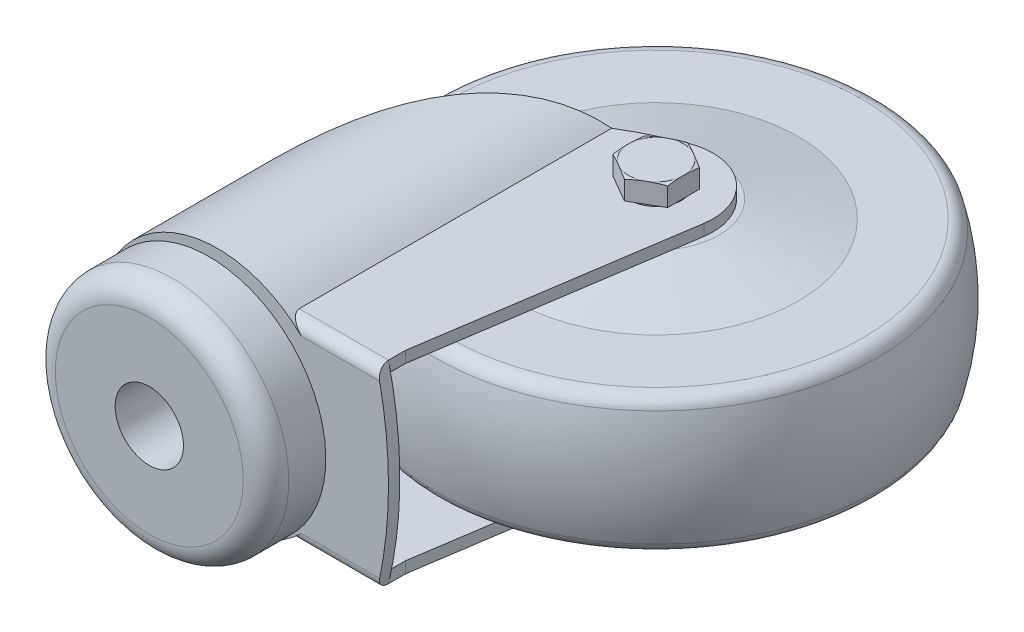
ISO-10303-21;
HEADER;
FILE_DESCRIPTION(('STEP AP214'),'2;1');
FILE_NAME('part.step','',(''),(''),'','','');
FILE_SCHEMA(('AUTOMOTIVE_DESIGN { 1 0 10303 214 1 1 1 1 }'));
ENDSEC;
DATA;
#1=APPLICATION_CONTEXT('core data for automotive mechanical design processes');
#2=APPLICATION_PROTOCOL_DEFINITION('international standard','automotive_design',2000,#1);
#3=PRODUCT_CONTEXT('',#1,'mechanical');
#4=PRODUCT('Part','Part','',(#3));
#5=PRODUCT_RELATED_PRODUCT_CATEGORY('part','',(#4));
#6=PRODUCT_DEFINITION_FORMATION('','',#4);
#7=PRODUCT_DEFINITION_CONTEXT('part definition',#1,'design');
#8=PRODUCT_DEFINITION('design','',#6,#7);
#9=PRODUCT_DEFINITION_SHAPE('','',#8);
#10=(LENGTH_UNIT() NAMED_UNIT(*) SI_UNIT(.MILLI.,.METRE.));
#11=(NAMED_UNIT(*) PLANE_ANGLE_UNIT() SI_UNIT($,.RADIAN.));
#12=(NAMED_UNIT(*) SI_UNIT($,.STERADIAN.) SOLID_ANGLE_UNIT());
#13=UNCERTAINTY_MEASURE_WITH_UNIT(LENGTH_MEASURE(1.E-05),#10,'distance_accuracy_value','');
#14=(GEOMETRIC_REPRESENTATION_CONTEXT(3) GLOBAL_UNCERTAINTY_ASSIGNED_CONTEXT((#13)) GLOBAL_UNIT_ASSIGNED_CONTEXT((#10,
#11,#12)) REPRESENTATION_CONTEXT('',''));
#15=CARTESIAN_POINT('',(0.,0.,0.));
#16=DIRECTION('',(0.,0.,1.));
#17=DIRECTION('',(1.,0.,0.));
#18=AXIS2_PLACEMENT_3D('',#15,#16,#17);
#19=CARTESIAN_POINT('',(25.0000000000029,-7.71048519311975E-13,-64.));
#20=DIRECTION('',(0.,-1.,0.));
#21=DIRECTION('',(-1.,0.,0.));
#22=AXIS2_PLACEMENT_3D('',#19,#20,#21);
#23=SPHERICAL_SURFACE('',#22,40.0000000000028);
#24=CARTESIAN_POINT('',(25.,-10.1333335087,-64.));
#25=DIRECTION('',(0.,-1.,0.));
#26=DIRECTION('',(1.,0.,0.));
#27=AXIS2_PLACEMENT_3D('',#24,#25,#26);
#28=CIRCLE('',#27,38.695161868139);
#29=CARTESIAN_POINT('',(-13.695161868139,-10.1333335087,-64.));
#30=VERTEX_POINT('',#29);
#31=EDGE_CURVE('E1259',#30,#30,#28,.T.);
#32=CARTESIAN_POINT('',(25.,10.1333335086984,-64.));
#33=DIRECTION('',(0.,-1.,0.));
#34=DIRECTION('',(1.,0.,0.));
#35=AXIS2_PLACEMENT_3D('',#32,#33,#34);
#36=CIRCLE('',#35,38.695161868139);
#37=CARTESIAN_POINT('',(-13.695161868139,10.1333335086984,-64.));
#38=VERTEX_POINT('',#37);
#39=EDGE_CURVE('E1256',#38,#38,#36,.T.);
#40=CARTESIAN_POINT('',(-13.695161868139,-10.1333335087,-64.));
#41=CARTESIAN_POINT('',(-13.7492327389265,-9.92685902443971,-64.));
#42=CARTESIAN_POINT('',(-13.8016507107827,-9.71995169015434,-64.));
#43=CARTESIAN_POINT('',(-13.9031680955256,-9.30532450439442,-64.));
#44=CARTESIAN_POINT('',(-13.9522675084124,-9.09760465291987,-64.));
#45=CARTESIAN_POINT('',(-14.0471350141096,-8.6814056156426,-64.));
#46=CARTESIAN_POINT('',(-14.0929031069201,-8.47292642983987,-64.));
#47=CARTESIAN_POINT('',(-14.18109629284,-8.05526215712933,-64.));
#48=CARTESIAN_POINT('',(-14.2235213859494,-7.84607707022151,-64.));
#49=CARTESIAN_POINT('',(-14.3050176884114,-7.42705459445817,-64.));
#50=CARTESIAN_POINT('',(-14.3440888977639,-7.21721720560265,-64.));
#51=CARTESIAN_POINT('',(-14.4188674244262,-6.79694389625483,-64.));
#52=CARTESIAN_POINT('',(-14.454574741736,-6.58650797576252,-64.));
#53=CARTESIAN_POINT('',(-14.5226163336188,-6.1650915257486,-64.));
#54=CARTESIAN_POINT('',(-14.5549506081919,-5.95411099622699,-64.));
#55=CARTESIAN_POINT('',(-14.6162378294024,-5.53165939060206,-64.));
#56=CARTESIAN_POINT('',(-14.6451907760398,-5.32018831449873,-64.));
#57=CARTESIAN_POINT('',(-14.6997079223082,-4.89680980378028,-64.));
#58=CARTESIAN_POINT('',(-14.7252721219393,-4.68490236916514,-64.));
#59=CARTESIAN_POINT('',(-14.7730052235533,-4.26070544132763,-64.));
#60=CARTESIAN_POINT('',(-14.7951741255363,-4.04841594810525,-64.));
#61=CARTESIAN_POINT('',(-14.8361109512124,-3.62350930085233,-64.));
#62=CARTESIAN_POINT('',(-14.8548788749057,-3.41089214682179,-64.));
#63=CARTESIAN_POINT('',(-14.8890089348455,-2.98538465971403,-64.));
#64=CARTESIAN_POINT('',(-14.9043710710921,-2.77249432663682,-64.));
#65=CARTESIAN_POINT('',(-14.9316856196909,-2.34649503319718,-64.));
#66=CARTESIAN_POINT('',(-14.9436380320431,-2.13338607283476,-64.));
#67=CARTESIAN_POINT('',(-14.9641300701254,-1.70700413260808,-64.));
#68=CARTESIAN_POINT('',(-14.9726696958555,-1.49373115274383,-64.));
#69=CARTESIAN_POINT('',(-14.9863339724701,-1.06707582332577,-64.));
#70=CARTESIAN_POINT('',(-14.9914586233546,-0.853693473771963,-64.));
#71=CARTESIAN_POINT('',(-14.9982916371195,-0.426874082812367,-64.));
#72=CARTESIAN_POINT('',(-15.,-0.213437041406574,-64.));
#73=CARTESIAN_POINT('',(-15.,0.213437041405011,-64.));
#74=CARTESIAN_POINT('',(-14.9982916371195,0.426874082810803,-64.));
#75=CARTESIAN_POINT('',(-14.9914586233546,0.853693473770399,-64.));
#76=CARTESIAN_POINT('',(-14.9863339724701,1.0670758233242,-64.));
#77=CARTESIAN_POINT('',(-14.9726696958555,1.49373115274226,-64.));
#78=CARTESIAN_POINT('',(-14.9641300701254,1.70700413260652,-64.));
#79=CARTESIAN_POINT('',(-14.9436380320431,2.1333860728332,-64.));
#80=CARTESIAN_POINT('',(-14.9316856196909,2.34649503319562,-64.));
#81=CARTESIAN_POINT('',(-14.9043710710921,2.77249432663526,-64.));
#82=CARTESIAN_POINT('',(-14.8890089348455,2.98538465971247,-64.));
#83=CARTESIAN_POINT('',(-14.8548788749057,3.41089214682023,-64.));
#84=CARTESIAN_POINT('',(-14.8361109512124,3.62350930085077,-64.));
#85=CARTESIAN_POINT('',(-14.7951741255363,4.04841594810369,-64.));
#86=CARTESIAN_POINT('',(-14.7730052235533,4.26070544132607,-64.));
#87=CARTESIAN_POINT('',(-14.7252721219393,4.68490236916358,-64.));
#88=CARTESIAN_POINT('',(-14.6997079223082,4.89680980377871,-64.));
#89=CARTESIAN_POINT('',(-14.6451907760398,5.32018831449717,-64.));
#90=CARTESIAN_POINT('',(-14.6162378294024,5.53165939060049,-64.));
#91=CARTESIAN_POINT('',(-14.5549506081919,5.95411099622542,-64.));
#92=CARTESIAN_POINT('',(-14.5226163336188,6.16509152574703,-64.));
#93=CARTESIAN_POINT('',(-14.454574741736,6.58650797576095,-64.));
#94=CARTESIAN_POINT('',(-14.4188674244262,6.79694389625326,-64.));
#95=CARTESIAN_POINT('',(-14.3440888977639,7.21721720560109,-64.));
#96=CARTESIAN_POINT('',(-14.3050176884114,7.4270545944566,-64.));
#97=CARTESIAN_POINT('',(-14.2235213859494,7.84607707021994,-64.));
#98=CARTESIAN_POINT('',(-14.18109629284,8.05526215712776,-64.));
#99=CARTESIAN_POINT('',(-14.0929031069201,8.47292642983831,-64.));
#100=CARTESIAN_POINT('',(-14.0471350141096,8.68140561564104,-64.));
#101=CARTESIAN_POINT('',(-13.9522675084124,9.09760465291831,-64.));
#102=CARTESIAN_POINT('',(-13.9031680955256,9.30532450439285,-64.));
#103=CARTESIAN_POINT('',(-13.8016507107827,9.71995169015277,-64.));
#104=CARTESIAN_POINT('',(-13.7492327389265,9.92685902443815,-64.));
#105=CARTESIAN_POINT('',(-13.695161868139,10.1333335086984,-64.));
#106=B_SPLINE_CURVE_WITH_KNOTS('',3,(#40,#41,#42,#43,#44,#45,#46,#47,#48,#49,#50,#51,#52,#53,
#54,#55,#56,#57,#58,#59,#60,#61,#62,#63,#64,#65,#66,#67,#68,#69,#70,#71,#72,#73,#74,#75,#76,#77,
#78,#79,#80,#81,#82,#83,#84,#85,#86,#87,#88,#89,#90,#91,#92,#93,#94,#95,#96,#97,#98,#99,#100,
#101,#102,#103,#104,#105),.UNSPECIFIED.,.F.,.F.,(4,2,2,2,2,2,2,2,2,2,2,2,2,2,2,2,2,2,2,2,2,2,2,
2,2,2,2,2,2,2,2,2,4),(0.,0.640304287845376,1.28060857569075,1.92091286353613,2.56121715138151,
3.20152143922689,3.84182572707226,4.48213001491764,5.12243430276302,5.7627385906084,
6.40304287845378,7.04334716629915,7.68365145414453,8.32395574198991,8.96426002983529,
9.60456431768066,10.244868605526,10.8851728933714,11.5254771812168,12.1657814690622,
12.8060857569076,13.4463900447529,14.0866943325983,14.7269986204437,15.3673029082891,
16.0076071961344,16.6479114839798,17.2882157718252,17.9285200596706,18.5688243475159,
19.2091286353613,19.8494329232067,20.4897372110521),.UNSPECIFIED.);
#107=EDGE_CURVE('BSEAM14',#30,#38,#106,.T.);
#108=ORIENTED_EDGE('',*,*,#31,.F.);
#109=ORIENTED_EDGE('',*,*,#39,.T.);
#110=ORIENTED_EDGE('',*,*,#107,.T.);
#111=ORIENTED_EDGE('',*,*,#107,.F.);
#112=EDGE_LOOP('',(#108,#110,#109,#111));
#113=FACE_BOUND('',#112,.T.);
#114=ADVANCED_FACE('F14',(#113),#23,.T.);
#115=CARTESIAN_POINT('',(25.,9.49999999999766,-64.));
#116=DIRECTION('',(0.,-1.,0.));
#117=DIRECTION('',(1.,0.,0.));
#118=AXIS2_PLACEMENT_3D('',#115,#116,#117);
#119=TOROIDAL_SURFACE('',#118,36.2767142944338,2.50000000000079);
#120=ORIENTED_EDGE('',*,*,#39,.F.);
#121=EDGE_LOOP('',(#120));
#122=FACE_BOUND('',#121,.T.);
#123=CARTESIAN_POINT('',(25.,11.9999999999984,-64.));
#124=DIRECTION('',(0.,-1.,0.));
#125=DIRECTION('',(1.,0.,0.));
#126=AXIS2_PLACEMENT_3D('',#123,#124,#125);
#127=CIRCLE('',#126,36.276714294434);
#128=CARTESIAN_POINT('',(61.276714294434,11.9999999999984,-64.));
#129=VERTEX_POINT('',#128);
#130=EDGE_CURVE('E1253',#129,#129,#127,.T.);
#131=ORIENTED_EDGE('',*,*,#130,.T.);
#132=EDGE_LOOP('',(#131));
#133=FACE_BOUND('',#132,.T.);
#134=ADVANCED_FACE('F745',(#122,#133),#119,.T.);
#135=CARTESIAN_POINT('',(14.,15.,-64.));
#136=DIRECTION('',(0.,-1.,0.));
#137=DIRECTION('',(1.,0.,0.));
#138=AXIS2_PLACEMENT_3D('',#135,#136,#137);
#139=PLANE('',#138);
#140=CARTESIAN_POINT('',(25.,15.,-64.));
#141=DIRECTION('',(0.,-1.,0.));
#142=DIRECTION('',(1.,0.,0.));
#143=AXIS2_PLACEMENT_3D('',#140,#141,#142);
#144=CIRCLE('',#143,11.);
#145=CARTESIAN_POINT('',(16.7569466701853,15.,-71.283685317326));
#146=VERTEX_POINT('',#145);
#147=CARTESIAN_POINT('',(34.2015773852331,15.,-57.9724819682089));
#148=VERTEX_POINT('',#147);
#149=EDGE_CURVE('E1244',#146,#148,#144,.T.);
#150=ORIENTED_EDGE('',*,*,#149,.F.);
#151=CARTESIAN_POINT('',(44.3097654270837,15.,-15.0510739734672));
#152=DIRECTION('',(0.,-1.,0.));
#153=DIRECTION('',(1.,0.,0.));
#154=AXIS2_PLACEMENT_3D('',#151,#152,#153);
#155=CIRCLE('',#154,62.62);
#156=CARTESIAN_POINT('',(21.3303372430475,15.,-73.3023424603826));
#157=VERTEX_POINT('',#156);
#158=EDGE_CURVE('E9',#146,#157,#155,.T.);
#159=ORIENTED_EDGE('',*,*,#158,.T.);
#160=CARTESIAN_POINT('',(25.,15.,-64.));
#161=DIRECTION('',(0.,-1.,0.));
#162=DIRECTION('',(1.,0.,0.));
#163=AXIS2_PLACEMENT_3D('',#160,#161,#162);
#164=CIRCLE('',#163,10.);
#165=CARTESIAN_POINT('',(34.8873827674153,15.,-62.5034499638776));
#166=VERTEX_POINT('',#165);
#167=EDGE_CURVE('E30',#157,#166,#164,.T.);
#168=ORIENTED_EDGE('',*,*,#167,.T.);
#169=DIRECTION('',(-0.149655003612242,0.,0.988738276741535));
#170=VECTOR('',#169,1.);
#171=CARTESIAN_POINT('',(34.6410199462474,15.,-60.8757840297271));
#172=LINE('',#171,#170);
#173=EDGE_CURVE('E265',#166,#148,#172,.T.);
#174=ORIENTED_EDGE('',*,*,#173,.T.);
#175=EDGE_LOOP('',(#150,#159,#168,#174));
#176=FACE_BOUND('',#175,.T.);
#177=ADVANCED_FACE('F442',(#176),#139,.F.);
#178=CARTESIAN_POINT('',(-11.276714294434,12.0000000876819,-64.));
#179=DIRECTION('',(0.,-1.,0.));
#180=DIRECTION('',(1.,0.,0.));
#181=AXIS2_PLACEMENT_3D('',#178,#179,#180);
#182=PLANE('',#181);
#183=ORIENTED_EDGE('',*,*,#130,.F.);
#184=EDGE_LOOP('',(#183));
#185=FACE_BOUND('',#184,.T.);
#186=CARTESIAN_POINT('',(25.,12.0000001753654,-64.));
#187=DIRECTION('',(0.,-1.,0.));
#188=DIRECTION('',(1.,0.,0.));
#189=AXIS2_PLACEMENT_3D('',#186,#187,#188);
#190=CIRCLE('',#189,25.);
#191=CARTESIAN_POINT('',(50.,12.0000001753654,-64.));
#192=VERTEX_POINT('',#191);
#193=EDGE_CURVE('E1248',#192,#192,#190,.T.);
#194=ORIENTED_EDGE('',*,*,#193,.T.);
#195=EDGE_LOOP('',(#194));
#196=FACE_BOUND('',#195,.T.);
#197=ADVANCED_FACE('F1225',(#185,#196),#182,.F.);
#198=CARTESIAN_POINT('',(25.,15.,-64.));
#199=DIRECTION('',(0.,-1.,0.));
#200=DIRECTION('',(1.,0.,0.));
#201=AXIS2_PLACEMENT_3D('',#198,#199,#200);
#202=CONICAL_SURFACE('',#201,11.,1.35970300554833);
#203=ORIENTED_EDGE('',*,*,#193,.F.);
#204=EDGE_LOOP('',(#203));
#205=FACE_BOUND('',#204,.T.);
#206=EDGE_CURVE('E1246',#148,#146,#144,.T.);
#207=ORIENTED_EDGE('',*,*,#206,.T.);
#208=ORIENTED_EDGE('',*,*,#149,.T.);
#209=EDGE_LOOP('',(#207,#208));
#210=FACE_BOUND('',#209,.T.);
#211=ADVANCED_FACE('F762',(#205,#210),#202,.T.);
#212=CARTESIAN_POINT('',(25.,-9.49999999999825,-64.));
#213=DIRECTION('',(0.,-1.,0.));
#214=DIRECTION('',(1.,0.,0.));
#215=AXIS2_PLACEMENT_3D('',#212,#213,#214);
#216=TOROIDAL_SURFACE('',#215,36.276714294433,2.50000000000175);
#217=CARTESIAN_POINT('',(25.,-12.,-64.));
#218=DIRECTION('',(0.,-1.,0.));
#219=DIRECTION('',(1.,0.,0.));
#220=AXIS2_PLACEMENT_3D('',#217,#218,#219);
#221=CIRCLE('',#220,36.276714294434);
#222=CARTESIAN_POINT('',(61.276714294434,-12.,-64.));
#223=VERTEX_POINT('',#222);
#224=EDGE_CURVE('E1262',#223,#223,#221,.T.);
#225=ORIENTED_EDGE('',*,*,#224,.F.);
#226=EDGE_LOOP('',(#225));
#227=FACE_BOUND('',#226,.T.);
#228=ORIENTED_EDGE('',*,*,#31,.T.);
#229=EDGE_LOOP('',(#228));
#230=FACE_BOUND('',#229,.T.);
#231=ADVANCED_FACE('F758',(#227,#230),#216,.T.);
#232=CARTESIAN_POINT('',(-11.276714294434,-12.0000000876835,-64.));
#233=DIRECTION('',(0.,1.,0.));
#234=DIRECTION('',(-1.,0.,0.));
#235=AXIS2_PLACEMENT_3D('',#232,#233,#234);
#236=PLANE('',#235);
#237=CARTESIAN_POINT('',(25.,-12.000000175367,-64.));
#238=DIRECTION('',(0.,-1.,0.));
#239=DIRECTION('',(1.,0.,0.));
#240=AXIS2_PLACEMENT_3D('',#237,#238,#239);
#241=CIRCLE('',#240,25.);
#242=CARTESIAN_POINT('',(50.,-12.000000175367,-64.));
#243=VERTEX_POINT('',#242);
#244=EDGE_CURVE('E1265',#243,#243,#241,.T.);
#245=ORIENTED_EDGE('',*,*,#244,.F.);
#246=EDGE_LOOP('',(#245));
#247=FACE_BOUND('',#246,.T.);
#248=ORIENTED_EDGE('',*,*,#224,.T.);
#249=EDGE_LOOP('',(#248));
#250=FACE_BOUND('',#249,.T.);
#251=ADVANCED_FACE('F761',(#247,#250),#236,.F.);
#252=CARTESIAN_POINT('',(14.,-15.0000000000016,-64.));
#253=DIRECTION('',(0.,1.,0.));
#254=DIRECTION('',(-1.,0.,0.));
#255=AXIS2_PLACEMENT_3D('',#252,#253,#254);
#256=PLANE('',#255);
#257=CARTESIAN_POINT('',(25.,-15.0000000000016,-64.));
#258=DIRECTION('',(0.,1.,0.));
#259=DIRECTION('',(-1.,0.,0.));
#260=AXIS2_PLACEMENT_3D('',#257,#258,#259);
#261=CIRCLE('',#260,10.);
#262=CARTESIAN_POINT('',(34.8873827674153,-15.0000000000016,-62.5034499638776));
#263=VERTEX_POINT('',#262);
#264=CARTESIAN_POINT('',(21.3303372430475,-15.0000000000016,-73.3023424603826));
#265=VERTEX_POINT('',#264);
#266=EDGE_CURVE('E282',#263,#265,#261,.T.);
#267=ORIENTED_EDGE('',*,*,#266,.T.);
#268=CARTESIAN_POINT('',(44.3097654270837,-15.0000000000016,-15.0510739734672));
#269=DIRECTION('',(0.,1.,0.));
#270=DIRECTION('',(-1.,0.,0.));
#271=AXIS2_PLACEMENT_3D('',#268,#269,#270);
#272=CIRCLE('',#271,62.62);
#273=CARTESIAN_POINT('',(16.7569466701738,-15.0000000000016,-71.283685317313));
#274=VERTEX_POINT('',#273);
#275=EDGE_CURVE('E286',#265,#274,#272,.T.);
#276=ORIENTED_EDGE('',*,*,#275,.T.);
#277=CARTESIAN_POINT('',(25.,-15.0000000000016,-64.));
#278=DIRECTION('',(0.,-1.,0.));
#279=DIRECTION('',(1.,0.,0.));
#280=AXIS2_PLACEMENT_3D('',#277,#278,#279);
#281=CIRCLE('',#280,11.);
#282=CARTESIAN_POINT('',(34.2015773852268,-15.0000000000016,-57.9724819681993));
#283=VERTEX_POINT('',#282);
#284=EDGE_CURVE('E1268',#274,#283,#281,.T.);
#285=ORIENTED_EDGE('',*,*,#284,.T.);
#286=DIRECTION('',(0.149655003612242,0.,-0.988738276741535));
#287=VECTOR('',#286,1.);
#288=CARTESIAN_POINT('',(34.6410199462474,-15.0000000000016,-60.8757840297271));
#289=LINE('',#288,#287);
#290=EDGE_CURVE('E289',#283,#263,#289,.T.);
#291=ORIENTED_EDGE('',*,*,#290,.T.);
#292=EDGE_LOOP('',(#267,#276,#285,#291));
#293=FACE_BOUND('',#292,.T.);
#294=ADVANCED_FACE('F284',(#293),#256,.F.);
#295=CARTESIAN_POINT('',(25.,-12.000000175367,-64.));
#296=DIRECTION('',(0.,1.,0.));
#297=DIRECTION('',(-1.,0.,0.));
#298=AXIS2_PLACEMENT_3D('',#295,#296,#297);
#299=CONICAL_SURFACE('',#298,25.,1.35970300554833);
#300=EDGE_CURVE('E1269',#283,#274,#281,.T.);
#301=ORIENTED_EDGE('',*,*,#300,.F.);
#302=ORIENTED_EDGE('',*,*,#284,.F.);
#303=EDGE_LOOP('',(#301,#302));
#304=FACE_BOUND('',#303,.T.);
#305=ORIENTED_EDGE('',*,*,#244,.T.);
#306=EDGE_LOOP('',(#305));
#307=FACE_BOUND('',#306,.T.);
#308=ADVANCED_FACE('F767',(#304,#307),#299,.T.);
#309=CARTESIAN_POINT('',(25.,-23.,-61.6135));
#310=DIRECTION('',(0.,-1.,0.));
#311=DIRECTION('',(1.,0.,0.));
#312=AXIS2_PLACEMENT_3D('',#309,#310,#311);
#313=PLANE('',#312);
#314=CARTESIAN_POINT('',(25.,-23.,-64.));
#315=DIRECTION('',(0.,-1.,0.));
#316=DIRECTION('',(1.,0.,0.));
#317=AXIS2_PLACEMENT_3D('',#314,#315,#316);
#318=CIRCLE('',#317,2.3865);
#319=CARTESIAN_POINT('',(27.3865,-23.,-64.));
#320=VERTEX_POINT('',#319);
#321=EDGE_CURVE('E649',#320,#320,#318,.T.);
#322=ORIENTED_EDGE('',*,*,#321,.T.);
#323=EDGE_LOOP('',(#322));
#324=FACE_BOUND('',#323,.T.);
#325=ADVANCED_FACE('F484',(#324),#313,.T.);
#326=CARTESIAN_POINT('',(25.,-23.,-64.));
#327=DIRECTION('',(0.,1.,0.));
#328=DIRECTION('',(-1.,0.,0.));
#329=AXIS2_PLACEMENT_3D('',#326,#327,#328);
#330=CONICAL_SURFACE('',#329,2.3865,0.785398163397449);
#331=CARTESIAN_POINT('',(25.,-22.3865,-64.));
#332=DIRECTION('',(0.,-1.,0.));
#333=DIRECTION('',(1.,0.,0.));
#334=AXIS2_PLACEMENT_3D('',#331,#332,#333);
#335=CIRCLE('',#334,3.);
#336=CARTESIAN_POINT('',(28.,-22.3865,-64.));
#337=VERTEX_POINT('',#336);
#338=EDGE_CURVE('E665',#337,#337,#335,.T.);
#339=ORIENTED_EDGE('',*,*,#338,.T.);
#340=EDGE_LOOP('',(#339));
#341=FACE_BOUND('',#340,.T.);
#342=ORIENTED_EDGE('',*,*,#321,.F.);
#343=EDGE_LOOP('',(#342));
#344=FACE_BOUND('',#343,.T.);
#345=ADVANCED_FACE('F792',(#341,#344),#330,.T.);
#346=CARTESIAN_POINT('',(25.,21.,-64.));
#347=DIRECTION('',(0.,1.,0.));
#348=DIRECTION('',(-1.,0.,0.));
#349=AXIS2_PLACEMENT_3D('',#346,#347,#348);
#350=PLANE('',#349);
#351=CARTESIAN_POINT('',(25.,21.,-64.));
#352=DIRECTION('',(0.,-1.,0.));
#353=DIRECTION('',(1.,0.,0.));
#354=AXIS2_PLACEMENT_3D('',#351,#352,#353);
#355=CIRCLE('',#354,4.8166666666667);
#356=CARTESIAN_POINT('',(29.816666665,21.0000000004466,-64.));
#357=VERTEX_POINT('',#356);
#358=CARTESIAN_POINT('',(27.4083333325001,21.0000000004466,-59.8286443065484));
#359=VERTEX_POINT('',#358);
#360=EDGE_CURVE('E675',#357,#359,#355,.T.);
#361=ORIENTED_EDGE('',*,*,#360,.F.);
#362=CARTESIAN_POINT('',(27.4083333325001,21.0000000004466,-68.1713556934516));
#363=VERTEX_POINT('',#362);
#364=EDGE_CURVE('E674',#363,#357,#355,.T.);
#365=ORIENTED_EDGE('',*,*,#364,.F.);
#366=CARTESIAN_POINT('',(22.5916666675,21.0000000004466,-68.1713556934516));
#367=VERTEX_POINT('',#366);
#368=EDGE_CURVE('E1493',#367,#363,#355,.T.);
#369=ORIENTED_EDGE('',*,*,#368,.F.);
#370=CARTESIAN_POINT('',(20.183333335,21.0000000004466,-64.));
#371=VERTEX_POINT('',#370);
#372=EDGE_CURVE('E1479',#371,#367,#355,.T.);
#373=ORIENTED_EDGE('',*,*,#372,.F.);
#374=CARTESIAN_POINT('',(22.5916666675,21.0000000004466,-59.8286443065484));
#375=VERTEX_POINT('',#374);
#376=EDGE_CURVE('E1505',#375,#371,#355,.T.);
#377=ORIENTED_EDGE('',*,*,#376,.F.);
#378=EDGE_CURVE('E679',#359,#375,#355,.T.);
#379=ORIENTED_EDGE('',*,*,#378,.F.);
#380=EDGE_LOOP('',(#361,#365,#369,#373,#377,#379));
#381=FACE_BOUND('',#380,.T.);
#382=ADVANCED_FACE('F801',(#381),#350,.T.);
#383=CARTESIAN_POINT('',(25.,-23.,-64.));
#384=DIRECTION('',(0.,-1.,0.));
#385=DIRECTION('',(1.,0.,0.));
#386=AXIS2_PLACEMENT_3D('',#383,#384,#385);
#387=CYLINDRICAL_SURFACE('',#386,3.);
#388=CARTESIAN_POINT('',(25.,-22.,-64.));
#389=DIRECTION('',(0.,-1.,0.));
#390=DIRECTION('',(1.,0.,0.));
#391=AXIS2_PLACEMENT_3D('',#388,#389,#390);
#392=CIRCLE('',#391,3.);
#393=CARTESIAN_POINT('',(28.,-22.,-64.));
#394=VERTEX_POINT('',#393);
#395=EDGE_CURVE('E404',#394,#394,#392,.F.);
#396=ORIENTED_EDGE('',*,*,#395,.F.);
#397=EDGE_LOOP('',(#396));
#398=FACE_BOUND('',#397,.T.);
#399=ORIENTED_EDGE('',*,*,#338,.F.);
#400=EDGE_LOOP('',(#399));
#401=FACE_BOUND('',#400,.T.);
#402=ADVANCED_FACE('F804',(#398,#401),#387,.T.);
#403=CARTESIAN_POINT('',(25.,20.741875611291,-64.));
#404=DIRECTION('',(0.,-1.,0.));
#405=DIRECTION('',(1.,0.,0.));
#406=AXIS2_PLACEMENT_3D('',#403,#404,#405);
#407=CONICAL_SURFACE('',#406,5.78,1.3089969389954);
#408=ORIENTED_EDGE('',*,*,#372,.T.);
#409=CARTESIAN_POINT('',(19.3837584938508,20.6624876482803,-66.3192690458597));
#410=CARTESIAN_POINT('',(19.5857618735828,20.7005656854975,-66.4358957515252));
#411=CARTESIAN_POINT('',(19.7880950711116,20.7364910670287,-66.5527128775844));
#412=CARTESIAN_POINT('',(20.193514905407,20.8028703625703,-66.7867821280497));
#413=CARTESIAN_POINT('',(20.3966018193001,20.8333220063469,-66.9040344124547));
#414=CARTESIAN_POINT('',(20.8034502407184,20.8875534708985,-67.1389284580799));
#415=CARTESIAN_POINT('',(21.0072117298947,20.9113334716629,-67.2565702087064));
#416=CARTESIAN_POINT('',(21.4152919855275,20.9509981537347,-67.492175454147));
#417=CARTESIAN_POINT('',(21.6196106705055,20.9668839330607,-67.6101389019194));
#418=CARTESIAN_POINT('',(22.0263590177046,20.9896554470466,-67.8449751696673));
#419=CARTESIAN_POINT('',(22.2287844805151,20.9966391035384,-67.9618455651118));
#420=CARTESIAN_POINT('',(22.6337233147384,21.0014529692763,-68.195637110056));
#421=CARTESIAN_POINT('',(22.836236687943,20.9992829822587,-68.3125582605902));
#422=CARTESIAN_POINT('',(23.2409450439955,20.98594393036,-68.5462167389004));
#423=CARTESIAN_POINT('',(23.4431401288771,20.974778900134,-68.6629541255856));
#424=CARTESIAN_POINT('',(23.8470554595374,20.9441824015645,-68.8961547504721));
#425=CARTESIAN_POINT('',(24.048775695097,20.9247507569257,-69.0126179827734));
#426=CARTESIAN_POINT('',(24.4495850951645,20.8789357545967,-69.2440253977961));
#427=CARTESIAN_POINT('',(24.6486804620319,20.8526235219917,-69.3589731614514));
#428=CARTESIAN_POINT('',(25.0462143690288,20.7941175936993,-69.5884894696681));
#429=CARTESIAN_POINT('',(25.2446529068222,20.7619238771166,-69.7030580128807));
#430=CARTESIAN_POINT('',(25.6410368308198,20.6927199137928,-69.9319103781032));
#431=CARTESIAN_POINT('',(25.8389817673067,20.6557062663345,-70.0461939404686));
#432=CARTESIAN_POINT('',(26.2343025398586,20.5778200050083,-70.2744324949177));
#433=CARTESIAN_POINT('',(26.4316783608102,20.5369472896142,-70.3883874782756));
#434=CARTESIAN_POINT('',(26.8284282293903,20.4515772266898,-70.6174511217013));
#435=CARTESIAN_POINT('',(27.0277958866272,20.4070404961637,-70.7325560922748));
#436=CARTESIAN_POINT('',(27.4260949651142,20.315436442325,-70.9625141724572));
#437=CARTESIAN_POINT('',(27.6250263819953,20.2683690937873,-71.0773672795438));
#438=CARTESIAN_POINT('',(28.0221581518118,20.1722951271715,-71.3066514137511));
#439=CARTESIAN_POINT('',(28.2203591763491,20.1232921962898,-71.4210828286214));
#440=CARTESIAN_POINT('',(28.6164402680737,20.0236383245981,-71.6497603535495));
#441=CARTESIAN_POINT('',(28.8143203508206,19.9729874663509,-71.7640064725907));
#442=CARTESIAN_POINT('',(29.0120733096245,19.9216958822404,-71.8781791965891));
#443=B_SPLINE_CURVE_WITH_KNOTS('',3,(#409,#410,#411,#412,#413,#414,#415,#416,#417,#418,#419,
#420,#421,#422,#423,#424,#425,#426,#427,#428,#429,#430,#431,#432,#433,#434,#435,#436,#437,#438,
#439,#440,#441,#442),.UNSPECIFIED.,.F.,.F.,(4,2,2,2,2,2,2,2,2,2,2,2,2,2,2,2,4),(0.,
0.709056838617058,1.41840708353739,2.12773818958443,2.83697060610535,3.53833229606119,
4.23970902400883,4.94077133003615,5.64184858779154,6.33594709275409,7.03004806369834,
7.72464144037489,8.41925309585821,9.12267089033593,9.82609569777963,10.5282396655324,
11.2303485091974),.UNSPECIFIED.);
#444=CARTESIAN_POINT('',(20.183333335,20.8003400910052,-66.7809037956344));
#445=VERTEX_POINT('',#444);
#446=EDGE_CURVE('E640',#445,#367,#443,.T.);
#447=ORIENTED_EDGE('',*,*,#446,.F.);
#448=CARTESIAN_POINT('',(20.183333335,19.9345176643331,-71.3565171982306));
#449=CARTESIAN_POINT('',(20.183333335,19.9834903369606,-71.1379988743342));
#450=CARTESIAN_POINT('',(20.183333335,20.0318640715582,-70.9193438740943));
#451=CARTESIAN_POINT('',(20.183333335,20.1270903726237,-70.4816933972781));
#452=CARTESIAN_POINT('',(20.183333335,20.1739428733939,-70.2626979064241));
#453=CARTESIAN_POINT('',(20.183333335,20.2658441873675,-69.8241031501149));
#454=CARTESIAN_POINT('',(20.183333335,20.3108911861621,-69.6045035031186));
#455=CARTESIAN_POINT('',(20.183333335,20.3986952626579,-69.1648471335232));
#456=CARTESIAN_POINT('',(20.183333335,20.4414523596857,-68.944790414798));
#457=CARTESIAN_POINT('',(20.183333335,20.523801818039,-68.5058954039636));
#458=CARTESIAN_POINT('',(20.183333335,20.5634166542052,-68.2870613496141));
#459=CARTESIAN_POINT('',(20.183333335,20.6391877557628,-67.8487963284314));
#460=CARTESIAN_POINT('',(20.183333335,20.6753440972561,-67.6293653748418));
#461=CARTESIAN_POINT('',(20.183333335,20.7433841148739,-67.1898639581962));
#462=CARTESIAN_POINT('',(20.183333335,20.7752683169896,-66.9697935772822));
#463=CARTESIAN_POINT('',(20.183333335,20.8338244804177,-66.528952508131));
#464=CARTESIAN_POINT('',(20.183333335,20.8604964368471,-66.3081818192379));
#465=CARTESIAN_POINT('',(20.183333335,20.9078728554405,-65.8634494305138));
#466=CARTESIAN_POINT('',(20.183333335,20.9285059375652,-65.6394800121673));
#467=CARTESIAN_POINT('',(20.183333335,20.962381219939,-65.1909781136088));
#468=CARTESIAN_POINT('',(20.183333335,20.9756235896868,-64.9664456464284));
#469=CARTESIAN_POINT('',(20.183333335,20.9939451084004,-64.5171433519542));
#470=CARTESIAN_POINT('',(20.183333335,20.9990279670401,-64.2923736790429));
#471=CARTESIAN_POINT('',(20.183333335,21.0007179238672,-63.8428020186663));
#472=CARTESIAN_POINT('',(20.183333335,20.9973250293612,-63.6180000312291));
#473=CARTESIAN_POINT('',(20.183333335,20.9822544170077,-63.1678615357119));
#474=CARTESIAN_POINT('',(20.183333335,20.9705466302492,-62.9425260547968));
#475=CARTESIAN_POINT('',(20.183333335,20.9395140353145,-62.492385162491));
#476=CARTESIAN_POINT('',(20.183333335,20.9201890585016,-62.2675797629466));
#477=CARTESIAN_POINT('',(20.183333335,20.8749001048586,-61.818500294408));
#478=CARTESIAN_POINT('',(20.183333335,20.8489317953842,-61.5942266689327));
#479=CARTESIAN_POINT('',(20.183333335,20.7914297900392,-61.1464030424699));
#480=CARTESIAN_POINT('',(20.183333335,20.7598960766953,-60.9228530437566));
#481=CARTESIAN_POINT('',(20.183333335,20.6629761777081,-60.2828076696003));
#482=CARTESIAN_POINT('',(20.183333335,20.5919542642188,-59.867169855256));
#483=CARTESIAN_POINT('',(20.183333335,20.4393911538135,-59.0378298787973));
#484=CARTESIAN_POINT('',(20.183333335,20.3578486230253,-58.6241279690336));
#485=CARTESIAN_POINT('',(20.183333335,20.1877009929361,-57.798085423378));
#486=CARTESIAN_POINT('',(20.183333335,20.0990941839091,-57.3857451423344));
#487=CARTESIAN_POINT('',(20.183333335,19.9170749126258,-56.5621603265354));
#488=CARTESIAN_POINT('',(20.183333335,19.8236627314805,-56.1509157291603));
#489=CARTESIAN_POINT('',(20.183333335,19.6343958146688,-55.3332483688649));
#490=CARTESIAN_POINT('',(20.183333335,19.5385741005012,-54.926817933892));
#491=CARTESIAN_POINT('',(20.183333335,19.3445311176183,-54.1145240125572));
#492=CARTESIAN_POINT('',(20.183333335,19.2463098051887,-53.7086605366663));
#493=CARTESIAN_POINT('',(20.183333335,19.048217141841,-52.8978680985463));
#494=CARTESIAN_POINT('',(20.183333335,18.9483479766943,-52.4929386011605));
#495=CARTESIAN_POINT('',(20.183333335,18.7472459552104,-51.6834323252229));
#496=CARTESIAN_POINT('',(20.183333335,18.6460131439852,-51.2788555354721));
#497=CARTESIAN_POINT('',(20.183333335,18.544297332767,-50.8744016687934));
#498=B_SPLINE_CURVE_WITH_KNOTS('',3,(#448,#449,#450,#451,#452,#453,#454,#455,#456,#457,#458,
#459,#460,#461,#462,#463,#464,#465,#466,#467,#468,#469,#470,#471,#472,#473,#474,#475,#476,#477,
#478,#479,#480,#481,#482,#483,#484,#485,#486,#487,#488,#489,#490,#491,#492,#493,#494,#495,#496,
#497),.UNSPECIFIED.,.F.,.F.,(4,2,2,2,2,2,2,2,2,2,2,2,2,2,2,2,2,2,2,2,2,2,2,2,4),(0.,
0.671819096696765,1.3436671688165,2.01617428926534,2.68867573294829,3.35582604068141,
4.02296166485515,4.69001507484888,5.35706910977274,6.03171582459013,6.70634706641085,
7.38067150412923,8.05499536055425,8.73177025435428,9.40856013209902,10.0857925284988,
10.7630270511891,12.0277754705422,13.2926844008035,14.5579004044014,15.8230424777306,
17.0757526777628,18.3284857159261,19.5796728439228,20.8308186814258),.UNSPECIFIED.);
#499=EDGE_CURVE('E1460',#371,#445,#498,.F.);
#500=ORIENTED_EDGE('',*,*,#499,.F.);
#501=EDGE_LOOP('',(#408,#447,#500));
#502=FACE_BOUND('',#501,.T.);
#503=ADVANCED_FACE('F820',(#502),#407,.T.);
#504=ORIENTED_EDGE('',*,*,#376,.T.);
#505=CARTESIAN_POINT('',(20.183333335,20.8003400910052,-61.2190962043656));
#506=VERTEX_POINT('',#505);
#507=EDGE_CURVE('E1461',#506,#371,#498,.F.);
#508=ORIENTED_EDGE('',*,*,#507,.F.);
#509=CARTESIAN_POINT('',(26.9852538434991,20.4161565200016,-57.2920055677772));
#510=CARTESIAN_POINT('',(26.8094532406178,20.4555840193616,-57.3935040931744));
#511=CARTESIAN_POINT('',(26.6334713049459,20.4939661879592,-57.4951073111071));
#512=CARTESIAN_POINT('',(26.2810661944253,20.5680889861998,-57.6985684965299));
#513=CARTESIAN_POINT('',(26.104642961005,20.6038292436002,-57.8004264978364));
#514=CARTESIAN_POINT('',(25.7508961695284,20.6721890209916,-58.0046623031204));
#515=CARTESIAN_POINT('',(25.5735714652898,20.7048007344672,-58.1070407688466));
#516=CARTESIAN_POINT('',(25.2184267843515,20.7661088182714,-58.3120836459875));
#517=CARTESIAN_POINT('',(25.0406068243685,20.7948053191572,-58.414748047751));
#518=CARTESIAN_POINT('',(24.5108778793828,20.8731586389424,-58.720587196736));
#519=CARTESIAN_POINT('',(24.1581525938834,20.9159964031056,-58.9242332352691));
#520=CARTESIAN_POINT('',(23.6280859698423,20.9617969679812,-59.2302673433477));
#521=CARTESIAN_POINT('',(23.4513300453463,20.9739861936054,-59.3323174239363));
#522=CARTESIAN_POINT('',(23.0975617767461,20.9916639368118,-59.5365656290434));
#523=CARTESIAN_POINT('',(22.9205494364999,20.9971525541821,-59.6387637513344));
#524=CARTESIAN_POINT('',(22.5662914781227,21.0011398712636,-59.8432946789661));
#525=CARTESIAN_POINT('',(22.3890458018,20.9996316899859,-59.9456275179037));
#526=CARTESIAN_POINT('',(22.0347004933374,20.9896914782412,-60.1502088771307));
#527=CARTESIAN_POINT('',(21.8576008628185,20.9812593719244,-60.2524573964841));
#528=CARTESIAN_POINT('',(21.5035253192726,20.9578864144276,-60.4568830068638));
#529=CARTESIAN_POINT('',(21.3265497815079,20.9429381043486,-60.5590598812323));
#530=CARTESIAN_POINT('',(20.9730466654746,20.9072077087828,-60.7631550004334));
#531=CARTESIAN_POINT('',(20.7965190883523,20.8864256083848,-60.8650732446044));
#532=CARTESIAN_POINT('',(20.4417164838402,20.8395202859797,-61.0699186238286));
#533=CARTESIAN_POINT('',(20.2634479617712,20.8133321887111,-61.1728420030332));
#534=CARTESIAN_POINT('',(19.9074282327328,20.7566020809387,-61.3783900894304));
#535=CARTESIAN_POINT('',(19.7296770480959,20.7260598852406,-61.4810147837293));
#536=CARTESIAN_POINT('',(19.3750792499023,20.6614524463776,-61.6857419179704));
#537=CARTESIAN_POINT('',(19.1982314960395,20.6273954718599,-61.7878450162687));
#538=CARTESIAN_POINT('',(18.8450120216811,20.5563242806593,-61.9917763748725));
#539=CARTESIAN_POINT('',(18.6686402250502,20.519310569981,-62.0936046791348));
#540=CARTESIAN_POINT('',(18.4924673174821,20.4811243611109,-62.1953181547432));
#541=B_SPLINE_CURVE_WITH_KNOTS('',3,(#509,#510,#511,#512,#513,#514,#515,#516,#517,#518,#519,
#520,#521,#522,#523,#524,#525,#526,#527,#528,#529,#530,#531,#532,#533,#534,#535,#536,#537,#538,
#539,#540),.UNSPECIFIED.,.F.,.F.,(4,2,2,2,2,2,2,2,2,2,2,2,2,2,2,4),(0.,0.620377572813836,
1.24084239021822,1.86281721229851,2.48477128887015,3.71269945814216,4.32599908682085,
4.93928958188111,5.55318334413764,6.16708383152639,6.78168888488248,7.39629550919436,
8.01875808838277,8.64124715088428,9.26230379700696,9.88325438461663),.UNSPECIFIED.);
#542=EDGE_CURVE('E1453',#375,#506,#541,.T.);
#543=ORIENTED_EDGE('',*,*,#542,.F.);
#544=EDGE_LOOP('',(#504,#508,#543));
#545=FACE_BOUND('',#544,.T.);
#546=ADVANCED_FACE('F830',(#545),#407,.T.);
#547=ORIENTED_EDGE('',*,*,#378,.T.);
#548=CARTESIAN_POINT('',(25.,20.8003400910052,-58.4381924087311));
#549=VERTEX_POINT('',#548);
#550=EDGE_CURVE('E1455',#549,#375,#541,.T.);
#551=ORIENTED_EDGE('',*,*,#550,.F.);
#552=CARTESIAN_POINT('',(33.8284639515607,19.9217674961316,-63.5353084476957));
#553=CARTESIAN_POINT('',(33.6307106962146,19.9730585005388,-63.4211355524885));
#554=CARTESIAN_POINT('',(33.4328303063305,20.0237087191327,-63.3068892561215));
#555=CARTESIAN_POINT('',(33.0367485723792,20.1233611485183,-63.0782113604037));
#556=CARTESIAN_POINT('',(32.8385472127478,20.1723632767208,-62.9637797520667));
#557=CARTESIAN_POINT('',(32.4414146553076,20.2684354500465,-62.7344951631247));
#558=CARTESIAN_POINT('',(32.242482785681,20.3155018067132,-62.6196417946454));
#559=CARTESIAN_POINT('',(31.844182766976,20.4071036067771,-62.3896831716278));
#560=CARTESIAN_POINT('',(31.644814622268,20.4516390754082,-62.2745779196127));
#561=CARTESIAN_POINT('',(31.248063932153,20.5370062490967,-62.0455138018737));
#562=CARTESIAN_POINT('',(31.0506877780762,20.577877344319,-61.9315586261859));
#563=CARTESIAN_POINT('',(30.6553663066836,20.6557599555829,-61.7033196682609));
#564=CARTESIAN_POINT('',(30.4574210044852,20.6927715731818,-61.5890358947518));
#565=CARTESIAN_POINT('',(30.061036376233,20.7619709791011,-61.3601831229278));
#566=CARTESIAN_POINT('',(29.8625975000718,20.7941621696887,-61.2456143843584));
#567=CARTESIAN_POINT('',(29.4650629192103,20.8526624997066,-61.0160976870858));
#568=CARTESIAN_POINT('',(29.2659672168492,20.8789716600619,-60.9011497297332));
#569=CARTESIAN_POINT('',(28.8651573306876,20.9247799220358,-60.6697420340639));
#570=CARTESIAN_POINT('',(28.6634369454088,20.9442078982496,-60.5532787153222));
#571=CARTESIAN_POINT('',(28.2595214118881,20.9747966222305,-60.320077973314));
#572=CARTESIAN_POINT('',(28.0573262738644,20.9859575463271,-60.2033405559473));
#573=CARTESIAN_POINT('',(27.6526178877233,20.9992881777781,-59.9696820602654));
#574=CARTESIAN_POINT('',(27.4501045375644,21.0014538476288,-59.8527609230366));
#575=CARTESIAN_POINT('',(27.0451658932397,20.996631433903,-59.6189694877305));
#576=CARTESIAN_POINT('',(26.8427405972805,20.989643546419,-59.5020991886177));
#577=CARTESIAN_POINT('',(26.4359924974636,20.9668638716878,-59.267263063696));
#578=CARTESIAN_POINT('',(26.2316738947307,20.9509741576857,-59.1492996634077));
#579=CARTESIAN_POINT('',(25.823593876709,20.9113021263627,-58.913694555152));
#580=CARTESIAN_POINT('',(25.6198325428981,20.8875187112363,-58.7960528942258));
#581=CARTESIAN_POINT('',(25.212984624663,20.8332810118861,-58.5611591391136));
#582=CARTESIAN_POINT('',(25.0098980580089,20.802826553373,-58.443907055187));
#583=CARTESIAN_POINT('',(24.6044789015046,20.7364421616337,-58.2098381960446));
#584=CARTESIAN_POINT('',(24.402146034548,20.7005144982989,-58.0930212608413));
#585=CARTESIAN_POINT('',(24.2001429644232,20.6624344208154,-57.9763947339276));
#586=B_SPLINE_CURVE_WITH_KNOTS('',3,(#552,#553,#554,#555,#556,#557,#558,#559,#560,#561,#562,
#563,#564,#565,#566,#567,#568,#569,#570,#571,#572,#573,#574,#575,#576,#577,#578,#579,#580,#581,
#582,#583,#584,#585),.UNSPECIFIED.,.F.,.F.,(4,2,2,2,2,2,2,2,2,2,2,2,2,2,2,2,4),(0.,
0.70210946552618,1.4042540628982,2.10767980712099,2.81109853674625,3.5057104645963,
4.20030410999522,4.89440517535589,5.5885037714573,6.28958061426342,6.99064250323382,
7.69201902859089,8.39338052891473,9.1026134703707,9.81194508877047,10.5212952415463,
11.2303520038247),.UNSPECIFIED.);
#587=EDGE_CURVE('E615',#359,#549,#586,.T.);
#588=ORIENTED_EDGE('',*,*,#587,.F.);
#589=EDGE_LOOP('',(#547,#551,#588));
#590=FACE_BOUND('',#589,.T.);
#591=ADVANCED_FACE('F840',(#590),#407,.T.);
#592=CARTESIAN_POINT('',(29.816666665,20.8003400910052,-61.2190962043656));
#593=VERTEX_POINT('',#592);
#594=EDGE_CURVE('E1446',#593,#359,#586,.T.);
#595=ORIENTED_EDGE('',*,*,#594,.F.);
#596=CARTESIAN_POINT('',(29.816666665,19.9345176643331,-71.3565171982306));
#597=CARTESIAN_POINT('',(29.816666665,19.9834903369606,-71.1379988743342));
#598=CARTESIAN_POINT('',(29.816666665,20.0318640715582,-70.9193438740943));
#599=CARTESIAN_POINT('',(29.816666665,20.1270903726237,-70.4816933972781));
#600=CARTESIAN_POINT('',(29.816666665,20.1739428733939,-70.2626979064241));
#601=CARTESIAN_POINT('',(29.816666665,20.2658441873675,-69.8241031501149));
#602=CARTESIAN_POINT('',(29.816666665,20.3108911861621,-69.6045035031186));
#603=CARTESIAN_POINT('',(29.816666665,20.3986952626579,-69.1648471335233));
#604=CARTESIAN_POINT('',(29.816666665,20.4414523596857,-68.944790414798));
#605=CARTESIAN_POINT('',(29.816666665,20.523801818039,-68.5058954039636));
#606=CARTESIAN_POINT('',(29.816666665,20.5634166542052,-68.2870613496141));
#607=CARTESIAN_POINT('',(29.816666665,20.6391877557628,-67.8487963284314));
#608=CARTESIAN_POINT('',(29.816666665,20.6753440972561,-67.6293653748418));
#609=CARTESIAN_POINT('',(29.816666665,20.7433841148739,-67.1898639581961));
#610=CARTESIAN_POINT('',(29.816666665,20.7752683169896,-66.9697935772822));
#611=CARTESIAN_POINT('',(29.816666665,20.8338244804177,-66.528952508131));
#612=CARTESIAN_POINT('',(29.816666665,20.8604964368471,-66.3081818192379));
#613=CARTESIAN_POINT('',(29.816666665,20.9078728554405,-65.8634494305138));
#614=CARTESIAN_POINT('',(29.816666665,20.9285059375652,-65.6394800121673));
#615=CARTESIAN_POINT('',(29.816666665,20.962381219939,-65.1909781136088));
#616=CARTESIAN_POINT('',(29.816666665,20.9756235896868,-64.9664456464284));
#617=CARTESIAN_POINT('',(29.816666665,20.9939451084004,-64.5171433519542));
#618=CARTESIAN_POINT('',(29.816666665,20.9990279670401,-64.2923736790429));
#619=CARTESIAN_POINT('',(29.816666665,21.0007179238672,-63.8428020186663));
#620=CARTESIAN_POINT('',(29.816666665,20.9973250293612,-63.6180000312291));
#621=CARTESIAN_POINT('',(29.816666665,20.9822544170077,-63.1678615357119));
#622=CARTESIAN_POINT('',(29.816666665,20.9705466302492,-62.9425260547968));
#623=CARTESIAN_POINT('',(29.816666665,20.9395140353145,-62.492385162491));
#624=CARTESIAN_POINT('',(29.816666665,20.9201890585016,-62.2675797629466));
#625=CARTESIAN_POINT('',(29.816666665,20.8749001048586,-61.818500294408));
#626=CARTESIAN_POINT('',(29.816666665,20.8489317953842,-61.5942266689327));
#627=CARTESIAN_POINT('',(29.816666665,20.7914297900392,-61.1464030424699));
#628=CARTESIAN_POINT('',(29.816666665,20.7598960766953,-60.9228530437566));
#629=CARTESIAN_POINT('',(29.816666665,20.6629761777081,-60.2828076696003));
#630=CARTESIAN_POINT('',(29.816666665,20.5919542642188,-59.867169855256));
#631=CARTESIAN_POINT('',(29.816666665,20.4393911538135,-59.0378298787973));
#632=CARTESIAN_POINT('',(29.816666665,20.3578486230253,-58.6241279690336));
#633=CARTESIAN_POINT('',(29.816666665,20.1877009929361,-57.798085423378));
#634=CARTESIAN_POINT('',(29.816666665,20.0990941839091,-57.3857451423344));
#635=CARTESIAN_POINT('',(29.816666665,19.9170749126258,-56.5621603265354));
#636=CARTESIAN_POINT('',(29.816666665,19.8236627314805,-56.1509157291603));
#637=CARTESIAN_POINT('',(29.816666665,19.6343958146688,-55.3332483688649));
#638=CARTESIAN_POINT('',(29.816666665,19.5385741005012,-54.926817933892));
#639=CARTESIAN_POINT('',(29.816666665,19.3445311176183,-54.1145240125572));
#640=CARTESIAN_POINT('',(29.816666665,19.2463098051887,-53.7086605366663));
#641=CARTESIAN_POINT('',(29.816666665,19.048217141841,-52.8978680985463));
#642=CARTESIAN_POINT('',(29.816666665,18.9483479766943,-52.4929386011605));
#643=CARTESIAN_POINT('',(29.816666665,18.7472459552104,-51.6834323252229));
#644=CARTESIAN_POINT('',(29.816666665,18.6460131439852,-51.2788555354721));
#645=CARTESIAN_POINT('',(29.816666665,18.544297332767,-50.8744016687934));
#646=B_SPLINE_CURVE_WITH_KNOTS('',3,(#596,#597,#598,#599,#600,#601,#602,#603,#604,#605,#606,
#607,#608,#609,#610,#611,#612,#613,#614,#615,#616,#617,#618,#619,#620,#621,#622,#623,#624,#625,
#626,#627,#628,#629,#630,#631,#632,#633,#634,#635,#636,#637,#638,#639,#640,#641,#642,#643,#644,
#645),.UNSPECIFIED.,.F.,.F.,(4,2,2,2,2,2,2,2,2,2,2,2,2,2,2,2,2,2,2,2,2,2,2,2,4),(0.,
0.671819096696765,1.3436671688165,2.01617428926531,2.68867573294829,3.35582604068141,
4.02296166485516,4.6900150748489,5.35706910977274,6.03171582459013,6.70634706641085,
7.38067150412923,8.05499536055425,8.73177025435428,9.40856013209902,10.0857925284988,
10.7630270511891,12.0277754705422,13.2926844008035,14.5579004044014,15.8230424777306,
17.0757526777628,18.3284857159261,19.5796728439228,20.8308186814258),.UNSPECIFIED.);
#647=EDGE_CURVE('E616',#357,#593,#646,.T.);
#648=ORIENTED_EDGE('',*,*,#647,.F.);
#649=ORIENTED_EDGE('',*,*,#360,.T.);
#650=EDGE_LOOP('',(#595,#648,#649));
#651=FACE_BOUND('',#650,.T.);
#652=ADVANCED_FACE('F521',(#651),#407,.T.);
#653=ORIENTED_EDGE('',*,*,#364,.T.);
#654=CARTESIAN_POINT('',(29.816666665,20.8003400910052,-66.7809037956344));
#655=VERTEX_POINT('',#654);
#656=EDGE_CURVE('E609',#655,#357,#646,.T.);
#657=ORIENTED_EDGE('',*,*,#656,.F.);
#658=CARTESIAN_POINT('',(23.308745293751,20.4810400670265,-70.53825395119));
#659=CARTESIAN_POINT('',(23.4849170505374,20.5192278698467,-70.4365411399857));
#660=CARTESIAN_POINT('',(23.661287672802,20.5562433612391,-70.3347135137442));
#661=CARTESIAN_POINT('',(24.0145047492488,20.6273185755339,-70.1307835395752));
#662=CARTESIAN_POINT('',(24.1913512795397,20.661377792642,-70.0286811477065));
#663=CARTESIAN_POINT('',(24.5459466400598,20.725990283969,-69.8239554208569));
#664=CARTESIAN_POINT('',(24.7236966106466,20.7565352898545,-69.7213314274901));
#665=CARTESIAN_POINT('',(25.0797138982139,20.8132716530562,-69.515784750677));
#666=CARTESIAN_POINT('',(25.2579811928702,20.8394631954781,-69.4128620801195));
#667=CARTESIAN_POINT('',(25.6127813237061,20.8863760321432,-69.2080181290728));
#668=CARTESIAN_POINT('',(25.7893076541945,20.9071621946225,-69.1061006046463));
#669=CARTESIAN_POINT('',(26.1428083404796,20.9429013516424,-68.9020068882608));
#670=CARTESIAN_POINT('',(26.3197826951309,20.9578543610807,-68.7998306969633));
#671=CARTESIAN_POINT('',(26.6738559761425,20.9812372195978,-68.5954063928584));
#672=CARTESIAN_POINT('',(26.8509545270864,20.9896745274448,-68.4931584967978));
#673=CARTESIAN_POINT('',(27.2052978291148,20.9996254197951,-68.2885782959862));
#674=CARTESIAN_POINT('',(27.3825425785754,21.0011390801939,-68.1862459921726));
#675=CARTESIAN_POINT('',(27.736799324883,20.9971626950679,-67.9817157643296));
#676=CARTESIAN_POINT('',(27.9138113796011,20.9916795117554,-67.8795178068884));
#677=CARTESIAN_POINT('',(28.2675792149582,20.9740123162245,-67.6752698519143));
#678=CARTESIAN_POINT('',(28.4443349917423,20.9618282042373,-67.5732198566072));
#679=CARTESIAN_POINT('',(28.9744013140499,20.9160421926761,-67.2671859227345));
#680=CARTESIAN_POINT('',(29.3271265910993,20.8732130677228,-67.0635398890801));
#681=CARTESIAN_POINT('',(29.8568555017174,20.79487089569,-66.7577007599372));
#682=CARTESIAN_POINT('',(30.0346754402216,20.7661778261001,-66.6550363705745));
#683=CARTESIAN_POINT('',(30.3898200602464,20.704876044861,-66.449993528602));
#684=CARTESIAN_POINT('',(30.567144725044,20.6722672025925,-66.3476150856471));
#685=CARTESIAN_POINT('',(30.9208914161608,20.6039126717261,-66.1433793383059));
#686=CARTESIAN_POINT('',(31.0973145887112,20.5681747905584,-66.0415213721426));
#687=CARTESIAN_POINT('',(31.4497195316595,20.494056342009,-65.8380602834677));
#688=CARTESIAN_POINT('',(31.6257013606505,20.4556761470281,-65.7364571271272));
#689=CARTESIAN_POINT('',(31.8015018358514,20.416250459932,-65.6349586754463));
#690=B_SPLINE_CURVE_WITH_KNOTS('',3,(#658,#659,#660,#661,#662,#663,#664,#665,#666,#667,#668,
#669,#670,#671,#672,#673,#674,#675,#676,#677,#678,#679,#680,#681,#682,#683,#684,#685,#686,#687,
#688,#689),.UNSPECIFIED.,.F.,.F.,(4,2,2,2,2,2,2,2,2,2,2,2,2,2,2,4),(0.,0.620947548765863,
1.2420011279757,1.86448728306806,2.48694696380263,3.10155054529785,3.71615255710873,
4.33004996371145,4.94394064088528,5.55722970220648,6.17052789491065,7.39845317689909,
8.0204057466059,8.64237906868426,9.26284244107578,9.88321854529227),.UNSPECIFIED.);
#691=EDGE_CURVE('E639',#363,#655,#690,.T.);
#692=ORIENTED_EDGE('',*,*,#691,.F.);
#693=EDGE_LOOP('',(#653,#657,#692));
#694=FACE_BOUND('',#693,.T.);
#695=ADVANCED_FACE('F813',(#694),#407,.T.);
#696=ORIENTED_EDGE('',*,*,#368,.T.);
#697=CARTESIAN_POINT('',(25.,20.8003400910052,-69.5618075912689));
#698=VERTEX_POINT('',#697);
#699=EDGE_CURVE('E631',#698,#363,#690,.T.);
#700=ORIENTED_EDGE('',*,*,#699,.F.);
#701=EDGE_CURVE('E1466',#367,#698,#443,.T.);
#702=ORIENTED_EDGE('',*,*,#701,.F.);
#703=EDGE_LOOP('',(#696,#700,#702));
#704=FACE_BOUND('',#703,.T.);
#705=ADVANCED_FACE('F833',(#704),#407,.T.);
#706=CARTESIAN_POINT('',(25.,-22.,-59.18333333));
#707=DIRECTION('',(0.,-1.,0.));
#708=DIRECTION('',(1.,0.,0.));
#709=AXIS2_PLACEMENT_3D('',#706,#707,#708);
#710=PLANE('',#709);
#711=ORIENTED_EDGE('',*,*,#395,.T.);
#712=EDGE_LOOP('',(#711));
#713=FACE_BOUND('',#712,.T.);
#714=CARTESIAN_POINT('',(25.,-22.,-64.));
#715=DIRECTION('',(0.,-1.,0.));
#716=DIRECTION('',(1.,0.,0.));
#717=AXIS2_PLACEMENT_3D('',#714,#715,#716);
#718=CIRCLE('',#717,4.81666667);
#719=CARTESIAN_POINT('',(29.816666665,-22.,-64.));
#720=VERTEX_POINT('',#719);
#721=CARTESIAN_POINT('',(27.4083333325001,-22.,-59.8286443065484));
#722=VERTEX_POINT('',#721);
#723=EDGE_CURVE('E593',#720,#722,#718,.T.);
#724=ORIENTED_EDGE('',*,*,#723,.T.);
#725=CARTESIAN_POINT('',(22.5916666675,-22.,-59.8286443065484));
#726=VERTEX_POINT('',#725);
#727=EDGE_CURVE('E597',#722,#726,#718,.T.);
#728=ORIENTED_EDGE('',*,*,#727,.T.);
#729=CARTESIAN_POINT('',(20.183333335,-22.,-64.));
#730=VERTEX_POINT('',#729);
#731=EDGE_CURVE('E1327',#726,#730,#718,.T.);
#732=ORIENTED_EDGE('',*,*,#731,.T.);
#733=CARTESIAN_POINT('',(22.5916666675,-22.,-68.1713556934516));
#734=VERTEX_POINT('',#733);
#735=EDGE_CURVE('E1331',#730,#734,#718,.T.);
#736=ORIENTED_EDGE('',*,*,#735,.T.);
#737=CARTESIAN_POINT('',(27.4083333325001,-22.,-68.1713556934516));
#738=VERTEX_POINT('',#737);
#739=EDGE_CURVE('E1383',#734,#738,#718,.T.);
#740=ORIENTED_EDGE('',*,*,#739,.T.);
#741=EDGE_CURVE('E598',#738,#720,#718,.T.);
#742=ORIENTED_EDGE('',*,*,#741,.T.);
#743=EDGE_LOOP('',(#724,#728,#732,#736,#740,#742));
#744=FACE_BOUND('',#743,.T.);
#745=ADVANCED_FACE('F465',(#713,#744),#710,.T.);
#746=CARTESIAN_POINT('',(0.,0.,-12.));
#747=DIRECTION('',(0.,0.,-1.));
#748=DIRECTION('',(0.,-1.,0.));
#749=AXIS2_PLACEMENT_3D('',#746,#747,#748);
#750=CYLINDRICAL_SURFACE('',#749,20.5);
#751=CARTESIAN_POINT('',(0.,0.,-4.));
#752=DIRECTION('',(0.,0.,-1.));
#753=DIRECTION('',(0.,-1.,0.));
#754=AXIS2_PLACEMENT_3D('',#751,#752,#753);
#755=CIRCLE('',#754,20.5);
#756=CARTESIAN_POINT('',(0.,-20.5,-4.));
#757=VERTEX_POINT('',#756);
#758=EDGE_CURVE('E1293',#757,#757,#755,.T.);
#759=ORIENTED_EDGE('',*,*,#758,.T.);
#760=EDGE_LOOP('',(#759));
#761=FACE_BOUND('',#760,.T.);
#762=CARTESIAN_POINT('',(0.,0.,-10.5));
#763=DIRECTION('',(0.,0.,-1.));
#764=DIRECTION('',(0.,-1.,0.));
#765=AXIS2_PLACEMENT_3D('',#762,#763,#764);
#766=CIRCLE('',#765,20.5);
#767=CARTESIAN_POINT('',(0.,-20.5,-10.5));
#768=VERTEX_POINT('',#767);
#769=EDGE_CURVE('E1290',#768,#768,#766,.T.);
#770=ORIENTED_EDGE('',*,*,#769,.F.);
#771=EDGE_LOOP('',(#770));
#772=FACE_BOUND('',#771,.T.);
#773=ADVANCED_FACE('F461',(#761,#772),#750,.T.);
#774=CARTESIAN_POINT('',(25.,-23.001,-69.5618075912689));
#775=DIRECTION('',(-0.500000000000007,0.,-0.866025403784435));
#776=DIRECTION('',(-0.866025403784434,0.,0.500000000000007));
#777=AXIS2_PLACEMENT_3D('',#774,#775,#776);
#778=PLANE('',#777);
#779=DIRECTION('',(-0.866025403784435,0.,0.500000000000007));
#780=VECTOR('',#779,1.);
#781=CARTESIAN_POINT('',(25.,17.5,-69.5618075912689));
#782=LINE('',#781,#780);
#783=CARTESIAN_POINT('',(25.,17.5,-69.5618075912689));
#784=VERTEX_POINT('',#783);
#785=CARTESIAN_POINT('',(20.183333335,17.5,-66.7809037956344));
#786=VERTEX_POINT('',#785);
#787=EDGE_CURVE('E1477',#784,#786,#782,.T.);
#788=ORIENTED_EDGE('',*,*,#787,.T.);
#789=DIRECTION('',(0.,1.,0.));
#790=VECTOR('',#789,1.);
#791=CARTESIAN_POINT('',(20.183333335,-23.001,-66.7809037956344));
#792=LINE('',#791,#790);
#793=EDGE_CURVE('E653',#786,#445,#792,.T.);
#794=ORIENTED_EDGE('',*,*,#793,.T.);
#795=ORIENTED_EDGE('',*,*,#446,.T.);
#796=ORIENTED_EDGE('',*,*,#701,.T.);
#797=DIRECTION('',(0.,1.,0.));
#798=VECTOR('',#797,1.);
#799=CARTESIAN_POINT('',(25.,-23.001,-69.5618075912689));
#800=LINE('',#799,#798);
#801=EDGE_CURVE('E656',#784,#698,#800,.T.);
#802=ORIENTED_EDGE('',*,*,#801,.F.);
#803=EDGE_LOOP('',(#788,#794,#795,#796,#802));
#804=FACE_BOUND('',#803,.T.);
#805=ADVANCED_FACE('F464',(#804),#778,.T.);
#806=CARTESIAN_POINT('',(20.183333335,-23.001,-66.7809037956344));
#807=DIRECTION('',(-1.,0.,0.));
#808=DIRECTION('',(0.,-1.,0.));
#809=AXIS2_PLACEMENT_3D('',#806,#807,#808);
#810=PLANE('',#809);
#811=DIRECTION('',(0.,0.,1.));
#812=VECTOR('',#811,1.);
#813=CARTESIAN_POINT('',(20.183333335,17.5,-66.7809037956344));
#814=LINE('',#813,#812);
#815=CARTESIAN_POINT('',(20.183333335,17.5,-61.2190962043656));
#816=VERTEX_POINT('',#815);
#817=EDGE_CURVE('E1498',#786,#816,#814,.T.);
#818=ORIENTED_EDGE('',*,*,#817,.T.);
#819=DIRECTION('',(0.,1.,0.));
#820=VECTOR('',#819,1.);
#821=CARTESIAN_POINT('',(20.183333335,-23.001,-61.2190962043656));
#822=LINE('',#821,#820);
#823=EDGE_CURVE('E650',#816,#506,#822,.T.);
#824=ORIENTED_EDGE('',*,*,#823,.T.);
#825=ORIENTED_EDGE('',*,*,#507,.T.);
#826=ORIENTED_EDGE('',*,*,#499,.T.);
#827=ORIENTED_EDGE('',*,*,#793,.F.);
#828=EDGE_LOOP('',(#818,#824,#825,#826,#827));
#829=FACE_BOUND('',#828,.T.);
#830=ADVANCED_FACE('F891',(#829),#810,.T.);
#831=CARTESIAN_POINT('',(20.183333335,-23.001,-61.2190962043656));
#832=DIRECTION('',(-0.500000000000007,0.,0.866025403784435));
#833=DIRECTION('',(0.866025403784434,0.,0.500000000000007));
#834=AXIS2_PLACEMENT_3D('',#831,#832,#833);
#835=PLANE('',#834);
#836=DIRECTION('',(0.866025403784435,0.,0.500000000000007));
#837=VECTOR('',#836,1.);
#838=CARTESIAN_POINT('',(20.183333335,17.5,-61.2190962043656));
#839=LINE('',#838,#837);
#840=CARTESIAN_POINT('',(25.,17.5,-58.4381924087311));
#841=VERTEX_POINT('',#840);
#842=EDGE_CURVE('E602',#816,#841,#839,.T.);
#843=ORIENTED_EDGE('',*,*,#842,.T.);
#844=DIRECTION('',(0.,1.,0.));
#845=VECTOR('',#844,1.);
#846=CARTESIAN_POINT('',(25.,-23.001,-58.4381924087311));
#847=LINE('',#846,#845);
#848=EDGE_CURVE('E646',#841,#549,#847,.T.);
#849=ORIENTED_EDGE('',*,*,#848,.T.);
#850=ORIENTED_EDGE('',*,*,#550,.T.);
#851=ORIENTED_EDGE('',*,*,#542,.T.);
#852=ORIENTED_EDGE('',*,*,#823,.F.);
#853=EDGE_LOOP('',(#843,#849,#850,#851,#852));
#854=FACE_BOUND('',#853,.T.);
#855=ADVANCED_FACE('F899',(#854),#835,.T.);
#856=CARTESIAN_POINT('',(25.,-23.001,-58.4381924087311));
#857=DIRECTION('',(0.500000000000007,0.,0.866025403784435));
#858=DIRECTION('',(0.866025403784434,0.,-0.500000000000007));
#859=AXIS2_PLACEMENT_3D('',#856,#857,#858);
#860=PLANE('',#859);
#861=DIRECTION('',(0.866025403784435,0.,-0.500000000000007));
#862=VECTOR('',#861,1.);
#863=CARTESIAN_POINT('',(25.,17.5,-58.4381924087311));
#864=LINE('',#863,#862);
#865=CARTESIAN_POINT('',(29.816666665,17.5,-61.2190962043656));
#866=VERTEX_POINT('',#865);
#867=EDGE_CURVE('E608',#841,#866,#864,.T.);
#868=ORIENTED_EDGE('',*,*,#867,.T.);
#869=DIRECTION('',(0.,1.,0.));
#870=VECTOR('',#869,1.);
#871=CARTESIAN_POINT('',(29.816666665,-23.001,-61.2190962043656));
#872=LINE('',#871,#870);
#873=EDGE_CURVE('E638',#866,#593,#872,.T.);
#874=ORIENTED_EDGE('',*,*,#873,.T.);
#875=ORIENTED_EDGE('',*,*,#594,.T.);
#876=ORIENTED_EDGE('',*,*,#587,.T.);
#877=ORIENTED_EDGE('',*,*,#848,.F.);
#878=EDGE_LOOP('',(#868,#874,#875,#876,#877));
#879=FACE_BOUND('',#878,.T.);
#880=ADVANCED_FACE('F622',(#879),#860,.T.);
#881=CARTESIAN_POINT('',(29.816666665,-23.001,-61.2190962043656));
#882=DIRECTION('',(1.,0.,0.));
#883=DIRECTION('',(0.,1.,0.));
#884=AXIS2_PLACEMENT_3D('',#881,#882,#883);
#885=PLANE('',#884);
#886=DIRECTION('',(0.,0.,-1.));
#887=VECTOR('',#886,1.);
#888=CARTESIAN_POINT('',(29.816666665,17.5,-61.2190962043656));
#889=LINE('',#888,#887);
#890=CARTESIAN_POINT('',(29.816666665,17.5,-66.7809037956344));
#891=VERTEX_POINT('',#890);
#892=EDGE_CURVE('E604',#866,#891,#889,.T.);
#893=ORIENTED_EDGE('',*,*,#892,.T.);
#894=DIRECTION('',(0.,1.,0.));
#895=VECTOR('',#894,1.);
#896=CARTESIAN_POINT('',(29.816666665,-23.001,-66.7809037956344));
#897=LINE('',#896,#895);
#898=EDGE_CURVE('E659',#891,#655,#897,.T.);
#899=ORIENTED_EDGE('',*,*,#898,.T.);
#900=ORIENTED_EDGE('',*,*,#656,.T.);
#901=ORIENTED_EDGE('',*,*,#647,.T.);
#902=ORIENTED_EDGE('',*,*,#873,.F.);
#903=EDGE_LOOP('',(#893,#899,#900,#901,#902));
#904=FACE_BOUND('',#903,.T.);
#905=ADVANCED_FACE('F618',(#904),#885,.T.);
#906=CARTESIAN_POINT('',(29.816666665,-23.001,-66.7809037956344));
#907=DIRECTION('',(0.500000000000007,0.,-0.866025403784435));
#908=DIRECTION('',(-0.866025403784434,0.,-0.500000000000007));
#909=AXIS2_PLACEMENT_3D('',#906,#907,#908);
#910=PLANE('',#909);
#911=DIRECTION('',(-0.866025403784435,0.,-0.500000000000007));
#912=VECTOR('',#911,1.);
#913=CARTESIAN_POINT('',(29.816666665,17.5,-66.7809037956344));
#914=LINE('',#913,#912);
#915=EDGE_CURVE('E607',#891,#784,#914,.T.);
#916=ORIENTED_EDGE('',*,*,#915,.T.);
#917=ORIENTED_EDGE('',*,*,#801,.T.);
#918=ORIENTED_EDGE('',*,*,#699,.T.);
#919=ORIENTED_EDGE('',*,*,#691,.T.);
#920=ORIENTED_EDGE('',*,*,#898,.F.);
#921=EDGE_LOOP('',(#916,#917,#918,#919,#920));
#922=FACE_BOUND('',#921,.T.);
#923=ADVANCED_FACE('F459',(#922),#910,.T.);
#924=CARTESIAN_POINT('',(-20.5,0.,-10.5));
#925=DIRECTION('',(0.,0.,-1.));
#926=DIRECTION('',(0.,-1.,0.));
#927=AXIS2_PLACEMENT_3D('',#924,#925,#926);
#928=PLANE('',#927);
#929=ORIENTED_EDGE('',*,*,#769,.T.);
#930=EDGE_LOOP('',(#929));
#931=FACE_BOUND('',#930,.T.);
#932=CARTESIAN_POINT('',(0.,0.,-10.5));
#933=DIRECTION('',(0.,0.,-1.));
#934=DIRECTION('',(0.,-1.,0.));
#935=AXIS2_PLACEMENT_3D('',#932,#933,#934);
#936=CIRCLE('',#935,17.424203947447);
#937=CARTESIAN_POINT('',(0.,-17.424203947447,-10.5));
#938=VERTEX_POINT('',#937);
#939=EDGE_CURVE('E1287',#938,#938,#936,.T.);
#940=ORIENTED_EDGE('',*,*,#939,.F.);
#941=EDGE_LOOP('',(#940));
#942=FACE_BOUND('',#941,.T.);
#943=ADVANCED_FACE('F455',(#931,#942),#928,.T.);
#944=CARTESIAN_POINT('',(25.,-22.,-64.));
#945=DIRECTION('',(0.,1.,0.));
#946=DIRECTION('',(-1.,0.,0.));
#947=AXIS2_PLACEMENT_3D('',#944,#945,#946);
#948=CONICAL_SURFACE('',#947,4.81666667,1.30899693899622);
#949=CARTESIAN_POINT('',(29.0120733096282,-20.921695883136,-71.8781791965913));
#950=CARTESIAN_POINT('',(28.8143203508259,-20.972987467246,-71.7640064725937));
#951=CARTESIAN_POINT('',(28.6164402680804,-21.0236383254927,-71.6497603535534));
#952=CARTESIAN_POINT('',(28.2203591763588,-21.1232921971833,-71.421082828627));
#953=CARTESIAN_POINT('',(28.0221581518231,-21.1722951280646,-71.3066514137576));
#954=CARTESIAN_POINT('',(27.6250263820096,-21.2683690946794,-71.077367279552));
#955=CARTESIAN_POINT('',(27.4260949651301,-21.3154364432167,-70.9625141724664));
#956=CARTESIAN_POINT('',(27.0277958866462,-21.4070404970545,-70.7325560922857));
#957=CARTESIAN_POINT('',(26.8284282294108,-21.4515772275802,-70.6174511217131));
#958=CARTESIAN_POINT('',(26.4316783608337,-21.5369472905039,-70.3883874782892));
#959=CARTESIAN_POINT('',(26.2343025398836,-21.5778200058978,-70.2744324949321));
#960=CARTESIAN_POINT('',(25.8389817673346,-21.6557062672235,-70.0461939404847));
#961=CARTESIAN_POINT('',(25.6410368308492,-21.6927199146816,-69.9319103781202));
#962=CARTESIAN_POINT('',(25.2446529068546,-21.7619238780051,-69.7030580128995));
#963=CARTESIAN_POINT('',(25.0462143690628,-21.7941175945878,-69.5884894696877));
#964=CARTESIAN_POINT('',(24.6486804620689,-21.8526235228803,-69.3589731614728));
#965=CARTESIAN_POINT('',(24.4495850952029,-21.8789357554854,-69.2440253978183));
#966=CARTESIAN_POINT('',(24.0487756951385,-21.9247507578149,-69.0126179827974));
#967=CARTESIAN_POINT('',(23.8470554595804,-21.9441824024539,-68.8961547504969));
#968=CARTESIAN_POINT('',(23.4431401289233,-21.9747789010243,-68.6629541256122));
#969=CARTESIAN_POINT('',(23.2409450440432,-21.9859439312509,-68.5462167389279));
#970=CARTESIAN_POINT('',(22.8362366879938,-21.9992829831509,-68.3125582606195));
#971=CARTESIAN_POINT('',(22.6337233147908,-22.0014529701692,-68.1956371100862));
#972=CARTESIAN_POINT('',(22.2287844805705,-21.9966391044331,-67.9618455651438));
#973=CARTESIAN_POINT('',(22.0263590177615,-21.9896554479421,-67.8449751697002));
#974=CARTESIAN_POINT('',(21.6196106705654,-21.9668839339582,-67.6101389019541));
#975=CARTESIAN_POINT('',(21.415291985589,-21.9509981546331,-67.4921754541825));
#976=CARTESIAN_POINT('',(21.0072117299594,-21.9113334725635,-67.2565702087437));
#977=CARTESIAN_POINT('',(20.8034502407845,-21.8875534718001,-67.1389284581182));
#978=CARTESIAN_POINT('',(20.3966018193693,-21.8333220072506,-66.9040344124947));
#979=CARTESIAN_POINT('',(20.1935149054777,-21.802870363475,-66.7867821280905));
#980=CARTESIAN_POINT('',(19.7880950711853,-21.7364910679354,-66.5527128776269));
#981=CARTESIAN_POINT('',(19.585761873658,-21.7005656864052,-66.4358957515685));
#982=CARTESIAN_POINT('',(19.3837584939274,-21.662487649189,-66.3192690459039));
#983=B_SPLINE_CURVE_WITH_KNOTS('',3,(#949,#950,#951,#952,#953,#954,#955,#956,#957,#958,#959,
#960,#961,#962,#963,#964,#965,#966,#967,#968,#969,#970,#971,#972,#973,#974,#975,#976,#977,#978,
#979,#980,#981,#982),.UNSPECIFIED.,.F.,.F.,(4,2,2,2,2,2,2,2,2,2,2,2,2,2,2,2,4),(0.,
0.702108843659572,1.40425281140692,2.10767761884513,2.81109541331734,3.50570706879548,
4.20030044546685,4.89440141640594,5.58849992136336,6.28957717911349,6.99063948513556,
7.69201621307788,8.39337790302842,9.10261031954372,9.81194142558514,10.5212916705,
11.2303485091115),.UNSPECIFIED.);
#984=CARTESIAN_POINT('',(20.183333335,-21.800340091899,-66.7809037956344));
#985=VERTEX_POINT('',#984);
#986=EDGE_CURVE('E1370',#734,#985,#983,.T.);
#987=ORIENTED_EDGE('',*,*,#986,.F.);
#988=ORIENTED_EDGE('',*,*,#735,.F.);
#989=CARTESIAN_POINT('',(20.183333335,-20.9345176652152,-71.3565171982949));
#990=CARTESIAN_POINT('',(20.183333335,-20.983490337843,-71.1379988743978));
#991=CARTESIAN_POINT('',(20.183333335,-21.0318640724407,-70.9193438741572));
#992=CARTESIAN_POINT('',(20.183333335,-21.1270903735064,-70.4816933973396));
#993=CARTESIAN_POINT('',(20.183333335,-21.1739428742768,-70.2626979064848));
#994=CARTESIAN_POINT('',(20.183333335,-21.2658441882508,-69.8241031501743));
#995=CARTESIAN_POINT('',(20.183333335,-21.3108911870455,-69.6045035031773));
#996=CARTESIAN_POINT('',(20.183333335,-21.3986952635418,-69.1648471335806));
#997=CARTESIAN_POINT('',(20.183333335,-21.4414523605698,-68.9447904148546));
#998=CARTESIAN_POINT('',(20.183333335,-21.5238018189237,-68.5058954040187));
#999=CARTESIAN_POINT('',(20.183333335,-21.5634166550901,-68.2870613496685));
#1000=CARTESIAN_POINT('',(20.183333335,-21.6391877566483,-67.8487963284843));
#1001=CARTESIAN_POINT('',(20.183333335,-21.6753440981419,-67.629365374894));
#1002=CARTESIAN_POINT('',(20.183333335,-21.7433841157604,-67.1898639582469));
#1003=CARTESIAN_POINT('',(20.183333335,-21.7752683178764,-66.9697935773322));
#1004=CARTESIAN_POINT('',(20.183333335,-21.8338244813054,-66.5289525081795));
#1005=CARTESIAN_POINT('',(20.183333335,-21.8604964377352,-66.3081818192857));
#1006=CARTESIAN_POINT('',(20.183333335,-21.9078728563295,-65.8634494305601));
#1007=CARTESIAN_POINT('',(20.183333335,-21.9285059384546,-65.6394800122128));
#1008=CARTESIAN_POINT('',(20.183333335,-21.9623812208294,-65.1909781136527));
#1009=CARTESIAN_POINT('',(20.183333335,-21.9756235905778,-64.9664456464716));
#1010=CARTESIAN_POINT('',(20.183333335,-21.9939451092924,-64.5171433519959));
#1011=CARTESIAN_POINT('',(20.183333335,-21.9990279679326,-64.2923736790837));
#1012=CARTESIAN_POINT('',(20.183333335,-22.0007179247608,-63.8428020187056));
#1013=CARTESIAN_POINT('',(20.183333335,-21.9973250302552,-63.6180000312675));
#1014=CARTESIAN_POINT('',(20.183333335,-21.9822544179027,-63.1678615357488));
#1015=CARTESIAN_POINT('',(20.183333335,-21.9705466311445,-62.9425260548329));
#1016=CARTESIAN_POINT('',(20.183333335,-21.9395140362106,-62.4923851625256));
#1017=CARTESIAN_POINT('',(20.183333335,-21.9201890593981,-62.2675797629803));
#1018=CARTESIAN_POINT('',(20.183333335,-21.8749001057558,-61.8185002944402));
#1019=CARTESIAN_POINT('',(20.183333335,-21.8489317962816,-61.5942266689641));
#1020=CARTESIAN_POINT('',(20.183333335,-21.7914297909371,-61.1464030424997));
#1021=CARTESIAN_POINT('',(20.183333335,-21.7598960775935,-60.9228530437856));
#1022=CARTESIAN_POINT('',(20.183333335,-21.6629761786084,-60.2828076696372));
#1023=CARTESIAN_POINT('',(20.183333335,-21.5919542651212,-59.8671698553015));
#1024=CARTESIAN_POINT('',(20.183333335,-21.4393911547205,-59.0378298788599));
#1025=CARTESIAN_POINT('',(20.183333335,-21.3578486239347,-58.6241279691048));
#1026=CARTESIAN_POINT('',(20.183333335,-21.1877009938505,-57.7980854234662));
#1027=CARTESIAN_POINT('',(20.183333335,-21.0990941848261,-57.3857451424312));
#1028=CARTESIAN_POINT('',(20.183333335,-20.9170749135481,-56.5621603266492));
#1029=CARTESIAN_POINT('',(20.183333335,-20.8236627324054,-56.1509157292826));
#1030=CARTESIAN_POINT('',(20.183333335,-20.634395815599,-55.3332483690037));
#1031=CARTESIAN_POINT('',(20.183333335,-20.5385741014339,-54.9268179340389));
#1032=CARTESIAN_POINT('',(20.183333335,-20.3445311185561,-54.1145240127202));
#1033=CARTESIAN_POINT('',(20.183333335,-20.2463098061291,-53.7086605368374));
#1034=CARTESIAN_POINT('',(20.183333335,-20.0482171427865,-52.8978680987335));
#1035=CARTESIAN_POINT('',(20.183333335,-19.9483479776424,-52.4929386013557));
#1036=CARTESIAN_POINT('',(20.183333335,-19.7472459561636,-51.6834323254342));
#1037=CARTESIAN_POINT('',(20.183333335,-19.646013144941,-51.2788555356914));
#1038=CARTESIAN_POINT('',(20.183333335,-19.5442973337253,-50.8744016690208));
#1039=B_SPLINE_CURVE_WITH_KNOTS('',3,(#989,#990,#991,#992,#993,#994,#995,#996,#997,#998,#999,
#1000,#1001,#1002,#1003,#1004,#1005,#1006,#1007,#1008,#1009,#1010,#1011,#1012,#1013,#1014,#1015,
#1016,#1017,#1018,#1019,#1020,#1021,#1022,#1023,#1024,#1025,#1026,#1027,#1028,#1029,#1030,#1031,
#1032,#1033,#1034,#1035,#1036,#1037,#1038),.UNSPECIFIED.,.F.,.F.,(4,2,2,2,2,2,2,2,2,2,2,2,2,2,2,
2,2,2,2,2,2,2,2,2,4),(0.,0.671819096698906,1.34366716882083,2.01617428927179,2.68867573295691,
3.35582604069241,4.02296166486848,4.69001507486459,5.35706910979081,6.03171582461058,
6.70634706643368,7.38067150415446,8.05499536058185,8.73177025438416,9.40856013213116,
10.0857925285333,10.7630270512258,12.0277754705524,13.292684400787,14.5579004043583,
15.8230424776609,17.0757526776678,18.3284857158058,19.5796728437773,20.830818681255),.UNSPECIFIED.);
#1040=EDGE_CURVE('E1381',#985,#730,#1039,.T.);
#1041=ORIENTED_EDGE('',*,*,#1040,.F.);
#1042=EDGE_LOOP('',(#987,#988,#1041));
#1043=FACE_BOUND('',#1042,.T.);
#1044=ADVANCED_FACE('F458',(#1043),#948,.T.);
#1045=CARTESIAN_POINT('',(31.8015018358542,-21.4162504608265,-65.6349586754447));
#1046=CARTESIAN_POINT('',(31.6257013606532,-21.4556761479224,-65.7364571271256));
#1047=CARTESIAN_POINT('',(31.4497195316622,-21.4940563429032,-65.8380602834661));
#1048=CARTESIAN_POINT('',(31.097314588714,-21.5681747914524,-66.041521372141));
#1049=CARTESIAN_POINT('',(30.9208914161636,-21.60391267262,-66.1433793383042));
#1050=CARTESIAN_POINT('',(30.5671447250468,-21.6722672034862,-66.3476150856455));
#1051=CARTESIAN_POINT('',(30.3898200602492,-21.7048760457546,-66.4499935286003));
#1052=CARTESIAN_POINT('',(30.0346754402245,-21.7661778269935,-66.6550363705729));
#1053=CARTESIAN_POINT('',(29.8568555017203,-21.7948708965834,-66.7577007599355));
#1054=CARTESIAN_POINT('',(29.3271265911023,-21.873213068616,-67.0635398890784));
#1055=CARTESIAN_POINT('',(28.974401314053,-21.9160421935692,-67.2671859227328));
#1056=CARTESIAN_POINT('',(28.4443349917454,-21.9618282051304,-67.5732198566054));
#1057=CARTESIAN_POINT('',(28.2675792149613,-21.9740123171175,-67.6752698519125));
#1058=CARTESIAN_POINT('',(27.9138113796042,-21.9916795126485,-67.8795178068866));
#1059=CARTESIAN_POINT('',(27.7367993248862,-21.997162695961,-67.9817157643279));
#1060=CARTESIAN_POINT('',(27.3825425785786,-22.001139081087,-68.1862459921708));
#1061=CARTESIAN_POINT('',(27.205297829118,-21.9996254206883,-68.2885782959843));
#1062=CARTESIAN_POINT('',(26.8509545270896,-21.9896745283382,-68.493158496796));
#1063=CARTESIAN_POINT('',(26.6738559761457,-21.9812372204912,-68.5954063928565));
#1064=CARTESIAN_POINT('',(26.3197826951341,-21.9578543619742,-68.7998306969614));
#1065=CARTESIAN_POINT('',(26.1428083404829,-21.942901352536,-68.902006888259));
#1066=CARTESIAN_POINT('',(25.7893076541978,-21.9071621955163,-69.1061006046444));
#1067=CARTESIAN_POINT('',(25.6127813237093,-21.8863760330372,-69.208018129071));
#1068=CARTESIAN_POINT('',(25.2579811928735,-21.8394631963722,-69.4128620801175));
#1069=CARTESIAN_POINT('',(25.0797138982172,-21.8132716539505,-69.5157847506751));
#1070=CARTESIAN_POINT('',(24.7236966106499,-21.756535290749,-69.7213314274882));
#1071=CARTESIAN_POINT('',(24.5459466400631,-21.7259902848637,-69.8239554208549));
#1072=CARTESIAN_POINT('',(24.1913512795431,-21.6613777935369,-70.0286811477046));
#1073=CARTESIAN_POINT('',(24.0145047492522,-21.6273185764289,-70.1307835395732));
#1074=CARTESIAN_POINT('',(23.6612876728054,-21.5562433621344,-70.3347135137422));
#1075=CARTESIAN_POINT('',(23.4849170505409,-21.5192278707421,-70.4365411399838));
#1076=CARTESIAN_POINT('',(23.3087452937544,-21.4810400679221,-70.5382539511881));
#1077=B_SPLINE_CURVE_WITH_KNOTS('',3,(#1045,#1046,#1047,#1048,#1049,#1050,#1051,#1052,#1053,
#1054,#1055,#1056,#1057,#1058,#1059,#1060,#1061,#1062,#1063,#1064,#1065,#1066,#1067,#1068,#1069,
#1070,#1071,#1072,#1073,#1074,#1075,#1076),.UNSPECIFIED.,.F.,.F.,(4,2,2,2,2,2,2,2,2,2,2,2,2,2,2,
4),(0.,0.62037610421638,1.2408394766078,1.86281279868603,2.48476536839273,3.71269065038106,
4.32598884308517,4.9392779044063,5.55316858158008,6.16706598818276,6.78166799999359,
7.39627158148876,8.01873126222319,8.64121741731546,9.2622709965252,9.88321854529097),.UNSPECIFIED.);
#1078=CARTESIAN_POINT('',(25.,-21.800340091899,-69.5618075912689));
#1079=VERTEX_POINT('',#1078);
#1080=EDGE_CURVE('E1369',#738,#1079,#1077,.T.);
#1081=ORIENTED_EDGE('',*,*,#1080,.F.);
#1082=ORIENTED_EDGE('',*,*,#739,.F.);
#1083=EDGE_CURVE('E1368',#1079,#734,#983,.T.);
#1084=ORIENTED_EDGE('',*,*,#1083,.F.);
#1085=EDGE_LOOP('',(#1081,#1082,#1084));
#1086=FACE_BOUND('',#1085,.T.);
#1087=ADVANCED_FACE('F939',(#1086),#948,.T.);
#1088=CARTESIAN_POINT('',(29.816666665,-20.9345176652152,-71.3565171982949));
#1089=CARTESIAN_POINT('',(29.816666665,-20.983490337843,-71.1379988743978));
#1090=CARTESIAN_POINT('',(29.816666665,-21.0318640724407,-70.9193438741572));
#1091=CARTESIAN_POINT('',(29.816666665,-21.1270903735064,-70.4816933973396));
#1092=CARTESIAN_POINT('',(29.816666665,-21.1739428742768,-70.2626979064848));
#1093=CARTESIAN_POINT('',(29.816666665,-21.2658441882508,-69.8241031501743));
#1094=CARTESIAN_POINT('',(29.816666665,-21.3108911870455,-69.6045035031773));
#1095=CARTESIAN_POINT('',(29.816666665,-21.3986952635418,-69.1648471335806));
#1096=CARTESIAN_POINT('',(29.816666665,-21.4414523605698,-68.9447904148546));
#1097=CARTESIAN_POINT('',(29.816666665,-21.5238018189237,-68.5058954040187));
#1098=CARTESIAN_POINT('',(29.816666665,-21.5634166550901,-68.2870613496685));
#1099=CARTESIAN_POINT('',(29.816666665,-21.6391877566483,-67.8487963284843));
#1100=CARTESIAN_POINT('',(29.816666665,-21.6753440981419,-67.629365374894));
#1101=CARTESIAN_POINT('',(29.816666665,-21.7433841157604,-67.1898639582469));
#1102=CARTESIAN_POINT('',(29.816666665,-21.7752683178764,-66.9697935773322));
#1103=CARTESIAN_POINT('',(29.816666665,-21.8338244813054,-66.5289525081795));
#1104=CARTESIAN_POINT('',(29.816666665,-21.8604964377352,-66.3081818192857));
#1105=CARTESIAN_POINT('',(29.816666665,-21.9078728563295,-65.8634494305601));
#1106=CARTESIAN_POINT('',(29.816666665,-21.9285059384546,-65.6394800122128));
#1107=CARTESIAN_POINT('',(29.816666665,-21.9623812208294,-65.1909781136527));
#1108=CARTESIAN_POINT('',(29.816666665,-21.9756235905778,-64.9664456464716));
#1109=CARTESIAN_POINT('',(29.816666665,-21.9939451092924,-64.5171433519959));
#1110=CARTESIAN_POINT('',(29.816666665,-21.9990279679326,-64.2923736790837));
#1111=CARTESIAN_POINT('',(29.816666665,-22.0007179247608,-63.8428020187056));
#1112=CARTESIAN_POINT('',(29.816666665,-21.9973250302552,-63.6180000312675));
#1113=CARTESIAN_POINT('',(29.816666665,-21.9822544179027,-63.1678615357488));
#1114=CARTESIAN_POINT('',(29.816666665,-21.9705466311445,-62.9425260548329));
#1115=CARTESIAN_POINT('',(29.816666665,-21.9395140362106,-62.4923851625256));
#1116=CARTESIAN_POINT('',(29.816666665,-21.9201890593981,-62.2675797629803));
#1117=CARTESIAN_POINT('',(29.816666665,-21.8749001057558,-61.8185002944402));
#1118=CARTESIAN_POINT('',(29.816666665,-21.8489317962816,-61.5942266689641));
#1119=CARTESIAN_POINT('',(29.816666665,-21.7914297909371,-61.1464030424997));
#1120=CARTESIAN_POINT('',(29.816666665,-21.7598960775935,-60.9228530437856));
#1121=CARTESIAN_POINT('',(29.816666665,-21.6629761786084,-60.2828076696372));
#1122=CARTESIAN_POINT('',(29.816666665,-21.5919542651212,-59.8671698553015));
#1123=CARTESIAN_POINT('',(29.816666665,-21.4393911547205,-59.0378298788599));
#1124=CARTESIAN_POINT('',(29.816666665,-21.3578486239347,-58.6241279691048));
#1125=CARTESIAN_POINT('',(29.816666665,-21.1877009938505,-57.7980854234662));
#1126=CARTESIAN_POINT('',(29.816666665,-21.0990941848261,-57.3857451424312));
#1127=CARTESIAN_POINT('',(29.816666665,-20.9170749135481,-56.5621603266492));
#1128=CARTESIAN_POINT('',(29.816666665,-20.8236627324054,-56.1509157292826));
#1129=CARTESIAN_POINT('',(29.816666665,-20.634395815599,-55.3332483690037));
#1130=CARTESIAN_POINT('',(29.816666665,-20.5385741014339,-54.9268179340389));
#1131=CARTESIAN_POINT('',(29.816666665,-20.3445311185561,-54.1145240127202));
#1132=CARTESIAN_POINT('',(29.816666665,-20.2463098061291,-53.7086605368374));
#1133=CARTESIAN_POINT('',(29.816666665,-20.0482171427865,-52.8978680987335));
#1134=CARTESIAN_POINT('',(29.816666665,-19.9483479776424,-52.4929386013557));
#1135=CARTESIAN_POINT('',(29.816666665,-19.7472459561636,-51.6834323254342));
#1136=CARTESIAN_POINT('',(29.816666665,-19.6460131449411,-51.2788555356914));
#1137=CARTESIAN_POINT('',(29.816666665,-19.5442973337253,-50.8744016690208));
#1138=B_SPLINE_CURVE_WITH_KNOTS('',3,(#1088,#1089,#1090,#1091,#1092,#1093,#1094,#1095,#1096,
#1097,#1098,#1099,#1100,#1101,#1102,#1103,#1104,#1105,#1106,#1107,#1108,#1109,#1110,#1111,#1112,
#1113,#1114,#1115,#1116,#1117,#1118,#1119,#1120,#1121,#1122,#1123,#1124,#1125,#1126,#1127,#1128,
#1129,#1130,#1131,#1132,#1133,#1134,#1135,#1136,#1137),.UNSPECIFIED.,.F.,.F.,(4,2,2,2,2,2,2,2,2,
2,2,2,2,2,2,2,2,2,2,2,2,2,2,2,4),(0.,0.671819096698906,1.34366716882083,2.01617428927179,
2.68867573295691,3.35582604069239,4.02296166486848,4.69001507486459,5.35706910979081,
6.03171582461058,6.70634706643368,7.38067150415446,8.05499536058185,8.73177025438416,
9.40856013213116,10.0857925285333,10.7630270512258,12.0277754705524,13.292684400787,
14.5579004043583,15.8230424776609,17.0757526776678,18.3284857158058,19.5796728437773,
20.830818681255),.UNSPECIFIED.);
#1139=CARTESIAN_POINT('',(29.816666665,-21.800340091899,-66.7809037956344));
#1140=VERTEX_POINT('',#1139);
#1141=EDGE_CURVE('E564',#720,#1140,#1138,.F.);
#1142=ORIENTED_EDGE('',*,*,#1141,.F.);
#1143=ORIENTED_EDGE('',*,*,#741,.F.);
#1144=EDGE_CURVE('E1386',#1140,#738,#1077,.T.);
#1145=ORIENTED_EDGE('',*,*,#1144,.F.);
#1146=EDGE_LOOP('',(#1142,#1143,#1145));
#1147=FACE_BOUND('',#1146,.T.);
#1148=ADVANCED_FACE('F823',(#1147),#948,.T.);
#1149=CARTESIAN_POINT('',(20.183333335,-21.800340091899,-61.2190962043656));
#1150=VERTEX_POINT('',#1149);
#1151=EDGE_CURVE('E506',#730,#1150,#1039,.T.);
#1152=ORIENTED_EDGE('',*,*,#1151,.F.);
#1153=ORIENTED_EDGE('',*,*,#731,.F.);
#1154=CARTESIAN_POINT('',(18.4924673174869,-21.4811243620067,-62.1953181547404));
#1155=CARTESIAN_POINT('',(18.668640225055,-21.5193105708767,-62.093604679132));
#1156=CARTESIAN_POINT('',(18.8450120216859,-21.5563242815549,-61.9917763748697));
#1157=CARTESIAN_POINT('',(19.1982314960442,-21.6273954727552,-61.7878450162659));
#1158=CARTESIAN_POINT('',(19.375079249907,-21.6614524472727,-61.6857419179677));
#1159=CARTESIAN_POINT('',(19.7296770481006,-21.7260598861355,-61.4810147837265));
#1160=CARTESIAN_POINT('',(19.9074282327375,-21.7566020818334,-61.3783900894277));
#1161=CARTESIAN_POINT('',(20.2634479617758,-21.8133321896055,-61.1728420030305));
#1162=CARTESIAN_POINT('',(20.4417164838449,-21.839520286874,-61.0699186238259));
#1163=CARTESIAN_POINT('',(20.796519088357,-21.8864256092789,-60.8650732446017));
#1164=CARTESIAN_POINT('',(20.9730466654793,-21.9072077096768,-60.7631550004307));
#1165=CARTESIAN_POINT('',(21.3265497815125,-21.9429381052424,-60.5590598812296));
#1166=CARTESIAN_POINT('',(21.5035253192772,-21.9578864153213,-60.4568830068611));
#1167=CARTESIAN_POINT('',(21.8576008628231,-21.9812593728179,-60.2524573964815));
#1168=CARTESIAN_POINT('',(22.0347004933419,-21.9896914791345,-60.150208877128));
#1169=CARTESIAN_POINT('',(22.3890458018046,-21.9996316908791,-59.945627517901));
#1170=CARTESIAN_POINT('',(22.5662914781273,-22.0011398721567,-59.8432946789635));
#1171=CARTESIAN_POINT('',(22.9205494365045,-21.9971525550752,-59.6387637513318));
#1172=CARTESIAN_POINT('',(23.0975617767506,-21.9916639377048,-59.5365656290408));
#1173=CARTESIAN_POINT('',(23.4513300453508,-21.9739861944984,-59.3323174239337));
#1174=CARTESIAN_POINT('',(23.6280859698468,-21.9617969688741,-59.2302673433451));
#1175=CARTESIAN_POINT('',(24.1581525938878,-21.9159964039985,-58.9242332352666));
#1176=CARTESIAN_POINT('',(24.5108778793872,-21.8731586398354,-58.7205871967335));
#1177=CARTESIAN_POINT('',(25.0406068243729,-21.7948053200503,-58.4147480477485));
#1178=CARTESIAN_POINT('',(25.2184267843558,-21.7661088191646,-58.312083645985));
#1179=CARTESIAN_POINT('',(25.573571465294,-21.7048007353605,-58.1070407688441));
#1180=CARTESIAN_POINT('',(25.7508961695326,-21.672189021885,-58.004662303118));
#1181=CARTESIAN_POINT('',(26.1046429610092,-21.6038292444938,-57.800426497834));
#1182=CARTESIAN_POINT('',(26.2810661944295,-21.5680889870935,-57.6985684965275));
#1183=CARTESIAN_POINT('',(26.63347130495,-21.4939661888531,-57.4951073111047));
#1184=CARTESIAN_POINT('',(26.809453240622,-21.4555840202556,-57.393504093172));
#1185=CARTESIAN_POINT('',(26.9852538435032,-21.4161565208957,-57.2920055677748));
#1186=B_SPLINE_CURVE_WITH_KNOTS('',3,(#1154,#1155,#1156,#1157,#1158,#1159,#1160,#1161,#1162,
#1163,#1164,#1165,#1166,#1167,#1168,#1169,#1170,#1171,#1172,#1173,#1174,#1175,#1176,#1177,#1178,
#1179,#1180,#1181,#1182,#1183,#1184,#1185),.UNSPECIFIED.,.F.,.F.,(4,2,2,2,2,2,2,2,2,2,2,2,2,2,2,
4),(0.,0.620950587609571,1.24200723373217,1.86449629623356,2.48695887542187,3.1015654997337,
3.71617055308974,4.33007104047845,4.94396480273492,5.55725529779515,6.17055492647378,
7.39848309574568,8.02043717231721,8.64241199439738,9.26287681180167,9.88325438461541),.UNSPECIFIED.);
#1187=EDGE_CURVE('E505',#1150,#726,#1186,.T.);
#1188=ORIENTED_EDGE('',*,*,#1187,.F.);
#1189=EDGE_LOOP('',(#1152,#1153,#1188));
#1190=FACE_BOUND('',#1189,.T.);
#1191=ADVANCED_FACE('F522',(#1190),#948,.T.);
#1192=CARTESIAN_POINT('',(24.200142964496,-21.6624344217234,-57.9763947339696));
#1193=CARTESIAN_POINT('',(24.4021460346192,-21.700514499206,-58.0930212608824));
#1194=CARTESIAN_POINT('',(24.6044789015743,-21.7364421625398,-58.2098381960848));
#1195=CARTESIAN_POINT('',(25.0098980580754,-21.8028265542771,-58.4439070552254));
#1196=CARTESIAN_POINT('',(25.2129846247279,-21.8332810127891,-58.561159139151));
#1197=CARTESIAN_POINT('',(25.6198325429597,-21.8875187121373,-58.7960528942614));
#1198=CARTESIAN_POINT('',(25.823593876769,-21.9113021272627,-58.9136945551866));
#1199=CARTESIAN_POINT('',(26.2316738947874,-21.9509741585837,-59.1492996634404));
#1200=CARTESIAN_POINT('',(26.4359924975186,-21.9668638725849,-59.2672630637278));
#1201=CARTESIAN_POINT('',(26.8427405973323,-21.9896435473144,-59.5020991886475));
#1202=CARTESIAN_POINT('',(27.0451658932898,-21.9966314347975,-59.6189694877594));
#1203=CARTESIAN_POINT('',(27.4501045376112,-22.0014538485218,-59.8527609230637));
#1204=CARTESIAN_POINT('',(27.6526178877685,-21.9992881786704,-59.9696820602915));
#1205=CARTESIAN_POINT('',(28.0573262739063,-21.9859575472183,-60.2033405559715));
#1206=CARTESIAN_POINT('',(28.2595214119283,-21.9747966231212,-60.3200779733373));
#1207=CARTESIAN_POINT('',(28.6634369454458,-21.9442078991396,-60.5532787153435));
#1208=CARTESIAN_POINT('',(28.865157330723,-21.9247799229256,-60.6697420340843));
#1209=CARTESIAN_POINT('',(29.2659672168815,-21.8789716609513,-60.9011497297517));
#1210=CARTESIAN_POINT('',(29.4650629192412,-21.852662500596,-61.0160976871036));
#1211=CARTESIAN_POINT('',(29.8625975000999,-21.7941621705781,-61.2456143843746));
#1212=CARTESIAN_POINT('',(30.0610363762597,-21.7619709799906,-61.3601831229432));
#1213=CARTESIAN_POINT('',(30.4574210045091,-21.6927715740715,-61.5890358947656));
#1214=CARTESIAN_POINT('',(30.6553663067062,-21.6557599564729,-61.7033196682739));
#1215=CARTESIAN_POINT('',(31.050687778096,-21.5778773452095,-61.9315586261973));
#1216=CARTESIAN_POINT('',(31.2480639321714,-21.5370062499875,-62.0455138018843));
#1217=CARTESIAN_POINT('',(31.6448146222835,-21.4516390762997,-62.2745779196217));
#1218=CARTESIAN_POINT('',(31.8441827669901,-21.407103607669,-62.3896831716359));
#1219=CARTESIAN_POINT('',(32.2424827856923,-21.3155018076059,-62.6196417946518));
#1220=CARTESIAN_POINT('',(32.4414146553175,-21.2684354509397,-62.7344951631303));
#1221=CARTESIAN_POINT('',(32.8385472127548,-21.172363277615,-62.9637797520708));
#1222=CARTESIAN_POINT('',(33.0367485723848,-21.1233611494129,-63.0782113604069));
#1223=CARTESIAN_POINT('',(33.4328303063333,-21.0237087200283,-63.3068892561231));
#1224=CARTESIAN_POINT('',(33.630710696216,-20.9730585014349,-63.4211355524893));
#1225=CARTESIAN_POINT('',(33.8284639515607,-20.9217674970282,-63.5353084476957));
#1226=B_SPLINE_CURVE_WITH_KNOTS('',3,(#1192,#1193,#1194,#1195,#1196,#1197,#1198,#1199,#1200,
#1201,#1202,#1203,#1204,#1205,#1206,#1207,#1208,#1209,#1210,#1211,#1212,#1213,#1214,#1215,#1216,
#1217,#1218,#1219,#1220,#1221,#1222,#1223,#1224,#1225),.UNSPECIFIED.,.F.,.F.,(4,2,2,2,2,2,2,2,2,
2,2,2,2,2,2,2,4),(0.,0.709056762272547,1.41840691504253,2.12773853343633,2.83697147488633,
3.53833297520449,4.23970950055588,4.94077138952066,5.64184823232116,6.33594682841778,
7.03004789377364,7.72464153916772,8.41925346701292,9.12267219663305,9.82609794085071,
10.5282425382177,11.2303520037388),.UNSPECIFIED.);
#1227=CARTESIAN_POINT('',(29.816666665,-21.800340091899,-61.2190962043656));
#1228=VERTEX_POINT('',#1227);
#1229=EDGE_CURVE('E569',#722,#1228,#1226,.T.);
#1230=ORIENTED_EDGE('',*,*,#1229,.F.);
#1231=ORIENTED_EDGE('',*,*,#723,.F.);
#1232=EDGE_CURVE('E563',#1228,#720,#1138,.F.);
#1233=ORIENTED_EDGE('',*,*,#1232,.F.);
#1234=EDGE_LOOP('',(#1230,#1231,#1233));
#1235=FACE_BOUND('',#1234,.T.);
#1236=ADVANCED_FACE('F876',(#1235),#948,.T.);
#1237=CARTESIAN_POINT('',(25.,-21.800340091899,-58.4381924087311));
#1238=VERTEX_POINT('',#1237);
#1239=EDGE_CURVE('E592',#1238,#722,#1226,.T.);
#1240=ORIENTED_EDGE('',*,*,#1239,.F.);
#1241=EDGE_CURVE('E489',#726,#1238,#1186,.T.);
#1242=ORIENTED_EDGE('',*,*,#1241,.F.);
#1243=ORIENTED_EDGE('',*,*,#727,.F.);
#1244=EDGE_LOOP('',(#1240,#1242,#1243));
#1245=FACE_BOUND('',#1244,.T.);
#1246=ADVANCED_FACE('F470',(#1245),#948,.T.);
#1247=CARTESIAN_POINT('',(0.,0.,-4.0000000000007));
#1248=DIRECTION('',(0.,0.,-1.));
#1249=DIRECTION('',(0.,-1.,0.));
#1250=AXIS2_PLACEMENT_3D('',#1247,#1248,#1249);
#1251=TOROIDAL_SURFACE('',#1250,16.4999999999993,4.00000000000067);
#1252=CARTESIAN_POINT('',(0.,0.,0.));
#1253=DIRECTION('',(0.,0.,-1.));
#1254=DIRECTION('',(0.,-1.,0.));
#1255=AXIS2_PLACEMENT_3D('',#1252,#1253,#1254);
#1256=CIRCLE('',#1255,16.5);
#1257=CARTESIAN_POINT('',(0.,-16.5,0.));
#1258=VERTEX_POINT('',#1257);
#1259=EDGE_CURVE('E1296',#1258,#1258,#1256,.T.);
#1260=ORIENTED_EDGE('',*,*,#1259,.T.);
#1261=EDGE_LOOP('',(#1260));
#1262=FACE_BOUND('',#1261,.T.);
#1263=ORIENTED_EDGE('',*,*,#758,.F.);
#1264=EDGE_LOOP('',(#1263));
#1265=FACE_BOUND('',#1264,.T.);
#1266=ADVANCED_FACE('F467',(#1262,#1265),#1251,.T.);
#1267=CARTESIAN_POINT('',(25.,17.5,-58.22));
#1268=DIRECTION('',(0.,-1.,0.));
#1269=DIRECTION('',(1.,0.,0.));
#1270=AXIS2_PLACEMENT_3D('',#1267,#1268,#1269);
#1271=PLANE('',#1270);
#1272=CARTESIAN_POINT('',(25.,17.5,-64.));
#1273=DIRECTION('',(0.,-1.,0.));
#1274=DIRECTION('',(1.,0.,0.));
#1275=AXIS2_PLACEMENT_3D('',#1272,#1273,#1274);
#1276=CIRCLE('',#1275,4.44);
#1277=CARTESIAN_POINT('',(29.44,17.5,-64.));
#1278=VERTEX_POINT('',#1277);
#1279=EDGE_CURVE('E671',#1278,#1278,#1276,.T.);
#1280=ORIENTED_EDGE('',*,*,#1279,.F.);
#1281=EDGE_LOOP('',(#1280));
#1282=FACE_BOUND('',#1281,.T.);
#1283=ORIENTED_EDGE('',*,*,#915,.F.);
#1284=ORIENTED_EDGE('',*,*,#892,.F.);
#1285=ORIENTED_EDGE('',*,*,#867,.F.);
#1286=ORIENTED_EDGE('',*,*,#842,.F.);
#1287=ORIENTED_EDGE('',*,*,#817,.F.);
#1288=ORIENTED_EDGE('',*,*,#787,.F.);
#1289=EDGE_LOOP('',(#1283,#1284,#1285,#1286,#1287,#1288));
#1290=FACE_BOUND('',#1289,.T.);
#1291=ADVANCED_FACE('F453',(#1282,#1290),#1271,.T.);
#1292=CARTESIAN_POINT('',(0.,0.,-12.));
#1293=DIRECTION('',(0.,0.,-1.));
#1294=DIRECTION('',(0.,-1.,0.));
#1295=AXIS2_PLACEMENT_3D('',#1292,#1293,#1294);
#1296=CONICAL_SURFACE('',#1295,18.,0.366519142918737);
#1297=ORIENTED_EDGE('',*,*,#939,.T.);
#1298=EDGE_LOOP('',(#1297));
#1299=FACE_BOUND('',#1298,.T.);
#1300=CARTESIAN_POINT('',(0.,0.,-12.));
#1301=DIRECTION('',(0.,0.,1.));
#1302=DIRECTION('',(0.,1.,0.));
#1303=AXIS2_PLACEMENT_3D('',#1300,#1301,#1302);
#1304=CIRCLE('',#1303,18.);
#1305=CARTESIAN_POINT('',(0.,18.,-12.));
#1306=VERTEX_POINT('',#1305);
#1307=EDGE_CURVE('E409',#1306,#1306,#1304,.T.);
#1308=ORIENTED_EDGE('',*,*,#1307,.T.);
#1309=EDGE_LOOP('',(#1308));
#1310=FACE_BOUND('',#1309,.T.);
#1311=ADVANCED_FACE('F449',(#1299,#1310),#1296,.T.);
#1312=CARTESIAN_POINT('',(20.183333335,-17.,-66.7809037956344));
#1313=DIRECTION('',(1.,0.,0.));
#1314=DIRECTION('',(0.,1.,0.));
#1315=AXIS2_PLACEMENT_3D('',#1312,#1313,#1314);
#1316=PLANE('',#1315);
#1317=CARTESIAN_POINT('',(20.183333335,-18.0654823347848,-71.3565171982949));
#1318=CARTESIAN_POINT('',(20.183333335,-18.016509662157,-71.1379988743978));
#1319=CARTESIAN_POINT('',(20.183333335,-17.9681359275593,-70.9193438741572));
#1320=CARTESIAN_POINT('',(20.183333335,-17.8729096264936,-70.4816933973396));
#1321=CARTESIAN_POINT('',(20.183333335,-17.8260571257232,-70.2626979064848));
#1322=CARTESIAN_POINT('',(20.183333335,-17.7341558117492,-69.8241031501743));
#1323=CARTESIAN_POINT('',(20.183333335,-17.6891088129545,-69.6045035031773));
#1324=CARTESIAN_POINT('',(20.183333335,-17.6013047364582,-69.1648471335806));
#1325=CARTESIAN_POINT('',(20.183333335,-17.5585476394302,-68.9447904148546));
#1326=CARTESIAN_POINT('',(20.183333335,-17.4761981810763,-68.5058954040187));
#1327=CARTESIAN_POINT('',(20.183333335,-17.4365833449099,-68.2870613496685));
#1328=CARTESIAN_POINT('',(20.183333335,-17.3608122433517,-67.8487963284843));
#1329=CARTESIAN_POINT('',(20.183333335,-17.3246559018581,-67.629365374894));
#1330=CARTESIAN_POINT('',(20.183333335,-17.2566158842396,-67.1898639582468));
#1331=CARTESIAN_POINT('',(20.183333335,-17.2247316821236,-66.9697935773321));
#1332=CARTESIAN_POINT('',(20.183333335,-17.1661755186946,-66.5289525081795));
#1333=CARTESIAN_POINT('',(20.183333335,-17.1395035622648,-66.3081818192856));
#1334=CARTESIAN_POINT('',(20.183333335,-17.0921271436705,-65.8634494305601));
#1335=CARTESIAN_POINT('',(20.183333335,-17.0714940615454,-65.6394800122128));
#1336=CARTESIAN_POINT('',(20.183333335,-17.0376187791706,-65.1909781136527));
#1337=CARTESIAN_POINT('',(20.183333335,-17.0243764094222,-64.9664456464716));
#1338=CARTESIAN_POINT('',(20.183333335,-17.0060548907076,-64.5171433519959));
#1339=CARTESIAN_POINT('',(20.183333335,-17.0009720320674,-64.2923736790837));
#1340=CARTESIAN_POINT('',(20.183333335,-16.9992820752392,-63.8428020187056));
#1341=CARTESIAN_POINT('',(20.183333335,-17.0026749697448,-63.6180000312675));
#1342=CARTESIAN_POINT('',(20.183333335,-17.0177455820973,-63.1678615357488));
#1343=CARTESIAN_POINT('',(20.183333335,-17.0294533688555,-62.9425260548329));
#1344=CARTESIAN_POINT('',(20.183333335,-17.0604859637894,-62.4923851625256));
#1345=CARTESIAN_POINT('',(20.183333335,-17.0798109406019,-62.2675797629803));
#1346=CARTESIAN_POINT('',(20.183333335,-17.1250998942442,-61.8185002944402));
#1347=CARTESIAN_POINT('',(20.183333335,-17.1510682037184,-61.5942266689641));
#1348=CARTESIAN_POINT('',(20.183333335,-17.2085702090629,-61.1464030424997));
#1349=CARTESIAN_POINT('',(20.183333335,-17.2401039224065,-60.9228530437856));
#1350=CARTESIAN_POINT('',(20.183333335,-17.3370238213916,-60.2828076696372));
#1351=CARTESIAN_POINT('',(20.183333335,-17.4080457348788,-59.8671698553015));
#1352=CARTESIAN_POINT('',(20.183333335,-17.5606088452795,-59.0378298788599));
#1353=CARTESIAN_POINT('',(20.183333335,-17.6421513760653,-58.6241279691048));
#1354=CARTESIAN_POINT('',(20.183333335,-17.8122990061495,-57.7980854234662));
#1355=CARTESIAN_POINT('',(20.183333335,-17.9009058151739,-57.3857451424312));
#1356=CARTESIAN_POINT('',(20.183333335,-18.0829250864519,-56.5621603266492));
#1357=CARTESIAN_POINT('',(20.183333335,-18.1763372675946,-56.1509157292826));
#1358=CARTESIAN_POINT('',(20.183333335,-18.365604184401,-55.3332483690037));
#1359=CARTESIAN_POINT('',(20.183333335,-18.4614258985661,-54.9268179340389));
#1360=CARTESIAN_POINT('',(20.183333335,-18.6554688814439,-54.1145240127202));
#1361=CARTESIAN_POINT('',(20.183333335,-18.7536901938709,-53.7086605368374));
#1362=CARTESIAN_POINT('',(20.183333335,-18.9517828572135,-52.8978680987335));
#1363=CARTESIAN_POINT('',(20.183333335,-19.0516520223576,-52.4929386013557));
#1364=CARTESIAN_POINT('',(20.183333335,-19.2527540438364,-51.6834323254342));
#1365=CARTESIAN_POINT('',(20.183333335,-19.353986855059,-51.2788555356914));
#1366=CARTESIAN_POINT('',(20.183333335,-19.4557026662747,-50.8744016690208));
#1367=B_SPLINE_CURVE_WITH_KNOTS('',3,(#1317,#1318,#1319,#1320,#1321,#1322,#1323,#1324,#1325,
#1326,#1327,#1328,#1329,#1330,#1331,#1332,#1333,#1334,#1335,#1336,#1337,#1338,#1339,#1340,#1341,
#1342,#1343,#1344,#1345,#1346,#1347,#1348,#1349,#1350,#1351,#1352,#1353,#1354,#1355,#1356,#1357,
#1358,#1359,#1360,#1361,#1362,#1363,#1364,#1365,#1366),.UNSPECIFIED.,.F.,.F.,(4,2,2,2,2,2,2,2,2,
2,2,2,2,2,2,2,2,2,2,2,2,2,2,2,4),(0.,0.671819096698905,1.34366716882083,2.01617428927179,
2.6886757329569,3.35582604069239,4.02296166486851,4.6900150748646,5.35706910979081,
6.03171582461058,6.70634706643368,7.38067150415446,8.05499536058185,8.73177025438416,
9.40856013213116,10.0857925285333,10.7630270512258,12.0277754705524,13.292684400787,
14.5579004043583,15.8230424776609,17.0757526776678,18.3284857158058,19.5796728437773,
20.830818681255),.UNSPECIFIED.);
#1368=CARTESIAN_POINT('',(20.183333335,-17.199659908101,-61.2190962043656));
#1369=VERTEX_POINT('',#1368);
#1370=CARTESIAN_POINT('',(20.183333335,-17.,-64.));
#1371=VERTEX_POINT('',#1370);
#1372=EDGE_CURVE('E1373',#1369,#1371,#1367,.F.);
#1373=ORIENTED_EDGE('',*,*,#1372,.T.);
#1374=CARTESIAN_POINT('',(20.183333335,-17.199659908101,-66.7809037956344));
#1375=VERTEX_POINT('',#1374);
#1376=EDGE_CURVE('E532',#1371,#1375,#1367,.F.);
#1377=ORIENTED_EDGE('',*,*,#1376,.T.);
#1378=DIRECTION('',(0.,-1.,0.));
#1379=VECTOR('',#1378,1.);
#1380=CARTESIAN_POINT('',(20.183333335,-17.,-66.7809037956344));
#1381=LINE('',#1380,#1379);
#1382=EDGE_CURVE('E1305',#1375,#985,#1381,.T.);
#1383=ORIENTED_EDGE('',*,*,#1382,.T.);
#1384=ORIENTED_EDGE('',*,*,#1040,.T.);
#1385=ORIENTED_EDGE('',*,*,#1151,.T.);
#1386=DIRECTION('',(0.,-1.,0.));
#1387=VECTOR('',#1386,1.);
#1388=CARTESIAN_POINT('',(20.183333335,-17.,-61.2190962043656));
#1389=LINE('',#1388,#1387);
#1390=EDGE_CURVE('E1302',#1369,#1150,#1389,.T.);
#1391=ORIENTED_EDGE('',*,*,#1390,.F.);
#1392=EDGE_LOOP('',(#1373,#1377,#1383,#1384,#1385,#1391));
#1393=FACE_BOUND('',#1392,.T.);
#1394=ADVANCED_FACE('F452',(#1393),#1316,.F.);
#1395=CARTESIAN_POINT('',(25.,-17.,-69.5618075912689));
#1396=DIRECTION('',(0.500000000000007,0.,0.866025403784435));
#1397=DIRECTION('',(0.866025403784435,0.,-0.500000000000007));
#1398=AXIS2_PLACEMENT_3D('',#1395,#1396,#1397);
#1399=PLANE('',#1398);
#1400=CARTESIAN_POINT('',(19.3837584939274,-17.337512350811,-66.3192690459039));
#1401=CARTESIAN_POINT('',(19.5857618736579,-17.2994343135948,-66.4358957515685));
#1402=CARTESIAN_POINT('',(19.7880950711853,-17.2635089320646,-66.5527128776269));
#1403=CARTESIAN_POINT('',(20.1935149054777,-17.197129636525,-66.7867821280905));
#1404=CARTESIAN_POINT('',(20.3966018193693,-17.1666779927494,-66.9040344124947));
#1405=CARTESIAN_POINT('',(20.8034502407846,-17.1124465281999,-67.1389284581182));
#1406=CARTESIAN_POINT('',(21.0072117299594,-17.0886665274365,-67.2565702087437));
#1407=CARTESIAN_POINT('',(21.415291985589,-17.0490018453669,-67.4921754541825));
#1408=CARTESIAN_POINT('',(21.6196106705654,-17.0331160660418,-67.6101389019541));
#1409=CARTESIAN_POINT('',(22.0263590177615,-17.0103445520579,-67.8449751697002));
#1410=CARTESIAN_POINT('',(22.2287844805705,-17.0033608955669,-67.9618455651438));
#1411=CARTESIAN_POINT('',(22.6337233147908,-16.9985470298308,-68.1956371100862));
#1412=CARTESIAN_POINT('',(22.8362366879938,-17.0007170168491,-68.3125582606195));
#1413=CARTESIAN_POINT('',(23.2409450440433,-17.0140560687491,-68.5462167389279));
#1414=CARTESIAN_POINT('',(23.4431401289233,-17.0252210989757,-68.6629541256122));
#1415=CARTESIAN_POINT('',(23.8470554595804,-17.0558175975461,-68.8961547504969));
#1416=CARTESIAN_POINT('',(24.0487756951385,-17.0752492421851,-69.0126179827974));
#1417=CARTESIAN_POINT('',(24.4495850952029,-17.1210642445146,-69.2440253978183));
#1418=CARTESIAN_POINT('',(24.6486804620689,-17.1473764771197,-69.3589731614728));
#1419=CARTESIAN_POINT('',(25.0462143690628,-17.2058824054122,-69.5884894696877));
#1420=CARTESIAN_POINT('',(25.2446529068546,-17.2380761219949,-69.7030580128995));
#1421=CARTESIAN_POINT('',(25.6410368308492,-17.3072800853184,-69.9319103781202));
#1422=CARTESIAN_POINT('',(25.8389817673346,-17.3442937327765,-70.0461939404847));
#1423=CARTESIAN_POINT('',(26.2343025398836,-17.4221799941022,-70.2744324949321));
#1424=CARTESIAN_POINT('',(26.4316783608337,-17.4630527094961,-70.3883874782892));
#1425=CARTESIAN_POINT('',(26.8284282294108,-17.5484227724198,-70.6174511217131));
#1426=CARTESIAN_POINT('',(27.0277958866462,-17.5929595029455,-70.7325560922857));
#1427=CARTESIAN_POINT('',(27.4260949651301,-17.6845635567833,-70.9625141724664));
#1428=CARTESIAN_POINT('',(27.6250263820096,-17.7316309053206,-71.077367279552));
#1429=CARTESIAN_POINT('',(28.0221581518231,-17.8277048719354,-71.3066514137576));
#1430=CARTESIAN_POINT('',(28.2203591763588,-17.8767078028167,-71.421082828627));
#1431=CARTESIAN_POINT('',(28.6164402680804,-17.9763616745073,-71.6497603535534));
#1432=CARTESIAN_POINT('',(28.8143203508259,-18.027012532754,-71.7640064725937));
#1433=CARTESIAN_POINT('',(29.0120733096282,-18.078304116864,-71.8781791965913));
#1434=B_SPLINE_CURVE_WITH_KNOTS('',3,(#1400,#1401,#1402,#1403,#1404,#1405,#1406,#1407,#1408,
#1409,#1410,#1411,#1412,#1413,#1414,#1415,#1416,#1417,#1418,#1419,#1420,#1421,#1422,#1423,#1424,
#1425,#1426,#1427,#1428,#1429,#1430,#1431,#1432,#1433),.UNSPECIFIED.,.F.,.F.,(4,2,2,2,2,2,2,2,2,
2,2,2,2,2,2,2,4),(0.,0.709056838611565,1.41840708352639,2.1277381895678,2.83697060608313,
3.53833229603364,4.23970902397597,4.94077132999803,5.64184858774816,6.33594709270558,
7.03004806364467,7.72464144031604,8.41925309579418,9.1226708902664,9.8260956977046,
10.5282396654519,11.2303485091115),.UNSPECIFIED.);
#1435=CARTESIAN_POINT('',(22.5916666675,-17.,-68.1713556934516));
#1436=VERTEX_POINT('',#1435);
#1437=EDGE_CURVE('E1367',#1375,#1436,#1434,.T.);
#1438=ORIENTED_EDGE('',*,*,#1437,.T.);
#1439=CARTESIAN_POINT('',(25.,-17.199659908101,-69.5618075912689));
#1440=VERTEX_POINT('',#1439);
#1441=EDGE_CURVE('E540',#1436,#1440,#1434,.T.);
#1442=ORIENTED_EDGE('',*,*,#1441,.T.);
#1443=DIRECTION('',(0.,-1.,0.));
#1444=VECTOR('',#1443,1.);
#1445=CARTESIAN_POINT('',(25.,-17.,-69.5618075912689));
#1446=LINE('',#1445,#1444);
#1447=EDGE_CURVE('E1308',#1440,#1079,#1446,.T.);
#1448=ORIENTED_EDGE('',*,*,#1447,.T.);
#1449=ORIENTED_EDGE('',*,*,#1083,.T.);
#1450=ORIENTED_EDGE('',*,*,#986,.T.);
#1451=ORIENTED_EDGE('',*,*,#1382,.F.);
#1452=EDGE_LOOP('',(#1438,#1442,#1448,#1449,#1450,#1451));
#1453=FACE_BOUND('',#1452,.T.);
#1454=ADVANCED_FACE('F1000',(#1453),#1399,.F.);
#1455=CARTESIAN_POINT('',(29.816666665,-17.,-66.7809037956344));
#1456=DIRECTION('',(-0.500000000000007,0.,0.866025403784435));
#1457=DIRECTION('',(0.866025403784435,0.,0.500000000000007));
#1458=AXIS2_PLACEMENT_3D('',#1455,#1456,#1457);
#1459=PLANE('',#1458);
#1460=CARTESIAN_POINT('',(23.3087452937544,-17.5189599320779,-70.5382539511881));
#1461=CARTESIAN_POINT('',(23.4849170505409,-17.4807721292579,-70.4365411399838));
#1462=CARTESIAN_POINT('',(23.6612876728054,-17.4437566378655,-70.3347135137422));
#1463=CARTESIAN_POINT('',(24.0145047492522,-17.3726814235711,-70.1307835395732));
#1464=CARTESIAN_POINT('',(24.1913512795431,-17.3386222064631,-70.0286811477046));
#1465=CARTESIAN_POINT('',(24.5459466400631,-17.2740097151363,-69.8239554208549));
#1466=CARTESIAN_POINT('',(24.7236966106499,-17.243464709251,-69.7213314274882));
#1467=CARTESIAN_POINT('',(25.0797138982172,-17.1867283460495,-69.5157847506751));
#1468=CARTESIAN_POINT('',(25.2579811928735,-17.1605368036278,-69.4128620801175));
#1469=CARTESIAN_POINT('',(25.6127813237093,-17.1136239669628,-69.208018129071));
#1470=CARTESIAN_POINT('',(25.7893076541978,-17.0928378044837,-69.1061006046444));
#1471=CARTESIAN_POINT('',(26.1428083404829,-17.057098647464,-68.902006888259));
#1472=CARTESIAN_POINT('',(26.3197826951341,-17.0421456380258,-68.7998306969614));
#1473=CARTESIAN_POINT('',(26.6738559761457,-17.0187627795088,-68.5954063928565));
#1474=CARTESIAN_POINT('',(26.8509545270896,-17.0103254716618,-68.493158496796));
#1475=CARTESIAN_POINT('',(27.205297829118,-17.0003745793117,-68.2885782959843));
#1476=CARTESIAN_POINT('',(27.3825425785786,-16.998860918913,-68.1862459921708));
#1477=CARTESIAN_POINT('',(27.7367993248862,-17.002837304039,-67.9817157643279));
#1478=CARTESIAN_POINT('',(27.9138113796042,-17.0083204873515,-67.8795178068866));
#1479=CARTESIAN_POINT('',(28.2675792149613,-17.0259876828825,-67.6752698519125));
#1480=CARTESIAN_POINT('',(28.4443349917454,-17.0381717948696,-67.5732198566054));
#1481=CARTESIAN_POINT('',(28.974401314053,-17.0839578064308,-67.2671859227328));
#1482=CARTESIAN_POINT('',(29.3271265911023,-17.126786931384,-67.0635398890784));
#1483=CARTESIAN_POINT('',(29.8568555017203,-17.2051291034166,-66.7577007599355));
#1484=CARTESIAN_POINT('',(30.0346754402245,-17.2338221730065,-66.6550363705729));
#1485=CARTESIAN_POINT('',(30.3898200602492,-17.2951239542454,-66.4499935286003));
#1486=CARTESIAN_POINT('',(30.5671447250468,-17.3277327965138,-66.3476150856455));
#1487=CARTESIAN_POINT('',(30.9208914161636,-17.39608732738,-66.1433793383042));
#1488=CARTESIAN_POINT('',(31.097314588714,-17.4318252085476,-66.041521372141));
#1489=CARTESIAN_POINT('',(31.4497195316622,-17.5059436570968,-65.8380602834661));
#1490=CARTESIAN_POINT('',(31.6257013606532,-17.5443238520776,-65.7364571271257));
#1491=CARTESIAN_POINT('',(31.8015018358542,-17.5837495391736,-65.6349586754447));
#1492=B_SPLINE_CURVE_WITH_KNOTS('',3,(#1460,#1461,#1462,#1463,#1464,#1465,#1466,#1467,#1468,
#1469,#1470,#1471,#1472,#1473,#1474,#1475,#1476,#1477,#1478,#1479,#1480,#1481,#1482,#1483,#1484,
#1485,#1486,#1487,#1488,#1489,#1490,#1491),.UNSPECIFIED.,.F.,.F.,(4,2,2,2,2,2,2,2,2,2,2,2,2,2,2,
4),(0.,0.620947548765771,1.24200112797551,1.86448728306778,2.48694696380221,3.10155054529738,
3.71615255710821,4.33004996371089,4.94394064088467,5.55722970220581,6.17052789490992,
7.39845317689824,8.02040574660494,8.64237906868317,9.26284244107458,9.88321854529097),.UNSPECIFIED.);
#1493=CARTESIAN_POINT('',(27.4083333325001,-17.,-68.1713556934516));
#1494=VERTEX_POINT('',#1493);
#1495=EDGE_CURVE('E1365',#1440,#1494,#1492,.T.);
#1496=ORIENTED_EDGE('',*,*,#1495,.T.);
#1497=CARTESIAN_POINT('',(29.816666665,-17.199659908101,-66.7809037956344));
#1498=VERTEX_POINT('',#1497);
#1499=EDGE_CURVE('E547',#1494,#1498,#1492,.T.);
#1500=ORIENTED_EDGE('',*,*,#1499,.T.);
#1501=DIRECTION('',(0.,-1.,0.));
#1502=VECTOR('',#1501,1.);
#1503=CARTESIAN_POINT('',(29.816666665,-17.,-66.7809037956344));
#1504=LINE('',#1503,#1502);
#1505=EDGE_CURVE('E1311',#1498,#1140,#1504,.T.);
#1506=ORIENTED_EDGE('',*,*,#1505,.T.);
#1507=ORIENTED_EDGE('',*,*,#1144,.T.);
#1508=ORIENTED_EDGE('',*,*,#1080,.T.);
#1509=ORIENTED_EDGE('',*,*,#1447,.F.);
#1510=EDGE_LOOP('',(#1496,#1500,#1506,#1507,#1508,#1509));
#1511=FACE_BOUND('',#1510,.T.);
#1512=ADVANCED_FACE('F577',(#1511),#1459,.F.);
#1513=CARTESIAN_POINT('',(29.816666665,-17.,-61.2190962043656));
#1514=DIRECTION('',(-1.,0.,0.));
#1515=DIRECTION('',(0.,-1.,0.));
#1516=AXIS2_PLACEMENT_3D('',#1513,#1514,#1515);
#1517=PLANE('',#1516);
#1518=CARTESIAN_POINT('',(29.816666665,-18.0654823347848,-71.3565171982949));
#1519=CARTESIAN_POINT('',(29.816666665,-18.016509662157,-71.1379988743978));
#1520=CARTESIAN_POINT('',(29.816666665,-17.9681359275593,-70.9193438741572));
#1521=CARTESIAN_POINT('',(29.816666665,-17.8729096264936,-70.4816933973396));
#1522=CARTESIAN_POINT('',(29.816666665,-17.8260571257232,-70.2626979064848));
#1523=CARTESIAN_POINT('',(29.816666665,-17.7341558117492,-69.8241031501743));
#1524=CARTESIAN_POINT('',(29.816666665,-17.6891088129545,-69.6045035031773));
#1525=CARTESIAN_POINT('',(29.816666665,-17.6013047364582,-69.1648471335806));
#1526=CARTESIAN_POINT('',(29.816666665,-17.5585476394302,-68.9447904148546));
#1527=CARTESIAN_POINT('',(29.816666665,-17.4761981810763,-68.5058954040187));
#1528=CARTESIAN_POINT('',(29.816666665,-17.4365833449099,-68.2870613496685));
#1529=CARTESIAN_POINT('',(29.816666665,-17.3608122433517,-67.8487963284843));
#1530=CARTESIAN_POINT('',(29.816666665,-17.3246559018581,-67.629365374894));
#1531=CARTESIAN_POINT('',(29.816666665,-17.2566158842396,-67.1898639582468));
#1532=CARTESIAN_POINT('',(29.816666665,-17.2247316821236,-66.9697935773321));
#1533=CARTESIAN_POINT('',(29.816666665,-17.1661755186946,-66.5289525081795));
#1534=CARTESIAN_POINT('',(29.816666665,-17.1395035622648,-66.3081818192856));
#1535=CARTESIAN_POINT('',(29.816666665,-17.0921271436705,-65.8634494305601));
#1536=CARTESIAN_POINT('',(29.816666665,-17.0714940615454,-65.6394800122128));
#1537=CARTESIAN_POINT('',(29.816666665,-17.0376187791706,-65.1909781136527));
#1538=CARTESIAN_POINT('',(29.816666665,-17.0243764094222,-64.9664456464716));
#1539=CARTESIAN_POINT('',(29.816666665,-17.0060548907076,-64.5171433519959));
#1540=CARTESIAN_POINT('',(29.816666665,-17.0009720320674,-64.2923736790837));
#1541=CARTESIAN_POINT('',(29.816666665,-16.9992820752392,-63.8428020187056));
#1542=CARTESIAN_POINT('',(29.816666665,-17.0026749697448,-63.6180000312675));
#1543=CARTESIAN_POINT('',(29.816666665,-17.0177455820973,-63.1678615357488));
#1544=CARTESIAN_POINT('',(29.816666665,-17.0294533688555,-62.9425260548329));
#1545=CARTESIAN_POINT('',(29.816666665,-17.0604859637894,-62.4923851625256));
#1546=CARTESIAN_POINT('',(29.816666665,-17.0798109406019,-62.2675797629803));
#1547=CARTESIAN_POINT('',(29.816666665,-17.1250998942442,-61.8185002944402));
#1548=CARTESIAN_POINT('',(29.816666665,-17.1510682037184,-61.5942266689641));
#1549=CARTESIAN_POINT('',(29.816666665,-17.2085702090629,-61.1464030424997));
#1550=CARTESIAN_POINT('',(29.816666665,-17.2401039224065,-60.9228530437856));
#1551=CARTESIAN_POINT('',(29.816666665,-17.3370238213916,-60.2828076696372));
#1552=CARTESIAN_POINT('',(29.816666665,-17.4080457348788,-59.8671698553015));
#1553=CARTESIAN_POINT('',(29.816666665,-17.5606088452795,-59.0378298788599));
#1554=CARTESIAN_POINT('',(29.816666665,-17.6421513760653,-58.6241279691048));
#1555=CARTESIAN_POINT('',(29.816666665,-17.8122990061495,-57.7980854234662));
#1556=CARTESIAN_POINT('',(29.816666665,-17.9009058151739,-57.3857451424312));
#1557=CARTESIAN_POINT('',(29.816666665,-18.0829250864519,-56.5621603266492));
#1558=CARTESIAN_POINT('',(29.816666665,-18.1763372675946,-56.1509157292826));
#1559=CARTESIAN_POINT('',(29.816666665,-18.365604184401,-55.3332483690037));
#1560=CARTESIAN_POINT('',(29.816666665,-18.4614258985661,-54.9268179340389));
#1561=CARTESIAN_POINT('',(29.816666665,-18.6554688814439,-54.1145240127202));
#1562=CARTESIAN_POINT('',(29.816666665,-18.7536901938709,-53.7086605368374));
#1563=CARTESIAN_POINT('',(29.816666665,-18.9517828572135,-52.8978680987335));
#1564=CARTESIAN_POINT('',(29.816666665,-19.0516520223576,-52.4929386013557));
#1565=CARTESIAN_POINT('',(29.816666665,-19.2527540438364,-51.6834323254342));
#1566=CARTESIAN_POINT('',(29.816666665,-19.3539868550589,-51.2788555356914));
#1567=CARTESIAN_POINT('',(29.816666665,-19.4557026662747,-50.8744016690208));
#1568=B_SPLINE_CURVE_WITH_KNOTS('',3,(#1518,#1519,#1520,#1521,#1522,#1523,#1524,#1525,#1526,
#1527,#1528,#1529,#1530,#1531,#1532,#1533,#1534,#1535,#1536,#1537,#1538,#1539,#1540,#1541,#1542,
#1543,#1544,#1545,#1546,#1547,#1548,#1549,#1550,#1551,#1552,#1553,#1554,#1555,#1556,#1557,#1558,
#1559,#1560,#1561,#1562,#1563,#1564,#1565,#1566,#1567),.UNSPECIFIED.,.F.,.F.,(4,2,2,2,2,2,2,2,2,
2,2,2,2,2,2,2,2,2,2,2,2,2,2,2,4),(0.,0.671819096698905,1.34366716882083,2.01617428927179,
2.6886757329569,3.35582604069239,4.02296166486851,4.6900150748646,5.35706910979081,
6.03171582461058,6.70634706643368,7.38067150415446,8.05499536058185,8.73177025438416,
9.40856013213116,10.0857925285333,10.7630270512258,12.0277754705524,13.292684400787,
14.5579004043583,15.8230424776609,17.0757526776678,18.3284857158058,19.5796728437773,
20.830818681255),.UNSPECIFIED.);
#1569=CARTESIAN_POINT('',(29.816666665,-17.,-64.));
#1570=VERTEX_POINT('',#1569);
#1571=EDGE_CURVE('E562',#1498,#1570,#1568,.T.);
#1572=ORIENTED_EDGE('',*,*,#1571,.T.);
#1573=CARTESIAN_POINT('',(29.816666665,-17.199659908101,-61.2190962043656));
#1574=VERTEX_POINT('',#1573);
#1575=EDGE_CURVE('E555',#1570,#1574,#1568,.T.);
#1576=ORIENTED_EDGE('',*,*,#1575,.T.);
#1577=DIRECTION('',(0.,-1.,0.));
#1578=VECTOR('',#1577,1.);
#1579=CARTESIAN_POINT('',(29.816666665,-17.,-61.2190962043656));
#1580=LINE('',#1579,#1578);
#1581=EDGE_CURVE('E1313',#1574,#1228,#1580,.T.);
#1582=ORIENTED_EDGE('',*,*,#1581,.T.);
#1583=ORIENTED_EDGE('',*,*,#1232,.T.);
#1584=ORIENTED_EDGE('',*,*,#1141,.T.);
#1585=ORIENTED_EDGE('',*,*,#1505,.F.);
#1586=EDGE_LOOP('',(#1572,#1576,#1582,#1583,#1584,#1585));
#1587=FACE_BOUND('',#1586,.T.);
#1588=ADVANCED_FACE('F482',(#1587),#1517,.F.);
#1589=CARTESIAN_POINT('',(20.183333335,-17.,-61.2190962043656));
#1590=DIRECTION('',(0.500000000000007,0.,-0.866025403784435));
#1591=DIRECTION('',(-0.866025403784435,0.,-0.500000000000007));
#1592=AXIS2_PLACEMENT_3D('',#1589,#1590,#1591);
#1593=PLANE('',#1592);
#1594=CARTESIAN_POINT('',(26.9852538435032,-17.5838434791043,-57.2920055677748));
#1595=CARTESIAN_POINT('',(26.809453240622,-17.5444159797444,-57.393504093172));
#1596=CARTESIAN_POINT('',(26.63347130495,-17.5060338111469,-57.4951073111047));
#1597=CARTESIAN_POINT('',(26.2810661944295,-17.4319110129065,-57.6985684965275));
#1598=CARTESIAN_POINT('',(26.1046429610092,-17.3961707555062,-57.800426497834));
#1599=CARTESIAN_POINT('',(25.7508961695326,-17.327810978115,-58.004662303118));
#1600=CARTESIAN_POINT('',(25.5735714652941,-17.2951992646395,-58.1070407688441));
#1601=CARTESIAN_POINT('',(25.2184267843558,-17.2338911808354,-58.312083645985));
#1602=CARTESIAN_POINT('',(25.0406068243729,-17.2051946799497,-58.4147480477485));
#1603=CARTESIAN_POINT('',(24.5108778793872,-17.1268413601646,-58.7205871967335));
#1604=CARTESIAN_POINT('',(24.1581525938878,-17.0840035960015,-58.9242332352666));
#1605=CARTESIAN_POINT('',(23.6280859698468,-17.0382030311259,-59.2302673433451));
#1606=CARTESIAN_POINT('',(23.4513300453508,-17.0260138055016,-59.3323174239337));
#1607=CARTESIAN_POINT('',(23.0975617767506,-17.0083360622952,-59.5365656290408));
#1608=CARTESIAN_POINT('',(22.9205494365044,-17.0028474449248,-59.6387637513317));
#1609=CARTESIAN_POINT('',(22.5662914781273,-16.9988601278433,-59.8432946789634));
#1610=CARTESIAN_POINT('',(22.3890458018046,-17.0003683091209,-59.945627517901));
#1611=CARTESIAN_POINT('',(22.034700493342,-17.0103085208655,-60.150208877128));
#1612=CARTESIAN_POINT('',(21.8576008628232,-17.0187406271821,-60.2524573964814));
#1613=CARTESIAN_POINT('',(21.5035253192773,-17.0421135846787,-60.4568830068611));
#1614=CARTESIAN_POINT('',(21.3265497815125,-17.0570618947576,-60.5590598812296));
#1615=CARTESIAN_POINT('',(20.9730466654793,-17.0927922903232,-60.7631550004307));
#1616=CARTESIAN_POINT('',(20.796519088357,-17.1135743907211,-60.8650732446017));
#1617=CARTESIAN_POINT('',(20.4417164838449,-17.160479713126,-61.0699186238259));
#1618=CARTESIAN_POINT('',(20.2634479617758,-17.1866678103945,-61.1728420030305));
#1619=CARTESIAN_POINT('',(19.9074282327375,-17.2433979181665,-61.3783900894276));
#1620=CARTESIAN_POINT('',(19.7296770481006,-17.2739401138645,-61.4810147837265));
#1621=CARTESIAN_POINT('',(19.375079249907,-17.3385475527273,-61.6857419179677));
#1622=CARTESIAN_POINT('',(19.1982314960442,-17.3726045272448,-61.7878450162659));
#1623=CARTESIAN_POINT('',(18.8450120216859,-17.4436757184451,-61.9917763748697));
#1624=CARTESIAN_POINT('',(18.668640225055,-17.4806894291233,-62.093604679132));
#1625=CARTESIAN_POINT('',(18.4924673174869,-17.5188756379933,-62.1953181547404));
#1626=B_SPLINE_CURVE_WITH_KNOTS('',3,(#1594,#1595,#1596,#1597,#1598,#1599,#1600,#1601,#1602,
#1603,#1604,#1605,#1606,#1607,#1608,#1609,#1610,#1611,#1612,#1613,#1614,#1615,#1616,#1617,#1618,
#1619,#1620,#1621,#1622,#1623,#1624,#1625),.UNSPECIFIED.,.F.,.F.,(4,2,2,2,2,2,2,2,2,2,2,2,2,2,2,
4),(0.,0.620377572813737,1.24084239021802,1.86281721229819,2.48477128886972,3.71269945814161,
4.32599908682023,4.93928958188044,5.55318334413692,6.16708383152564,6.78168888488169,
7.39629550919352,8.01875808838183,8.64124715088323,9.26230379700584,9.88325438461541),.UNSPECIFIED.);
#1627=CARTESIAN_POINT('',(25.,-17.199659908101,-58.4381924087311));
#1628=VERTEX_POINT('',#1627);
#1629=CARTESIAN_POINT('',(22.5916666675,-17.,-59.8286443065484));
#1630=VERTEX_POINT('',#1629);
#1631=EDGE_CURVE('E504',#1628,#1630,#1626,.T.);
#1632=ORIENTED_EDGE('',*,*,#1631,.T.);
#1633=EDGE_CURVE('E497',#1630,#1369,#1626,.T.);
#1634=ORIENTED_EDGE('',*,*,#1633,.T.);
#1635=ORIENTED_EDGE('',*,*,#1390,.T.);
#1636=ORIENTED_EDGE('',*,*,#1187,.T.);
#1637=ORIENTED_EDGE('',*,*,#1241,.T.);
#1638=DIRECTION('',(0.,-1.,0.));
#1639=VECTOR('',#1638,1.);
#1640=CARTESIAN_POINT('',(25.,-17.,-58.4381924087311));
#1641=LINE('',#1640,#1639);
#1642=EDGE_CURVE('E1299',#1628,#1238,#1641,.T.);
#1643=ORIENTED_EDGE('',*,*,#1642,.F.);
#1644=EDGE_LOOP('',(#1632,#1634,#1635,#1636,#1637,#1643));
#1645=FACE_BOUND('',#1644,.T.);
#1646=ADVANCED_FACE('F478',(#1645),#1593,.F.);
#1647=CARTESIAN_POINT('',(25.,-17.,-58.4381924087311));
#1648=DIRECTION('',(-0.500000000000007,0.,-0.866025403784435));
#1649=DIRECTION('',(-0.866025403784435,0.,0.500000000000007));
#1650=AXIS2_PLACEMENT_3D('',#1647,#1648,#1649);
#1651=PLANE('',#1650);
#1652=CARTESIAN_POINT('',(33.8284639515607,-18.0782325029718,-63.5353084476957));
#1653=CARTESIAN_POINT('',(33.630710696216,-18.0269414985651,-63.4211355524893));
#1654=CARTESIAN_POINT('',(33.4328303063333,-17.9762912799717,-63.3068892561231));
#1655=CARTESIAN_POINT('',(33.0367485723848,-17.8766388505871,-63.0782113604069));
#1656=CARTESIAN_POINT('',(32.8385472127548,-17.827636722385,-62.9637797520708));
#1657=CARTESIAN_POINT('',(32.4414146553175,-17.7315645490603,-62.7344951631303));
#1658=CARTESIAN_POINT('',(32.2424827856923,-17.6844981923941,-62.6196417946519));
#1659=CARTESIAN_POINT('',(31.8441827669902,-17.592896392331,-62.3896831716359));
#1660=CARTESIAN_POINT('',(31.6448146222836,-17.5483609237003,-62.2745779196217));
#1661=CARTESIAN_POINT('',(31.2480639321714,-17.4629937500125,-62.0455138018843));
#1662=CARTESIAN_POINT('',(31.050687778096,-17.4221226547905,-61.9315586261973));
#1663=CARTESIAN_POINT('',(30.6553663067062,-17.3442400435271,-61.7033196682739));
#1664=CARTESIAN_POINT('',(30.4574210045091,-17.3072284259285,-61.5890358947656));
#1665=CARTESIAN_POINT('',(30.0610363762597,-17.2380290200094,-61.3601831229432));
#1666=CARTESIAN_POINT('',(29.8625975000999,-17.2058378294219,-61.2456143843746));
#1667=CARTESIAN_POINT('',(29.4650629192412,-17.147337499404,-61.0160976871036));
#1668=CARTESIAN_POINT('',(29.2659672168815,-17.1210283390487,-60.9011497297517));
#1669=CARTESIAN_POINT('',(28.865157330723,-17.0752200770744,-60.6697420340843));
#1670=CARTESIAN_POINT('',(28.6634369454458,-17.0557921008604,-60.5532787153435));
#1671=CARTESIAN_POINT('',(28.2595214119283,-17.0252033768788,-60.3200779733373));
#1672=CARTESIAN_POINT('',(28.0573262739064,-17.0140424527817,-60.2033405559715));
#1673=CARTESIAN_POINT('',(27.6526178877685,-17.0007118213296,-59.9696820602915));
#1674=CARTESIAN_POINT('',(27.4501045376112,-16.9985461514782,-59.8527609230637));
#1675=CARTESIAN_POINT('',(27.0451658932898,-17.0033685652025,-59.6189694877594));
#1676=CARTESIAN_POINT('',(26.8427405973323,-17.0103564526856,-59.5020991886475));
#1677=CARTESIAN_POINT('',(26.4359924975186,-17.0331361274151,-59.2672630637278));
#1678=CARTESIAN_POINT('',(26.2316738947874,-17.0490258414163,-59.1492996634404));
#1679=CARTESIAN_POINT('',(25.823593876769,-17.0886978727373,-58.9136945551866));
#1680=CARTESIAN_POINT('',(25.6198325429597,-17.1124812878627,-58.7960528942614));
#1681=CARTESIAN_POINT('',(25.2129846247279,-17.1667189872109,-58.561159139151));
#1682=CARTESIAN_POINT('',(25.0098980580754,-17.1971734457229,-58.4439070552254));
#1683=CARTESIAN_POINT('',(24.6044789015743,-17.2635578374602,-58.2098381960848));
#1684=CARTESIAN_POINT('',(24.4021460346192,-17.299485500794,-58.0930212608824));
#1685=CARTESIAN_POINT('',(24.200142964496,-17.3375655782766,-57.9763947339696));
#1686=B_SPLINE_CURVE_WITH_KNOTS('',3,(#1652,#1653,#1654,#1655,#1656,#1657,#1658,#1659,#1660,
#1661,#1662,#1663,#1664,#1665,#1666,#1667,#1668,#1669,#1670,#1671,#1672,#1673,#1674,#1675,#1676,
#1677,#1678,#1679,#1680,#1681,#1682,#1683,#1684,#1685),.UNSPECIFIED.,.F.,.F.,(4,2,2,2,2,2,2,2,2,
2,2,2,2,2,2,2,4),(0.,0.702109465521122,1.40425406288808,2.10767980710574,2.81109853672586,
3.50571046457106,4.20030410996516,4.89440517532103,5.58850377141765,6.28958061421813,
6.99064250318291,7.69201902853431,8.39338052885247,9.10261347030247,9.81194508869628,
10.5212952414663,11.2303520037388),.UNSPECIFIED.);
#1687=CARTESIAN_POINT('',(27.4083333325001,-17.,-59.8286443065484));
#1688=VERTEX_POINT('',#1687);
#1689=EDGE_CURVE('E591',#1574,#1688,#1686,.T.);
#1690=ORIENTED_EDGE('',*,*,#1689,.T.);
#1691=EDGE_CURVE('E585',#1688,#1628,#1686,.T.);
#1692=ORIENTED_EDGE('',*,*,#1691,.T.);
#1693=ORIENTED_EDGE('',*,*,#1642,.T.);
#1694=ORIENTED_EDGE('',*,*,#1239,.T.);
#1695=ORIENTED_EDGE('',*,*,#1229,.T.);
#1696=ORIENTED_EDGE('',*,*,#1581,.F.);
#1697=EDGE_LOOP('',(#1690,#1692,#1693,#1694,#1695,#1696));
#1698=FACE_BOUND('',#1697,.T.);
#1699=ADVANCED_FACE('F476',(#1698),#1651,.F.);
#1700=CARTESIAN_POINT('',(0.,0.,0.));
#1701=DIRECTION('',(0.,0.,1.));
#1702=DIRECTION('',(0.,1.,0.));
#1703=AXIS2_PLACEMENT_3D('',#1700,#1701,#1702);
#1704=PLANE('',#1703);
#1705=CARTESIAN_POINT('',(0.,0.,0.));
#1706=DIRECTION('',(0.,0.,-1.));
#1707=DIRECTION('',(0.,-1.,0.));
#1708=AXIS2_PLACEMENT_3D('',#1705,#1706,#1707);
#1709=CIRCLE('',#1708,6.);
#1710=CARTESIAN_POINT('',(0.,-6.,0.));
#1711=VERTEX_POINT('',#1710);
#1712=EDGE_CURVE('E1281',#1711,#1711,#1709,.T.);
#1713=ORIENTED_EDGE('',*,*,#1712,.T.);
#1714=EDGE_LOOP('',(#1713));
#1715=FACE_BOUND('',#1714,.T.);
#1716=ORIENTED_EDGE('',*,*,#1259,.F.);
#1717=EDGE_LOOP('',(#1716));
#1718=FACE_BOUND('',#1717,.T.);
#1719=ADVANCED_FACE('F472',(#1715,#1718),#1704,.T.);
#1720=CARTESIAN_POINT('',(25.,-23.,-64.));
#1721=DIRECTION('',(0.,-1.,0.));
#1722=DIRECTION('',(1.,0.,0.));
#1723=AXIS2_PLACEMENT_3D('',#1720,#1721,#1722);
#1724=CYLINDRICAL_SURFACE('',#1723,4.44);
#1725=ORIENTED_EDGE('',*,*,#1279,.T.);
#1726=EDGE_LOOP('',(#1725));
#1727=FACE_BOUND('',#1726,.T.);
#1728=CARTESIAN_POINT('',(25.,17.,-64.));
#1729=DIRECTION('',(0.,-1.,0.));
#1730=DIRECTION('',(1.,0.,0.));
#1731=AXIS2_PLACEMENT_3D('',#1728,#1729,#1730);
#1732=CIRCLE('',#1731,4.44);
#1733=CARTESIAN_POINT('',(29.44,17.,-64.));
#1734=VERTEX_POINT('',#1733);
#1735=EDGE_CURVE('E668',#1734,#1734,#1732,.T.);
#1736=ORIENTED_EDGE('',*,*,#1735,.F.);
#1737=EDGE_LOOP('',(#1736));
#1738=FACE_BOUND('',#1737,.T.);
#1739=ADVANCED_FACE('F475',(#1727,#1738),#1724,.T.);
#1740=CARTESIAN_POINT('',(-500000.,15.,-14.));
#1741=DIRECTION('',(-1.,0.,0.));
#1742=DIRECTION('',(0.,-1.,0.));
#1743=AXIS2_PLACEMENT_3D('',#1740,#1741,#1742);
#1744=CYLINDRICAL_SURFACE('',#1743,2.);
#1745=CARTESIAN_POINT('',(14.6969384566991,15.,-12.));
#1746=CARTESIAN_POINT('',(14.6134367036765,15.0818268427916,-12.0000314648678));
#1747=CARTESIAN_POINT('',(14.5292614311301,15.16292268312,-12.0050216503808));
#1748=CARTESIAN_POINT('',(14.3601317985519,15.323188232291,-12.0246261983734));
#1749=CARTESIAN_POINT('',(14.2751771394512,15.4023571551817,-12.0392444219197));
#1750=CARTESIAN_POINT('',(14.1043182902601,15.5589774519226,-12.0779941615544));
#1751=CARTESIAN_POINT('',(14.0184127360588,15.6364054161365,-12.1022145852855));
#1752=CARTESIAN_POINT('',(13.8471938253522,15.788234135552,-12.1600852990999));
#1753=CARTESIAN_POINT('',(13.761880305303,15.8626357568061,-12.193732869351));
#1754=CARTESIAN_POINT('',(13.5481452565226,16.0460747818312,-12.2907728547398));
#1755=CARTESIAN_POINT('',(13.4205306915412,16.1528600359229,-12.3605162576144));
#1756=CARTESIAN_POINT('',(13.2347031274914,16.304879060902,-12.4829328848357));
#1757=CARTESIAN_POINT('',(13.1737653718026,16.354136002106,-12.5266399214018));
#1758=CARTESIAN_POINT('',(13.0544250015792,16.4495532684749,-12.6204095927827));
#1759=CARTESIAN_POINT('',(12.9960210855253,16.4957151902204,-12.6704689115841));
#1760=CARTESIAN_POINT('',(12.8711166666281,16.5934280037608,-12.7883896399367));
#1761=CARTESIAN_POINT('',(12.805405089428,16.64414854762,-12.8577977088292));
#1762=CARTESIAN_POINT('',(12.6816717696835,16.7386151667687,-13.0075103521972));
#1763=CARTESIAN_POINT('',(12.623643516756,16.7823671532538,-13.0878055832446));
#1764=CARTESIAN_POINT('',(12.5315564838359,16.8511895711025,-13.2395416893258));
#1765=CARTESIAN_POINT('',(12.4950735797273,16.878231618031,-13.3085938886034));
#1766=CARTESIAN_POINT('',(12.4313651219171,16.9252098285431,-13.4529258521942));
#1767=CARTESIAN_POINT('',(12.4041066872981,16.9451712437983,-13.5281822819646));
#1768=CARTESIAN_POINT('',(12.3653448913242,16.9734709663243,-13.6690276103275));
#1769=CARTESIAN_POINT('',(12.3518366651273,16.9832936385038,-13.7337524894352));
#1770=CARTESIAN_POINT('',(12.3381300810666,16.9932508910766,-13.8324814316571));
#1771=CARTESIAN_POINT('',(12.3346532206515,16.9957742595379,-13.865818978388));
#1772=CARTESIAN_POINT('',(12.3299980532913,16.9991515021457,-13.9327656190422));
#1773=CARTESIAN_POINT('',(12.3288216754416,17.0000039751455,-13.9663749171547));
#1774=CARTESIAN_POINT('',(12.3288280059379,17.,-14.));
#1775=B_SPLINE_CURVE_WITH_KNOTS('',3,(#1745,#1746,#1747,#1748,#1749,#1750,#1751,#1752,#1753,
#1754,#1755,#1756,#1757,#1758,#1759,#1760,#1761,#1762,#1763,#1764,#1765,#1766,#1767,#1768,#1769,
#1770,#1771,#1772,#1773,#1774),.UNSPECIFIED.,.F.,.F.,(4,2,2,2,2,2,2,2,2,2,2,2,2,2,4),(0.,
0.350578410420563,0.701297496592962,1.05534274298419,1.4092859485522,1.94846973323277,
2.21739299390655,2.48617644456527,2.80996373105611,3.13347487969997,3.38056859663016,
3.62677202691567,3.8264043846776,3.92713436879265,4.02794878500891),.UNSPECIFIED.);
#1776=CARTESIAN_POINT('',(14.6969384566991,15.,-12.));
#1777=VERTEX_POINT('',#1776);
#1778=CARTESIAN_POINT('',(12.328828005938,17.,-14.));
#1779=VERTEX_POINT('',#1778);
#1780=EDGE_CURVE('E19',#1777,#1779,#1775,.T.);
#1781=ORIENTED_EDGE('',*,*,#1780,.F.);
#1782=DIRECTION('',(1.,0.,0.));
#1783=VECTOR('',#1782,1.);
#1784=CARTESIAN_POINT('',(12.3288280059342,15.,-12.));
#1785=LINE('',#1784,#1783);
#1786=CARTESIAN_POINT('',(28.4477161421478,15.,-12.));
#1787=VERTEX_POINT('',#1786);
#1788=EDGE_CURVE('E415',#1787,#1777,#1785,.F.);
#1789=ORIENTED_EDGE('',*,*,#1788,.F.);
#1790=CARTESIAN_POINT('',(28.,17.,-14.));
#1791=CARTESIAN_POINT('',(27.9999995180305,17.0000004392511,-13.9448050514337));
#1792=CARTESIAN_POINT('',(28.0005455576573,16.997713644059,-13.8896369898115));
#1793=CARTESIAN_POINT('',(28.002720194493,16.9885960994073,-13.7797051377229));
#1794=CARTESIAN_POINT('',(28.0043486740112,16.9817658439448,-13.7249413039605));
#1795=CARTESIAN_POINT('',(28.0108316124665,16.9545494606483,-13.562030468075));
#1796=CARTESIAN_POINT('',(28.0172836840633,16.9274373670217,-13.4549901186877));
#1797=CARTESIAN_POINT('',(28.0341783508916,16.8561484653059,-13.2471353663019));
#1798=CARTESIAN_POINT('',(28.0446216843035,16.8119685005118,-13.1463221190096));
#1799=CARTESIAN_POINT('',(28.0690739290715,16.7079334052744,-12.9536014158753));
#1800=CARTESIAN_POINT('',(28.083083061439,16.6480773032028,-12.8616945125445));
#1801=CARTESIAN_POINT('',(28.1143248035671,16.5136444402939,-12.6880978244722));
#1802=CARTESIAN_POINT('',(28.1315958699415,16.4388914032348,-12.6065516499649));
#1803=CARTESIAN_POINT('',(28.1686121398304,16.277321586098,-12.45709227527));
#1804=CARTESIAN_POINT('',(28.1883579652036,16.1905017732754,-12.3891825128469));
#1805=CARTESIAN_POINT('',(28.2301742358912,16.0048885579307,-12.2671265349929));
#1806=CARTESIAN_POINT('',(28.2522910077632,15.9058469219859,-12.213373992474));
#1807=CARTESIAN_POINT('',(28.2976842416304,15.7003958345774,-12.123296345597));
#1808=CARTESIAN_POINT('',(28.3209603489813,15.5939886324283,-12.086965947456));
#1809=CARTESIAN_POINT('',(28.3616122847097,15.4060402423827,-12.0399415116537));
#1810=CARTESIAN_POINT('',(28.3788894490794,15.3255174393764,-12.0249787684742));
#1811=CARTESIAN_POINT('',(28.4133957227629,15.1633495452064,-12.0050074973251));
#1812=CARTESIAN_POINT('',(28.430624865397,15.0817060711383,-11.9999858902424));
#1813=CARTESIAN_POINT('',(28.4477161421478,15.,-12.));
#1814=B_SPLINE_CURVE_WITH_KNOTS('',3,(#1790,#1791,#1792,#1793,#1794,#1795,#1796,#1797,#1798,
#1799,#1800,#1801,#1802,#1803,#1804,#1805,#1806,#1807,#1808,#1809,#1810,#1811,#1812,#1813),
.UNSPECIFIED.,.F.,.F.,(4,2,2,2,2,2,2,2,2,2,2,4),(0.,0.165481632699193,0.330945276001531,
0.661061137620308,0.991238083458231,1.32143549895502,1.65580086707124,1.99025042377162,
2.33320017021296,2.67604564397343,2.92658516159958,3.17679483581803),.UNSPECIFIED.);
#1815=CARTESIAN_POINT('',(28.,17.,-14.));
#1816=VERTEX_POINT('',#1815);
#1817=EDGE_CURVE('E421',#1816,#1787,#1814,.T.);
#1818=ORIENTED_EDGE('',*,*,#1817,.F.);
#1819=DIRECTION('',(1.,0.,0.));
#1820=VECTOR('',#1819,1.);
#1821=CARTESIAN_POINT('',(28.00000000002,17.,-14.));
#1822=LINE('',#1821,#1820);
#1823=EDGE_CURVE('E1419',#1779,#1816,#1822,.T.);
#1824=ORIENTED_EDGE('',*,*,#1823,.F.);
#1825=EDGE_LOOP('',(#1781,#1789,#1818,#1824));
#1826=FACE_BOUND('',#1825,.T.);
#1827=ADVANCED_FACE('F16',(#1826),#1744,.T.);
#1828=CARTESIAN_POINT('',(0.,-21.,-12.));
#1829=DIRECTION('',(0.,0.,1.));
#1830=DIRECTION('',(0.,1.,0.));
#1831=AXIS2_PLACEMENT_3D('',#1828,#1829,#1830);
#1832=PLANE('',#1831);
#1833=CARTESIAN_POINT('',(0.,0.,-12.));
#1834=DIRECTION('',(0.,0.,-1.));
#1835=DIRECTION('',(0.,-1.,0.));
#1836=AXIS2_PLACEMENT_3D('',#1833,#1834,#1835);
#1837=CIRCLE('',#1836,21.);
#1838=CARTESIAN_POINT('',(14.6969384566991,-15.,-12.));
#1839=VERTEX_POINT('',#1838);
#1840=EDGE_CURVE('E713',#1839,#1777,#1837,.T.);
#1841=ORIENTED_EDGE('',*,*,#1840,.F.);
#1842=DIRECTION('',(1.,0.,0.));
#1843=VECTOR('',#1842,1.);
#1844=CARTESIAN_POINT('',(28.,-15.,-12.));
#1845=LINE('',#1844,#1843);
#1846=CARTESIAN_POINT('',(28.4477161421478,-15.,-12.));
#1847=VERTEX_POINT('',#1846);
#1848=EDGE_CURVE('E418',#1839,#1847,#1845,.T.);
#1849=ORIENTED_EDGE('',*,*,#1848,.T.);
#1850=CARTESIAN_POINT('',(-43.250000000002,0.,-12.));
#1851=DIRECTION('',(0.,0.,1.));
#1852=DIRECTION('',(0.,1.,0.));
#1853=AXIS2_PLACEMENT_3D('',#1850,#1851,#1852);
#1854=CIRCLE('',#1853,73.2500000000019);
#1855=EDGE_CURVE('E412',#1787,#1847,#1854,.F.);
#1856=ORIENTED_EDGE('',*,*,#1855,.F.);
#1857=ORIENTED_EDGE('',*,*,#1788,.T.);
#1858=EDGE_LOOP('',(#1841,#1849,#1856,#1857));
#1859=FACE_BOUND('',#1858,.T.);
#1860=ORIENTED_EDGE('',*,*,#1307,.F.);
#1861=EDGE_LOOP('',(#1860));
#1862=FACE_BOUND('',#1861,.T.);
#1863=ADVANCED_FACE('F517',(#1859,#1862),#1832,.T.);
#1864=CARTESIAN_POINT('',(25.,-17.258124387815,-64.));
#1865=DIRECTION('',(0.,-1.,0.));
#1866=DIRECTION('',(1.,0.,0.));
#1867=AXIS2_PLACEMENT_3D('',#1864,#1865,#1866);
#1868=CONICAL_SURFACE('',#1867,5.78,1.30899693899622);
#1869=ORIENTED_EDGE('',*,*,#1372,.F.);
#1870=ORIENTED_EDGE('',*,*,#1633,.F.);
#1871=CARTESIAN_POINT('',(25.,-17.,-64.));
#1872=DIRECTION('',(0.,-1.,0.));
#1873=DIRECTION('',(1.,0.,0.));
#1874=AXIS2_PLACEMENT_3D('',#1871,#1872,#1873);
#1875=CIRCLE('',#1874,4.81666667);
#1876=EDGE_CURVE('E1354',#1630,#1371,#1875,.T.);
#1877=ORIENTED_EDGE('',*,*,#1876,.T.);
#1878=EDGE_LOOP('',(#1869,#1870,#1877));
#1879=FACE_BOUND('',#1878,.T.);
#1880=ADVANCED_FACE('F512',(#1879),#1868,.T.);
#1881=ORIENTED_EDGE('',*,*,#1437,.F.);
#1882=ORIENTED_EDGE('',*,*,#1376,.F.);
#1883=EDGE_CURVE('E1357',#1371,#1436,#1875,.T.);
#1884=ORIENTED_EDGE('',*,*,#1883,.T.);
#1885=EDGE_LOOP('',(#1881,#1882,#1884));
#1886=FACE_BOUND('',#1885,.T.);
#1887=ADVANCED_FACE('F516',(#1886),#1868,.T.);
#1888=ORIENTED_EDGE('',*,*,#1495,.F.);
#1889=ORIENTED_EDGE('',*,*,#1441,.F.);
#1890=EDGE_CURVE('E1348',#1436,#1494,#1875,.T.);
#1891=ORIENTED_EDGE('',*,*,#1890,.T.);
#1892=EDGE_LOOP('',(#1888,#1889,#1891));
#1893=FACE_BOUND('',#1892,.T.);
#1894=ADVANCED_FACE('F519',(#1893),#1868,.T.);
#1895=ORIENTED_EDGE('',*,*,#1499,.F.);
#1896=EDGE_CURVE('E596',#1494,#1570,#1875,.T.);
#1897=ORIENTED_EDGE('',*,*,#1896,.T.);
#1898=ORIENTED_EDGE('',*,*,#1571,.F.);
#1899=EDGE_LOOP('',(#1895,#1897,#1898));
#1900=FACE_BOUND('',#1899,.T.);
#1901=ADVANCED_FACE('F1075',(#1900),#1868,.T.);
#1902=ORIENTED_EDGE('',*,*,#1575,.F.);
#1903=EDGE_CURVE('E599',#1570,#1688,#1875,.T.);
#1904=ORIENTED_EDGE('',*,*,#1903,.T.);
#1905=ORIENTED_EDGE('',*,*,#1689,.F.);
#1906=EDGE_LOOP('',(#1902,#1904,#1905));
#1907=FACE_BOUND('',#1906,.T.);
#1908=ADVANCED_FACE('F1068',(#1907),#1868,.T.);
#1909=ORIENTED_EDGE('',*,*,#1691,.F.);
#1910=EDGE_CURVE('E603',#1688,#1630,#1875,.T.);
#1911=ORIENTED_EDGE('',*,*,#1910,.T.);
#1912=ORIENTED_EDGE('',*,*,#1631,.F.);
#1913=EDGE_LOOP('',(#1909,#1911,#1912));
#1914=FACE_BOUND('',#1913,.T.);
#1915=ADVANCED_FACE('F520',(#1914),#1868,.T.);
#1916=CARTESIAN_POINT('',(0.,-15.,-14.));
#1917=DIRECTION('',(-1.,0.,0.));
#1918=DIRECTION('',(0.,-1.,0.));
#1919=AXIS2_PLACEMENT_3D('',#1916,#1917,#1918);
#1920=CYLINDRICAL_SURFACE('',#1919,2.);
#1921=CARTESIAN_POINT('',(12.328828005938,-17.,-14.));
#1922=CARTESIAN_POINT('',(12.3288069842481,-17.0000135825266,-13.9586333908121));
#1923=CARTESIAN_POINT('',(12.3305968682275,-16.9987171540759,-13.917282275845));
#1924=CARTESIAN_POINT('',(12.3376345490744,-16.9936107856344,-13.835093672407));
#1925=CARTESIAN_POINT('',(12.3428770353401,-16.9898047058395,-13.7942554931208));
#1926=CARTESIAN_POINT('',(12.3565660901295,-16.9798510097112,-13.713978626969));
#1927=CARTESIAN_POINT('',(12.3649694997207,-16.9737349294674,-13.6745285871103));
#1928=CARTESIAN_POINT('',(12.384717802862,-16.9593312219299,-13.5967803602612));
#1929=CARTESIAN_POINT('',(12.3960636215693,-16.9510429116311,-13.558482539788));
#1930=CARTESIAN_POINT('',(12.4339111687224,-16.9233218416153,-13.4461542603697));
#1931=CARTESIAN_POINT('',(12.4643252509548,-16.9009592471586,-13.3741299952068));
#1932=CARTESIAN_POINT('',(12.5332345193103,-16.8499223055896,-13.2363061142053));
#1933=CARTESIAN_POINT('',(12.5717594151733,-16.8212247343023,-13.1705307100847));
#1934=CARTESIAN_POINT('',(12.6803892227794,-16.7396150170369,-13.0067531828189));
#1935=CARTESIAN_POINT('',(12.755299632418,-16.682696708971,-12.9139481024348));
#1936=CARTESIAN_POINT('',(12.9145082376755,-16.5597605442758,-12.7437301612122));
#1937=CARTESIAN_POINT('',(12.9988294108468,-16.4937203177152,-12.6663563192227));
#1938=CARTESIAN_POINT('',(13.1532980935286,-16.3706502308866,-12.5415299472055));
#1939=CARTESIAN_POINT('',(13.2223094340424,-16.3149854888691,-12.4912741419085));
#1940=CARTESIAN_POINT('',(13.3626743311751,-16.2002207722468,-12.398462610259));
#1941=CARTESIAN_POINT('',(13.4340291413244,-16.1411189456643,-12.3559110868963));
#1942=CARTESIAN_POINT('',(13.5782829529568,-16.0199599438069,-12.2781212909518));
#1943=CARTESIAN_POINT('',(13.6511830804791,-15.9579005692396,-12.2428885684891));
#1944=CARTESIAN_POINT('',(13.797867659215,-15.8312424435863,-12.1795469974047));
#1945=CARTESIAN_POINT('',(13.8716521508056,-15.7666435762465,-12.1514384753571));
#1946=CARTESIAN_POINT('',(14.0085555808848,-15.6450458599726,-12.1059364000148));
#1947=CARTESIAN_POINT('',(14.0716237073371,-15.5883507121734,-12.087569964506));
#1948=CARTESIAN_POINT('',(14.1977570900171,-15.473556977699,-12.0559611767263));
#1949=CARTESIAN_POINT('',(14.2608223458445,-15.4154585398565,-12.0427182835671));
#1950=CARTESIAN_POINT('',(14.3863648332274,-15.2983602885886,-12.0214891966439));
#1951=CARTESIAN_POINT('',(14.4488434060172,-15.2393669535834,-12.0134752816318));
#1952=CARTESIAN_POINT('',(14.5733171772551,-15.1203793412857,-12.0027347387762));
#1953=CARTESIAN_POINT('',(14.6353122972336,-15.0603849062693,-12.0000089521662));
#1954=CARTESIAN_POINT('',(14.6969384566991,-15.,-12.));
#1955=B_SPLINE_CURVE_WITH_KNOTS('',3,(#1921,#1922,#1923,#1924,#1925,#1926,#1927,#1928,#1929,
#1930,#1931,#1932,#1933,#1934,#1935,#1936,#1937,#1938,#1939,#1940,#1941,#1942,#1943,#1944,#1945,
#1946,#1947,#1948,#1949,#1950,#1951,#1952,#1953,#1954),.UNSPECIFIED.,.F.,.F.,(4,2,2,2,2,2,2,2,2,
2,2,2,2,2,2,2,4),(0.,0.124015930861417,0.247841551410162,0.370034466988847,0.492265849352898,
0.735034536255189,0.978708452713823,1.37293286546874,1.76814180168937,2.07349742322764,
2.37901912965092,2.68477168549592,2.99053825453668,3.25069462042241,3.5108235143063,
3.76956189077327,4.0283414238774),.UNSPECIFIED.);
#1956=CARTESIAN_POINT('',(12.328828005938,-17.,-14.));
#1957=VERTEX_POINT('',#1956);
#1958=EDGE_CURVE('E1249',#1957,#1839,#1955,.T.);
#1959=ORIENTED_EDGE('',*,*,#1958,.F.);
#1960=DIRECTION('',(1.,0.,0.));
#1961=VECTOR('',#1960,1.);
#1962=CARTESIAN_POINT('',(12.328828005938,-17.,-14.));
#1963=LINE('',#1962,#1961);
#1964=CARTESIAN_POINT('',(28.,-17.,-14.));
#1965=VERTEX_POINT('',#1964);
#1966=EDGE_CURVE('E251',#1965,#1957,#1963,.F.);
#1967=ORIENTED_EDGE('',*,*,#1966,.F.);
#1968=CARTESIAN_POINT('',(28.4477161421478,-15.,-12.));
#1969=CARTESIAN_POINT('',(28.4357133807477,-15.0573732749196,-12.0000010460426));
#1970=CARTESIAN_POINT('',(28.4236467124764,-15.1147041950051,-12.0024702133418));
#1971=CARTESIAN_POINT('',(28.3994632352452,-15.2289303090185,-12.0123177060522));
#1972=CARTESIAN_POINT('',(28.3873464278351,-15.2858255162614,-12.0196958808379));
#1973=CARTESIAN_POINT('',(28.3510633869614,-15.4552093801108,-12.0491314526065));
#1974=CARTESIAN_POINT('',(28.3269372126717,-15.5665267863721,-12.0784900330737));
#1975=CARTESIAN_POINT('',(28.2795890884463,-15.7826698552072,-12.1559199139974));
#1976=CARTESIAN_POINT('',(28.2563676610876,-15.8874917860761,-12.2040018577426));
#1977=CARTESIAN_POINT('',(28.2116154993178,-16.0875889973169,-12.3176284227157));
#1978=CARTESIAN_POINT('',(28.1900842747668,-16.1828670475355,-12.3831679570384));
#1979=CARTESIAN_POINT('',(28.1496501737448,-16.3603390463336,-12.5294215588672));
#1980=CARTESIAN_POINT('',(28.1307283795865,-16.4426278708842,-12.6100152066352));
#1981=CARTESIAN_POINT('',(28.0960510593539,-16.5924509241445,-12.7845488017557));
#1982=CARTESIAN_POINT('',(28.0802959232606,-16.6599833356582,-12.8784903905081));
#1983=CARTESIAN_POINT('',(28.0529296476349,-16.7767175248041,-13.074782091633));
#1984=CARTESIAN_POINT('',(28.0412334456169,-16.8262966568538,-13.1768961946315));
#1985=CARTESIAN_POINT('',(28.0220120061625,-16.9075297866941,-13.3883424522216));
#1986=CARTESIAN_POINT('',(28.0144826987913,-16.9392012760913,-13.4976674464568));
#1987=CARTESIAN_POINT('',(28.006146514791,-16.9742230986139,-13.6732526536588));
#1988=CARTESIAN_POINT('',(28.0038438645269,-16.9838837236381,-13.7382492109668));
#1989=CARTESIAN_POINT('',(28.0007706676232,-16.9967701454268,-13.8688197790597));
#1990=CARTESIAN_POINT('',(27.9999979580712,-17.0000050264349,-13.9343928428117));
#1991=CARTESIAN_POINT('',(28.,-17.,-14.));
#1992=B_SPLINE_CURVE_WITH_KNOTS('',3,(#1968,#1969,#1970,#1971,#1972,#1973,#1974,#1975,#1976,
#1977,#1978,#1979,#1980,#1981,#1982,#1983,#1984,#1985,#1986,#1987,#1988,#1989,#1990,#1991),
.UNSPECIFIED.,.F.,.F.,(4,2,2,2,2,2,2,2,2,2,2,4),(0.,0.175737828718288,0.351470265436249,
0.702540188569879,1.05380996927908,1.40497750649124,1.75344778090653,2.10196094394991,
2.44265298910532,2.78301167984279,2.97996094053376,3.17663157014),.UNSPECIFIED.);
#1993=EDGE_CURVE('E428',#1847,#1965,#1992,.T.);
#1994=ORIENTED_EDGE('',*,*,#1993,.F.);
#1995=ORIENTED_EDGE('',*,*,#1848,.F.);
#1996=EDGE_LOOP('',(#1959,#1967,#1994,#1995));
#1997=FACE_BOUND('',#1996,.T.);
#1998=ADVANCED_FACE('F440',(#1997),#1920,.T.);
#1999=CARTESIAN_POINT('',(-43.250000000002,0.,-14.));
#2000=DIRECTION('',(0.,0.,1.));
#2001=DIRECTION('',(0.,1.,0.));
#2002=AXIS2_PLACEMENT_3D('',#1999,#2000,#2001);
#2003=CYLINDRICAL_SURFACE('',#2002,73.2500000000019);
#2004=ORIENTED_EDGE('',*,*,#1855,.T.);
#2005=ORIENTED_EDGE('',*,*,#1993,.T.);
#2006=CARTESIAN_POINT('',(-43.250000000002,0.,-14.));
#2007=DIRECTION('',(0.,0.,-1.));
#2008=DIRECTION('',(0.,-1.,0.));
#2009=AXIS2_PLACEMENT_3D('',#2006,#2007,#2008);
#2010=CIRCLE('',#2009,73.2500000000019);
#2011=EDGE_CURVE('E1279',#1816,#1965,#2010,.T.);
#2012=ORIENTED_EDGE('',*,*,#2011,.F.);
#2013=ORIENTED_EDGE('',*,*,#1817,.T.);
#2014=EDGE_LOOP('',(#2004,#2005,#2012,#2013));
#2015=FACE_BOUND('',#2014,.T.);
#2016=ADVANCED_FACE('F434',(#2015),#2003,.T.);
#2017=CARTESIAN_POINT('',(0.,0.,-20.));
#2018=DIRECTION('',(0.,0.,-1.));
#2019=DIRECTION('',(0.,-1.,0.));
#2020=AXIS2_PLACEMENT_3D('',#2017,#2018,#2019);
#2021=CYLINDRICAL_SURFACE('',#2020,6.);
#2022=CARTESIAN_POINT('',(0.,0.,-14.));
#2023=DIRECTION('',(0.,0.,-1.));
#2024=DIRECTION('',(0.,-1.,0.));
#2025=AXIS2_PLACEMENT_3D('',#2022,#2023,#2024);
#2026=CIRCLE('',#2025,6.);
#2027=CARTESIAN_POINT('',(0.,-6.,-14.));
#2028=VERTEX_POINT('',#2027);
#2029=EDGE_CURVE('E1284',#2028,#2028,#2026,.T.);
#2030=ORIENTED_EDGE('',*,*,#2029,.T.);
#2031=EDGE_LOOP('',(#2030));
#2032=FACE_BOUND('',#2031,.T.);
#2033=ORIENTED_EDGE('',*,*,#1712,.F.);
#2034=EDGE_LOOP('',(#2033));
#2035=FACE_BOUND('',#2034,.T.);
#2036=ADVANCED_FACE('F439',(#2032,#2035),#2021,.F.);
#2037=CARTESIAN_POINT('',(-500000.,17.,-12.));
#2038=DIRECTION('',(0.,-1.,0.));
#2039=DIRECTION('',(0.,0.,1.));
#2040=AXIS2_PLACEMENT_3D('',#2037,#2038,#2039);
#2041=PLANE('',#2040);
#2042=ORIENTED_EDGE('',*,*,#1735,.T.);
#2043=EDGE_LOOP('',(#2042));
#2044=FACE_BOUND('',#2043,.T.);
#2045=DIRECTION('',(0.,0.,-1.));
#2046=VECTOR('',#2045,1.);
#2047=CARTESIAN_POINT('',(12.328828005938,17.,-64.));
#2048=LINE('',#2047,#2046);
#2049=CARTESIAN_POINT('',(12.328828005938,17.,-68.8886448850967));
#2050=VERTEX_POINT('',#2049);
#2051=EDGE_CURVE('E715',#2050,#1779,#2048,.F.);
#2052=ORIENTED_EDGE('',*,*,#2051,.T.);
#2053=ORIENTED_EDGE('',*,*,#1823,.T.);
#2054=DIRECTION('',(0.,0.,1.));
#2055=VECTOR('',#2054,1.);
#2056=CARTESIAN_POINT('',(28.,17.,-12.));
#2057=LINE('',#2056,#2055);
#2058=CARTESIAN_POINT('',(28.,17.,-17.));
#2059=VERTEX_POINT('',#2058);
#2060=EDGE_CURVE('E696',#2059,#1816,#2057,.T.);
#2061=ORIENTED_EDGE('',*,*,#2060,.F.);
#2062=DIRECTION('',(-0.149655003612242,0.,0.988738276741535));
#2063=VECTOR('',#2062,1.);
#2064=CARTESIAN_POINT('',(-11171.677006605,17.0000000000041,73976.8463552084));
#2065=LINE('',#2064,#2063);
#2066=CARTESIAN_POINT('',(34.8873827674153,17.,-62.5034499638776));
#2067=VERTEX_POINT('',#2066);
#2068=EDGE_CURVE('E721',#2067,#2059,#2065,.T.);
#2069=ORIENTED_EDGE('',*,*,#2068,.F.);
#2070=CARTESIAN_POINT('',(25.,17.,-64.));
#2071=DIRECTION('',(0.,-1.,0.));
#2072=DIRECTION('',(0.,0.,1.));
#2073=AXIS2_PLACEMENT_3D('',#2070,#2071,#2072);
#2074=CIRCLE('',#2073,10.);
#2075=CARTESIAN_POINT('',(21.3303372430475,17.,-73.3023424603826));
#2076=VERTEX_POINT('',#2075);
#2077=EDGE_CURVE('E722',#2076,#2067,#2074,.T.);
#2078=ORIENTED_EDGE('',*,*,#2077,.F.);
#2079=CARTESIAN_POINT('',(44.3097654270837,17.,-15.0510739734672));
#2080=DIRECTION('',(0.,-1.,0.));
#2081=DIRECTION('',(0.,0.,1.));
#2082=AXIS2_PLACEMENT_3D('',#2079,#2080,#2081);
#2083=CIRCLE('',#2082,62.62);
#2084=EDGE_CURVE('E405',#2050,#2076,#2083,.T.);
#2085=ORIENTED_EDGE('',*,*,#2084,.F.);
#2086=EDGE_LOOP('',(#2052,#2053,#2061,#2069,#2078,#2085));
#2087=FACE_BOUND('',#2086,.T.);
#2088=ADVANCED_FACE('F447',(#2044,#2087),#2041,.F.);
#2089=CARTESIAN_POINT('',(25.,60.,-64.));
#2090=DIRECTION('',(0.,-1.,0.));
#2091=DIRECTION('',(1.,0.,0.));
#2092=AXIS2_PLACEMENT_3D('',#2089,#2090,#2091);
#2093=CYLINDRICAL_SURFACE('',#2092,10.);
#2094=DIRECTION('',(0.,-1.,0.));
#2095=VECTOR('',#2094,1.);
#2096=CARTESIAN_POINT('',(21.3303372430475,60.,-73.3023424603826));
#2097=LINE('',#2096,#2095);
#2098=EDGE_CURVE('E308',#2076,#157,#2097,.T.);
#2099=ORIENTED_EDGE('',*,*,#2098,.F.);
#2100=ORIENTED_EDGE('',*,*,#2077,.T.);
#2101=DIRECTION('',(0.,-1.,0.));
#2102=VECTOR('',#2101,1.);
#2103=CARTESIAN_POINT('',(34.8873827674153,60.,-62.5034499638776));
#2104=LINE('',#2103,#2102);
#2105=EDGE_CURVE('E309',#2067,#166,#2104,.T.);
#2106=ORIENTED_EDGE('',*,*,#2105,.T.);
#2107=ORIENTED_EDGE('',*,*,#167,.F.);
#2108=EDGE_LOOP('',(#2099,#2100,#2106,#2107));
#2109=FACE_BOUND('',#2108,.T.);
#2110=ADVANCED_FACE('F357',(#2109),#2093,.T.);
#2111=CARTESIAN_POINT('',(-21.,60.,-21.4243729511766));
#2112=DIRECTION('',(0.,-1.,0.));
#2113=DIRECTION('',(1.,0.,0.));
#2114=AXIS2_PLACEMENT_3D('',#2111,#2112,#2113);
#2115=CYLINDRICAL_SURFACE('',#2114,3.);
#2116=DIRECTION('',(0.,-1.,0.));
#2117=VECTOR('',#2116,1.);
#2118=CARTESIAN_POINT('',(-18.014183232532,60.,-21.1329999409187));
#2119=LINE('',#2118,#2117);
#2120=CARTESIAN_POINT('',(-18.014183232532,10.7930163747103,-21.1329999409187));
#2121=VERTEX_POINT('',#2120);
#2122=CARTESIAN_POINT('',(-18.014183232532,6.04062931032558,-21.1329999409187));
#2123=VERTEX_POINT('',#2122);
#2124=EDGE_CURVE('E319',#2121,#2123,#2119,.T.);
#2125=ORIENTED_EDGE('',*,*,#2124,.T.);
#2126=CARTESIAN_POINT('',(-18.014183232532,-6.04062931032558,-21.1329999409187));
#2127=CARTESIAN_POINT('',(-18.0216477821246,-6.01837310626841,-21.0564678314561));
#2128=CARTESIAN_POINT('',(-18.0317594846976,-5.98808465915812,-20.9832792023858));
#2129=CARTESIAN_POINT('',(-18.0556434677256,-5.91566893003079,-20.8450755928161));
#2130=CARTESIAN_POINT('',(-18.0693547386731,-5.87373834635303,-20.7799487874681));
#2131=CARTESIAN_POINT('',(-18.10547799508,-5.76163369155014,-20.6306765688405));
#2132=CARTESIAN_POINT('',(-18.1291081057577,-5.68703757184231,-20.5502495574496));
#2133=CARTESIAN_POINT('',(-18.1786947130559,-5.52650137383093,-20.4014218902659));
#2134=CARTESIAN_POINT('',(-18.2046695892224,-5.44046862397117,-20.3331314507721));
#2135=CARTESIAN_POINT('',(-18.2561678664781,-5.26501338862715,-20.2096033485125));
#2136=CARTESIAN_POINT('',(-18.2816663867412,-5.17587280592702,-20.1539465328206));
#2137=CARTESIAN_POINT('',(-18.3324498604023,-4.99302543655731,-20.0505119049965));
#2138=CARTESIAN_POINT('',(-18.3577345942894,-4.89931449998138,-20.0027414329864));
#2139=CARTESIAN_POINT('',(-18.4075512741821,-4.70869023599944,-19.913809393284));
#2140=CARTESIAN_POINT('',(-18.4320834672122,-4.61177798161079,-19.8726456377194));
#2141=CARTESIAN_POINT('',(-18.4800680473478,-4.41557326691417,-19.7958804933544));
#2142=CARTESIAN_POINT('',(-18.5035207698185,-4.31628156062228,-19.7602773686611));
#2143=CARTESIAN_POINT('',(-18.5519482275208,-4.10347956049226,-19.6896983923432));
#2144=CARTESIAN_POINT('',(-18.5767537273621,-3.98972648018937,-19.6553419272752));
#2145=CARTESIAN_POINT('',(-18.6245261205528,-3.76042046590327,-19.5916981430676));
#2146=CARTESIAN_POINT('',(-18.6474925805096,-3.64486711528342,-19.5624120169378));
#2147=CARTESIAN_POINT('',(-18.7134392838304,-3.29593490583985,-19.4810316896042));
#2148=CARTESIAN_POINT('',(-18.7534282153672,-3.06045278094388,-19.4354688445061));
#2149=CARTESIAN_POINT('',(-18.8248673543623,-2.5850502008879,-19.3575983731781));
#2150=CARTESIAN_POINT('',(-18.8562793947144,-2.34511482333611,-19.3253496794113));
#2151=CARTESIAN_POINT('',(-18.9099857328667,-1.8631173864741,-19.2718683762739));
#2152=CARTESIAN_POINT('',(-18.9322836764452,-1.62105621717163,-19.2506313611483));
#2153=CARTESIAN_POINT('',(-18.963941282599,-1.18583787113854,-19.2210078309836));
#2154=CARTESIAN_POINT('',(-18.9750228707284,-0.992917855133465,-19.2108721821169));
#2155=CARTESIAN_POINT('',(-18.9912983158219,-0.606599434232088,-19.1960908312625));
#2156=CARTESIAN_POINT('',(-18.9964916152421,-0.413200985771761,-19.1914456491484));
#2157=CARTESIAN_POINT('',(-19.0009690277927,-0.0260992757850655,-19.1874368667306));
#2158=CARTESIAN_POINT('',(-19.0002475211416,0.167604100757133,-19.1880782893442));
#2159=CARTESIAN_POINT('',(-18.9928851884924,0.554799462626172,-19.1946834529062));
#2160=CARTESIAN_POINT('',(-18.9862446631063,0.748291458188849,-19.2006469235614));
#2161=CARTESIAN_POINT('',(-18.9671197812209,1.13376281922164,-19.2181169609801));
#2162=CARTESIAN_POINT('',(-18.9546649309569,1.32574490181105,-19.229595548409));
#2163=CARTESIAN_POINT('',(-18.9239783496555,1.708786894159,-19.2585977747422));
#2164=CARTESIAN_POINT('',(-18.9057469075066,1.89984684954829,-19.2761211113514));
#2165=CARTESIAN_POINT('',(-18.863631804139,2.28034833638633,-19.3179986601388));
#2166=CARTESIAN_POINT('',(-18.8397553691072,2.46979161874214,-19.3423441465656));
#2167=CARTESIAN_POINT('',(-18.7865023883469,2.84666652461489,-19.3990450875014));
#2168=CARTESIAN_POINT('',(-18.7571276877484,3.03409880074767,-19.431397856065));
#2169=CARTESIAN_POINT('',(-18.7086892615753,3.31577802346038,-19.4877463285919));
#2170=CARTESIAN_POINT('',(-18.6915452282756,3.41107819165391,-19.5081712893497));
#2171=CARTESIAN_POINT('',(-18.6559315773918,3.60076723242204,-19.5519036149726));
#2172=CARTESIAN_POINT('',(-18.6374620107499,3.69515613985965,-19.5752108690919));
#2173=CARTESIAN_POINT('',(-18.5992433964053,3.88295513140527,-19.6251073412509));
#2174=CARTESIAN_POINT('',(-18.5794925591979,3.97636362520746,-19.651701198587));
#2175=CARTESIAN_POINT('',(-18.5388368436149,4.1617947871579,-19.7085934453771));
#2176=CARTESIAN_POINT('',(-18.5179320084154,4.25381750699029,-19.7388916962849));
#2177=CARTESIAN_POINT('',(-18.474938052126,4.43684214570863,-19.8040033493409));
#2178=CARTESIAN_POINT('',(-18.452840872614,4.5278302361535,-19.8388505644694));
#2179=CARTESIAN_POINT('',(-18.4078234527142,4.70750546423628,-19.9135702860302));
#2180=CARTESIAN_POINT('',(-18.3849033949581,4.79619310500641,-19.9534416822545));
#2181=CARTESIAN_POINT('',(-18.3385839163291,4.97035591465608,-20.0390104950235));
#2182=CARTESIAN_POINT('',(-18.3151856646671,5.05583773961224,-20.084694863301));
#2183=CARTESIAN_POINT('',(-18.2683238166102,5.22262683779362,-20.1830375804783));
#2184=CARTESIAN_POINT('',(-18.2448602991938,5.3039378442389,-20.2356895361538));
#2185=CARTESIAN_POINT('',(-18.1997624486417,5.45661471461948,-20.3463862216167));
#2186=CARTESIAN_POINT('',(-18.1780968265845,5.5282787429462,-20.4040014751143));
#2187=CARTESIAN_POINT('',(-18.1362371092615,5.66409146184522,-20.5281846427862));
#2188=CARTESIAN_POINT('',(-18.116042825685,5.72824111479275,-20.5947514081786));
#2189=CARTESIAN_POINT('',(-18.0826279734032,5.83274486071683,-20.7227108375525));
#2190=CARTESIAN_POINT('',(-18.0688390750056,5.87525509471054,-20.7821730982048));
#2191=CARTESIAN_POINT('',(-18.0441947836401,5.95051276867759,-20.907422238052));
#2192=CARTESIAN_POINT('',(-18.0333271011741,5.98330117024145,-20.973180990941));
#2193=CARTESIAN_POINT('',(-18.0206610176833,6.02128919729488,-21.0715721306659));
#2194=CARTESIAN_POINT('',(-18.0171978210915,6.03163873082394,-21.1020565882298));
#2195=CARTESIAN_POINT('',(-18.0141832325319,6.0406293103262,-21.1329999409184));
#2196=B_SPLINE_CURVE_WITH_KNOTS('',3,(#2126,#2127,#2128,#2129,#2130,#2131,#2132,#2133,#2134,
#2135,#2136,#2137,#2138,#2139,#2140,#2141,#2142,#2143,#2144,#2145,#2146,#2147,#2148,#2149,#2150,
#2151,#2152,#2153,#2154,#2155,#2156,#2157,#2158,#2159,#2160,#2161,#2162,#2163,#2164,#2165,#2166,
#2167,#2168,#2169,#2170,#2171,#2172,#2173,#2174,#2175,#2176,#2177,#2178,#2179,#2180,#2181,#2182,
#2183,#2184,#2185,#2186,#2187,#2188,#2189,#2190,#2191,#2192,#2193,#2194,#2195),.UNSPECIFIED.,
.F.,.F.,(4,2,2,2,2,2,2,2,2,2,2,2,2,2,2,2,2,2,2,2,2,2,2,2,2,2,2,2,2,2,2,2,2,2,4),(0.,
0.238605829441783,0.473402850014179,0.808232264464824,1.14596220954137,1.4699001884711,
1.79413798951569,2.11826819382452,2.44229700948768,2.80630520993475,3.17039894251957,
3.89912841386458,4.63104974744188,5.36267801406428,5.94302755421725,6.52343204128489,
7.10438804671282,7.68531454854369,8.26332451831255,8.84130558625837,9.41855074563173,
9.99560253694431,10.2924401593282,10.5892663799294,10.8865164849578,11.1837554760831,
11.4833451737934,11.7828687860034,12.0817315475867,12.3803219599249,12.6632026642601,
12.9460471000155,13.1684943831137,13.3899906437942,13.4870307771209),.UNSPECIFIED.);
#2197=CARTESIAN_POINT('',(-18.014183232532,-6.04062931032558,-21.1329999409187));
#2198=VERTEX_POINT('',#2197);
#2199=EDGE_CURVE('E396',#2198,#2123,#2196,.T.);
#2200=ORIENTED_EDGE('',*,*,#2199,.F.);
#2201=CARTESIAN_POINT('',(-18.014183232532,-10.7930163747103,-21.1329999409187));
#2202=VERTEX_POINT('',#2201);
#2203=EDGE_CURVE('E312',#2198,#2202,#2119,.T.);
#2204=ORIENTED_EDGE('',*,*,#2203,.T.);
#2205=CARTESIAN_POINT('',(-18.014183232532,10.7930163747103,-21.1329999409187));
#2206=CARTESIAN_POINT('',(-18.0191025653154,10.7848036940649,-21.0825218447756));
#2207=CARTESIAN_POINT('',(-18.0252783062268,10.7744854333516,-21.0325506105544));
#2208=CARTESIAN_POINT('',(-18.0399313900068,10.7499344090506,-20.9340025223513));
#2209=CARTESIAN_POINT('',(-18.0484052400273,10.7357075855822,-20.8854236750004));
#2210=CARTESIAN_POINT('',(-18.0767608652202,10.6879406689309,-20.743249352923));
#2211=CARTESIAN_POINT('',(-18.0997031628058,10.6491056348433,-20.6520084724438));
#2212=CARTESIAN_POINT('',(-18.1597277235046,10.5465045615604,-20.4512774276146));
#2213=CARTESIAN_POINT('',(-18.1989871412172,10.4787544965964,-20.3445214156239));
#2214=CARTESIAN_POINT('',(-18.284576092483,10.3286868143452,-20.1443672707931));
#2215=CARTESIAN_POINT('',(-18.3309427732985,10.2462922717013,-20.0510446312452));
#2216=CARTESIAN_POINT('',(-18.418058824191,10.0886841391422,-19.8947001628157));
#2217=CARTESIAN_POINT('',(-18.4580790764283,10.0153259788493,-19.8293499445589));
#2218=CARTESIAN_POINT('',(-18.5397193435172,9.86337901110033,-19.7060925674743));
#2219=CARTESIAN_POINT('',(-18.5813403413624,9.78478696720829,-19.6481900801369));
#2220=CARTESIAN_POINT('',(-18.6653980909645,9.62347097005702,-19.5390664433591));
#2221=CARTESIAN_POINT('',(-18.7078352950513,9.54074468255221,-19.4878491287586));
#2222=CARTESIAN_POINT('',(-18.7929480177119,9.37198253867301,-19.3913817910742));
#2223=CARTESIAN_POINT('',(-18.8356236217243,9.28594542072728,-19.3461340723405));
#2224=CARTESIAN_POINT('',(-18.9599033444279,9.03087817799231,-19.2217804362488));
#2225=CARTESIAN_POINT('',(-19.0412394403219,8.85824331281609,-19.1497747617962));
#2226=CARTESIAN_POINT('',(-19.2011714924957,8.50603053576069,-19.0213088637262));
#2227=CARTESIAN_POINT('',(-19.2797647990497,8.32644624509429,-18.9648633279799));
#2228=CARTESIAN_POINT('',(-19.4332008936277,7.96177918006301,-18.8643800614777));
#2229=CARTESIAN_POINT('',(-19.5080341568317,7.77668416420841,-18.8203726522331));
#2230=CARTESIAN_POINT('',(-19.6530058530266,7.40267502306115,-18.7425141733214));
#2231=CARTESIAN_POINT('',(-19.7231456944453,7.21376206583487,-18.7086600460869));
#2232=CARTESIAN_POINT('',(-19.8645712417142,6.81524421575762,-18.6463678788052));
#2233=CARTESIAN_POINT('',(-19.9353624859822,6.60534209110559,-18.6187208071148));
#2234=CARTESIAN_POINT('',(-20.0704983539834,6.18258574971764,-18.571102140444));
#2235=CARTESIAN_POINT('',(-20.134841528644,5.9697308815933,-18.5511322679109));
#2236=CARTESIAN_POINT('',(-20.2568940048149,5.54146804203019,-18.5171737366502));
#2237=CARTESIAN_POINT('',(-20.3145975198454,5.32605802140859,-18.503190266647));
#2238=CARTESIAN_POINT('',(-20.4231653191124,4.89327066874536,-18.4798282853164));
#2239=CARTESIAN_POINT('',(-20.4740292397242,4.675893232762,-18.4704500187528));
#2240=CARTESIAN_POINT('',(-20.5688969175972,4.23916215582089,-18.4551202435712));
#2241=CARTESIAN_POINT('',(-20.6128894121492,4.01980588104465,-18.4491743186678));
#2242=CARTESIAN_POINT('',(-20.6938505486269,3.57974896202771,-18.4397569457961));
#2243=CARTESIAN_POINT('',(-20.7308191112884,3.35904830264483,-18.4362855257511));
#2244=CARTESIAN_POINT('',(-20.7976721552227,2.91665190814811,-18.4310157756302));
#2245=CARTESIAN_POINT('',(-20.8275595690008,2.69495662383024,-18.4292167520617));
#2246=CARTESIAN_POINT('',(-20.8802369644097,2.25071909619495,-18.4266486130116));
#2247=CARTESIAN_POINT('',(-20.9030269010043,2.02817684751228,-18.425879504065));
#2248=CARTESIAN_POINT('',(-20.9440336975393,1.55293992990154,-18.4248153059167));
#2249=CARTESIAN_POINT('',(-20.9612442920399,1.30015768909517,-18.4245965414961));
#2250=CARTESIAN_POINT('',(-20.9865083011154,0.794132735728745,-18.4243768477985));
#2251=CARTESIAN_POINT('',(-20.9945615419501,0.540890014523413,-18.4243759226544));
#2252=CARTESIAN_POINT('',(-21.0015009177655,0.0342081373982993,-18.4243712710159));
#2253=CARTESIAN_POINT('',(-21.0003845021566,-0.219231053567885,-18.4243675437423));
#2254=CARTESIAN_POINT('',(-20.9889799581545,-0.725899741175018,-18.4243877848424));
#2255=CARTESIAN_POINT('',(-20.978691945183,-0.979129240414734,-18.4244117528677));
#2256=CARTESIAN_POINT('',(-20.9489968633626,-1.48438686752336,-18.4247699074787));
#2257=CARTESIAN_POINT('',(-20.9296137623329,-1.73641640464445,-18.425103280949));
#2258=CARTESIAN_POINT('',(-20.8817620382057,-2.23961851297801,-18.4266082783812));
#2259=CARTESIAN_POINT('',(-20.853293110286,-2.4907910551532,-18.4277799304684));
#2260=CARTESIAN_POINT('',(-20.7873228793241,-2.99182693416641,-18.4317387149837));
#2261=CARTESIAN_POINT('',(-20.7498254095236,-3.24169078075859,-18.4345251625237));
#2262=CARTESIAN_POINT('',(-20.665850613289,-3.73984053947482,-18.4427414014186));
#2263=CARTESIAN_POINT('',(-20.6193742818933,-3.98812662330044,-18.4481708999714));
#2264=CARTESIAN_POINT('',(-20.5287553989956,-4.42819815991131,-18.4613453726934));
#2265=CARTESIAN_POINT('',(-20.486358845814,-4.62036762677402,-18.4683155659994));
#2266=CARTESIAN_POINT('',(-20.3962188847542,-5.00329270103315,-18.4854012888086));
#2267=CARTESIAN_POINT('',(-20.3484760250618,-5.19404845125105,-18.495516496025));
#2268=CARTESIAN_POINT('',(-20.2476126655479,-5.57431183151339,-18.5197884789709));
#2269=CARTESIAN_POINT('',(-20.1944810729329,-5.76381599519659,-18.5339537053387));
#2270=CARTESIAN_POINT('',(-20.0830419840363,-6.1408526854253,-18.5673516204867));
#2271=CARTESIAN_POINT('',(-20.0247344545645,-6.32838519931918,-18.5865843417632));
#2272=CARTESIAN_POINT('',(-19.8919714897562,-6.73522329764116,-18.6354368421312));
#2273=CARTESIAN_POINT('',(-19.8165144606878,-6.95405731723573,-18.6663138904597));
#2274=CARTESIAN_POINT('',(-19.659016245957,-7.38757701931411,-18.7393579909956));
#2275=CARTESIAN_POINT('',(-19.5769721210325,-7.60226079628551,-18.7815301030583));
#2276=CARTESIAN_POINT('',(-19.4074211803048,-8.02518558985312,-18.8801052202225));
#2277=CARTESIAN_POINT('',(-19.3199385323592,-8.23344971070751,-18.9364482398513));
#2278=CARTESIAN_POINT('',(-19.1854837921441,-8.53988755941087,-19.0346896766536));
#2279=CARTESIAN_POINT('',(-19.1401474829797,-8.64099781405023,-19.0697064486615));
#2280=CARTESIAN_POINT('',(-19.0486504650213,-8.84087025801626,-19.1449549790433));
#2281=CARTESIAN_POINT('',(-19.0024898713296,-8.93963277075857,-19.1851860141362));
#2282=CARTESIAN_POINT('',(-18.8889677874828,-9.17775469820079,-19.2908384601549));
#2283=CARTESIAN_POINT('',(-18.821331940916,-9.31557687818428,-19.3594926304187));
#2284=CARTESIAN_POINT('',(-18.6864100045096,-9.58334621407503,-19.5118649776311));
#2285=CARTESIAN_POINT('',(-18.6191245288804,-9.713282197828,-19.5956038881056));
#2286=CARTESIAN_POINT('',(-18.5200906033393,-9.90006661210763,-19.7351922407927));
#2287=CARTESIAN_POINT('',(-18.487213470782,-9.96129956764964,-19.7843721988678));
#2288=CARTESIAN_POINT('',(-18.4227119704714,-10.0800926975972,-19.8877180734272));
#2289=CARTESIAN_POINT('',(-18.3910878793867,-10.1376520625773,-19.9418850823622));
#2290=CARTESIAN_POINT('',(-18.2990641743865,-10.3033977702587,-20.1122890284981));
#2291=CARTESIAN_POINT('',(-18.2412631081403,-10.4051195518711,-20.2367638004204));
#2292=CARTESIAN_POINT('',(-18.1591585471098,-10.547462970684,-20.4560943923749));
#2293=CARTESIAN_POINT('',(-18.1305297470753,-10.596524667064,-20.5438810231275));
#2294=CARTESIAN_POINT('',(-18.0805535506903,-10.6815731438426,-20.7273846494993));
#2295=CARTESIAN_POINT('',(-18.0591815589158,-10.7176041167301,-20.8230734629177));
#2296=CARTESIAN_POINT('',(-18.0365404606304,-10.7556189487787,-20.9562414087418));
#2297=CARTESIAN_POINT('',(-18.0312302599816,-10.7645168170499,-20.9911618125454));
#2298=CARTESIAN_POINT('',(-18.0217983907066,-10.7802998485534,-21.0616370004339));
#2299=CARTESIAN_POINT('',(-18.0176775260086,-10.7871836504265,-21.0971921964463));
#2300=CARTESIAN_POINT('',(-18.014183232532,-10.7930163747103,-21.1329999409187));
#2301=B_SPLINE_CURVE_WITH_KNOTS('',3,(#2205,#2206,#2207,#2208,#2209,#2210,#2211,#2212,#2213,
#2214,#2215,#2216,#2217,#2218,#2219,#2220,#2221,#2222,#2223,#2224,#2225,#2226,#2227,#2228,#2229,
#2230,#2231,#2232,#2233,#2234,#2235,#2236,#2237,#2238,#2239,#2240,#2241,#2242,#2243,#2244,#2245,
#2246,#2247,#2248,#2249,#2250,#2251,#2252,#2253,#2254,#2255,#2256,#2257,#2258,#2259,#2260,#2261,
#2262,#2263,#2264,#2265,#2266,#2267,#2268,#2269,#2270,#2271,#2272,#2273,#2274,#2275,#2276,#2277,
#2278,#2279,#2280,#2281,#2282,#2283,#2284,#2285,#2286,#2287,#2288,#2289,#2290,#2291,#2292,#2293,
#2294,#2295,#2296,#2297,#2298,#2299,#2300),.UNSPECIFIED.,.F.,.F.,(4,2,2,2,2,2,2,2,2,2,2,2,2,2,2,
2,2,2,2,2,2,2,2,2,2,2,2,2,2,2,2,2,2,2,2,2,2,2,2,2,2,2,2,2,2,2,2,4),(0.,0.154004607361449,
0.307776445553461,0.611678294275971,1.00672786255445,1.40391744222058,1.72173326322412,
2.03974746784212,2.35794330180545,2.67626160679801,3.28712391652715,3.89856088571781,
4.51147579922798,5.12420595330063,5.79363021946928,6.46320458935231,7.13335814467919,
7.80354731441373,8.47482369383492,9.14610764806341,9.817113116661,10.4881228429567,
11.2480557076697,12.008002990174,12.7681616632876,13.5283107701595,14.2864678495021,
15.0446503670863,15.8025115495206,16.5602887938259,17.1509383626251,17.7415274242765,
18.3333578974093,18.9251921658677,19.6254245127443,20.3259710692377,21.0236007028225,
21.3721127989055,21.7205766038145,22.2244406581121,22.7290026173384,22.9842045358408,
23.2394624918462,23.7481146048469,24.0607651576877,24.3723452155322,24.4815560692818,
24.5908405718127),.UNSPECIFIED.);
#2302=EDGE_CURVE('E382',#2121,#2202,#2301,.T.);
#2303=ORIENTED_EDGE('',*,*,#2302,.F.);
#2304=EDGE_LOOP('',(#2125,#2200,#2204,#2303));
#2305=FACE_BOUND('',#2304,.T.);
#2306=ADVANCED_FACE('F359',(#2305),#2115,.F.);
#2307=CARTESIAN_POINT('',(0.,0.,-64.));
#2308=DIRECTION('',(0.,0.,-1.));
#2309=DIRECTION('',(0.,-1.,0.));
#2310=AXIS2_PLACEMENT_3D('',#2307,#2308,#2309);
#2311=CYLINDRICAL_SURFACE('',#2310,21.);
#2312=ORIENTED_EDGE('',*,*,#2051,.F.);
#2313=CARTESIAN_POINT('',(12.328828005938,17.,-68.8886448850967));
#2314=CARTESIAN_POINT('',(12.0715324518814,17.1866070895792,-68.7358129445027));
#2315=CARTESIAN_POINT('',(11.8115991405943,17.3661941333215,-68.5789023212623));
#2316=CARTESIAN_POINT('',(11.2874444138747,17.7113512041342,-68.2571359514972));
#2317=CARTESIAN_POINT('',(11.0232236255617,17.8769232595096,-68.0922813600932));
#2318=CARTESIAN_POINT('',(10.4917588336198,18.193917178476,-67.7550186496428));
#2319=CARTESIAN_POINT('',(10.2245193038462,18.3453575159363,-67.5826208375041));
#2320=CARTESIAN_POINT('',(9.6875850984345,18.6344761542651,-67.230305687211));
#2321=CARTESIAN_POINT('',(9.41789033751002,18.7721539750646,-67.050388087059));
#2322=CARTESIAN_POINT('',(8.61185486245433,19.1621938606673,-66.5033991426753));
#2323=CARTESIAN_POINT('',(8.07307138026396,19.3948063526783,-66.1256186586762));
#2324=CARTESIAN_POINT('',(6.99513948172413,19.8091350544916,-65.3434910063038));
#2325=CARTESIAN_POINT('',(6.45599100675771,19.9908300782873,-64.9391328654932));
#2326=CARTESIAN_POINT('',(5.25480344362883,20.3437076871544,-64.0069813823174));
#2327=CARTESIAN_POINT('',(4.59402758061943,20.5021169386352,-63.4727003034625));
#2328=CARTESIAN_POINT('',(3.28767659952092,20.7517160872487,-62.3710840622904));
#2329=CARTESIAN_POINT('',(2.64210384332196,20.8428956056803,-61.8037438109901));
#2330=CARTESIAN_POINT('',(1.36962456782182,20.9650706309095,-60.6378722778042));
#2331=CARTESIAN_POINT('',(0.742795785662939,20.9958426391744,-60.0392335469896));
#2332=CARTESIAN_POINT('',(-0.485566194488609,21.00336965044,-58.8162879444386));
#2333=CARTESIAN_POINT('',(-1.08709761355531,20.9801208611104,-58.1919792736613));
#2334=CARTESIAN_POINT('',(-2.09791218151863,20.8992628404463,-57.0984429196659));
#2335=CARTESIAN_POINT('',(-2.51398847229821,20.8530565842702,-56.6345718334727));
#2336=CARTESIAN_POINT('',(-3.3308206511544,20.7382671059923,-55.6961968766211));
#2337=CARTESIAN_POINT('',(-3.7315750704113,20.6696817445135,-55.2216919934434));
#2338=CARTESIAN_POINT('',(-4.91023293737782,20.4336030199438,-53.7833907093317));
#2339=CARTESIAN_POINT('',(-5.66441231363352,20.2357977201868,-52.8049362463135));
#2340=CARTESIAN_POINT('',(-7.10847056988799,19.7748691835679,-50.813441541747));
#2341=CARTESIAN_POINT('',(-7.79819565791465,19.5115949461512,-49.8003260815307));
#2342=CARTESIAN_POINT('',(-9.11095099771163,18.9342209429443,-47.7462865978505));
#2343=CARTESIAN_POINT('',(-9.73399002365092,18.6201278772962,-46.7053662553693));
#2344=CARTESIAN_POINT('',(-11.2130888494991,17.7850529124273,-44.0646528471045));
#2345=CARTESIAN_POINT('',(-12.027296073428,17.2398716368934,-42.44888278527));
#2346=CARTESIAN_POINT('',(-13.1382797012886,16.3891358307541,-39.9869574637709));
#2347=CARTESIAN_POINT('',(-13.4904082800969,16.0998689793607,-39.1593993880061));
#2348=CARTESIAN_POINT('',(-14.1581557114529,15.5159009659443,-37.4915156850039));
#2349=CARTESIAN_POINT('',(-14.4737764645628,15.2212000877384,-36.6511907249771));
#2350=CARTESIAN_POINT('',(-15.0674725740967,14.633692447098,-34.9610488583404));
#2351=CARTESIAN_POINT('',(-15.3456966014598,14.3408828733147,-34.1112850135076));
#2352=CARTESIAN_POINT('',(-15.8661932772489,13.7628167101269,-32.3981177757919));
#2353=CARTESIAN_POINT('',(-16.1084615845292,13.4775610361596,-31.5347127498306));
#2354=CARTESIAN_POINT('',(-16.5564402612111,12.9232758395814,-29.7947307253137));
#2355=CARTESIAN_POINT('',(-16.7622020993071,12.6542238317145,-28.9181741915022));
#2356=CARTESIAN_POINT('',(-17.136944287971,12.1419023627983,-27.1499385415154));
#2357=CARTESIAN_POINT('',(-17.305937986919,11.8986235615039,-26.2582650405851));
#2358=CARTESIAN_POINT('',(-17.5140265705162,11.5874854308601,-25.0113549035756));
#2359=CARTESIAN_POINT('',(-17.5691934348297,11.5035954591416,-24.6627302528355));
#2360=CARTESIAN_POINT('',(-17.6738144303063,11.3422005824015,-23.9631619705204));
#2361=CARTESIAN_POINT('',(-17.723268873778,11.264695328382,-23.6122184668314));
#2362=CARTESIAN_POINT('',(-17.8164112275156,11.1167956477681,-22.9078445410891));
#2363=CARTESIAN_POINT('',(-17.8600956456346,11.0464055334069,-22.5544127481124));
#2364=CARTESIAN_POINT('',(-17.9415791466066,10.913559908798,-21.8453288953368));
#2365=CARTESIAN_POINT('',(-17.9793772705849,10.8511056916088,-21.4896764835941));
#2366=CARTESIAN_POINT('',(-18.014183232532,10.7930163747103,-21.1329999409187));
#2367=B_SPLINE_CURVE_WITH_KNOTS('',3,(#2313,#2314,#2315,#2316,#2317,#2318,#2319,#2320,#2321,
#2322,#2323,#2324,#2325,#2326,#2327,#2328,#2329,#2330,#2331,#2332,#2333,#2334,#2335,#2336,#2337,
#2338,#2339,#2340,#2341,#2342,#2343,#2344,#2345,#2346,#2347,#2348,#2349,#2350,#2351,#2352,#2353,
#2354,#2355,#2356,#2357,#2358,#2359,#2360,#2361,#2362,#2363,#2364,#2365,#2366),.UNSPECIFIED.,
.F.,.F.,(4,2,2,2,2,2,2,2,2,2,2,2,2,2,2,2,2,2,2,2,2,2,2,2,2,2,4),(0.,1.05789264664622,
2.11563192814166,3.17196850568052,4.22834191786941,6.31937789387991,8.41128263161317,
11.000617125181,13.5903512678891,16.1896491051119,18.7891294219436,20.6629866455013,
22.5370230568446,26.2856198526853,30.0429441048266,33.7997733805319,39.4598307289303,
42.2934620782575,45.1269458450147,47.9488090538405,50.7710126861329,53.5892052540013,
56.4063729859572,57.4946733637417,58.5829142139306,59.6718107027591,60.7608843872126),.UNSPECIFIED.);
#2368=EDGE_CURVE('E335',#2050,#2121,#2367,.T.);
#2369=ORIENTED_EDGE('',*,*,#2368,.T.);
#2370=ORIENTED_EDGE('',*,*,#2302,.T.);
#2371=CARTESIAN_POINT('',(-18.014183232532,-10.7930163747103,-21.1329999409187));
#2372=CARTESIAN_POINT('',(-17.9478088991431,-10.9037867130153,-21.8131542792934));
#2373=CARTESIAN_POINT('',(-17.8705766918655,-11.030400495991,-22.4894183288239));
#2374=CARTESIAN_POINT('',(-17.6950373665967,-11.3098568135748,-23.8333147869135));
#2375=CARTESIAN_POINT('',(-17.5967439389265,-11.4626822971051,-24.5009525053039));
#2376=CARTESIAN_POINT('',(-17.3798712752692,-11.7889066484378,-25.826186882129));
#2377=CARTESIAN_POINT('',(-17.2613365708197,-11.9622601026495,-26.4838022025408));
#2378=CARTESIAN_POINT('',(-17.0042511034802,-12.3249690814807,-27.7907524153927));
#2379=CARTESIAN_POINT('',(-16.8656967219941,-12.514327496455,-28.4400857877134));
#2380=CARTESIAN_POINT('',(-16.5681536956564,-12.9056970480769,-29.7339294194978));
#2381=CARTESIAN_POINT('',(-16.4090652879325,-13.107767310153,-30.378398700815));
#2382=CARTESIAN_POINT('',(-16.0711983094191,-13.5198964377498,-31.6595815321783));
#2383=CARTESIAN_POINT('',(-15.8924191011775,-13.7299555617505,-32.2962948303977));
#2384=CARTESIAN_POINT('',(-15.515155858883,-14.1548832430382,-33.5626912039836));
#2385=CARTESIAN_POINT('',(-15.3166599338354,-14.3697546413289,-34.1923697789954));
#2386=CARTESIAN_POINT('',(-14.9000645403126,-14.8012851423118,-35.4445985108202));
#2387=CARTESIAN_POINT('',(-14.6819645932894,-15.0179442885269,-36.0671484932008));
#2388=CARTESIAN_POINT('',(-14.1972698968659,-15.4778159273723,-37.3836408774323));
#2389=CARTESIAN_POINT('',(-13.9280307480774,-15.7209199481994,-38.0766508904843));
#2390=CARTESIAN_POINT('',(-13.3644697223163,-16.2027298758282,-39.4539546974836));
#2391=CARTESIAN_POINT('',(-13.0701464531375,-16.4414355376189,-40.1382480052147));
#2392=CARTESIAN_POINT('',(-12.1492897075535,-17.1461991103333,-42.1779232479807));
#2393=CARTESIAN_POINT('',(-11.4847831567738,-17.600987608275,-43.5203348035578));
#2394=CARTESIAN_POINT('',(-10.0549660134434,-18.4550688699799,-46.1636111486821));
#2395=CARTESIAN_POINT('',(-9.28996146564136,-18.8545228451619,-47.4645877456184));
#2396=CARTESIAN_POINT('',(-8.06545325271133,-19.3945162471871,-49.3829287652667));
#2397=CARTESIAN_POINT('',(-7.64450547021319,-19.5646325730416,-50.0167809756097));
#2398=CARTESIAN_POINT('',(-6.77695133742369,-19.8818068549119,-51.2725319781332));
#2399=CARTESIAN_POINT('',(-6.33034830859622,-20.028867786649,-51.8944323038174));
#2400=CARTESIAN_POINT('',(-5.32102106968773,-20.3227680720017,-53.2465527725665));
#2401=CARTESIAN_POINT('',(-4.75277281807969,-20.463837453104,-53.9739318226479));
#2402=CARTESIAN_POINT('',(-3.58079998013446,-20.7010937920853,-55.4071748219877));
#2403=CARTESIAN_POINT('',(-2.9770775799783,-20.7972835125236,-56.1130400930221));
#2404=CARTESIAN_POINT('',(-1.73593602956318,-20.9374442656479,-57.5001475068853));
#2405=CARTESIAN_POINT('',(-1.09851497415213,-20.9814123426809,-58.1813882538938));
#2406=CARTESIAN_POINT('',(0.206863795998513,-21.0091218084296,-59.5153136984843));
#2407=CARTESIAN_POINT('',(0.874815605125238,-20.9928747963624,-60.1680038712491));
#2408=CARTESIAN_POINT('',(2.11373235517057,-20.9008446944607,-61.3257215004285));
#2409=CARTESIAN_POINT('',(2.68047818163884,-20.8363204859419,-61.8361597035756));
#2410=CARTESIAN_POINT('',(3.82770165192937,-20.6563727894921,-62.8322805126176));
#2411=CARTESIAN_POINT('',(4.40817967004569,-20.5409479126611,-63.3179624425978));
#2412=CARTESIAN_POINT('',(5.57633903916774,-20.2550002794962,-64.260297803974));
#2413=CARTESIAN_POINT('',(6.16399535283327,-20.0846343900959,-64.7170295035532));
#2414=CARTESIAN_POINT('',(7.34196497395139,-19.6845626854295,-65.5999333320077));
#2415=CARTESIAN_POINT('',(7.93227703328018,-19.4548823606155,-66.0261184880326));
#2416=CARTESIAN_POINT('',(8.84378536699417,-19.0502745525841,-66.6610019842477));
#2417=CARTESIAN_POINT('',(9.16668484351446,-18.8971377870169,-66.881355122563));
#2418=CARTESIAN_POINT('',(9.8096773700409,-18.5714847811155,-67.3115544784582));
#2419=CARTESIAN_POINT('',(10.1297707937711,-18.3989711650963,-67.5214021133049));
#2420=CARTESIAN_POINT('',(10.7665368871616,-18.0337658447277,-67.9307465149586));
#2421=CARTESIAN_POINT('',(11.0831980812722,-17.8410212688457,-68.1302140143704));
#2422=CARTESIAN_POINT('',(11.7107677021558,-17.4355307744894,-68.5179455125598));
#2423=CARTESIAN_POINT('',(12.0216734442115,-17.222775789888,-68.706204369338));
#2424=CARTESIAN_POINT('',(12.328828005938,-17.,-68.8886448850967));
#2425=B_SPLINE_CURVE_WITH_KNOTS('',3,(#2371,#2372,#2373,#2374,#2375,#2376,#2377,#2378,#2379,
#2380,#2381,#2382,#2383,#2384,#2385,#2386,#2387,#2388,#2389,#2390,#2391,#2392,#2393,#2394,#2395,
#2396,#2397,#2398,#2399,#2400,#2401,#2402,#2403,#2404,#2405,#2406,#2407,#2408,#2409,#2410,#2411,
#2412,#2413,#2414,#2415,#2416,#2417,#2418,#2419,#2420,#2421,#2422,#2423,#2424),.UNSPECIFIED.,
.F.,.F.,(4,2,2,2,2,2,2,2,2,2,2,2,2,2,2,2,2,2,2,2,2,2,2,2,2,2,4),(0.,2.07628290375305,
4.15122024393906,6.22165011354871,8.29245468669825,10.3737280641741,12.4550688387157,
14.5376725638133,16.6203271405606,18.9664696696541,21.3127424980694,26.004499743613,
30.682286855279,33.0206187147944,35.3586485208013,38.1580346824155,40.9572485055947,
43.7566207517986,46.5554537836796,48.8498127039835,51.144234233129,53.432161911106,
55.7191079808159,56.9781448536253,58.2370114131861,59.4992539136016,60.762071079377),.UNSPECIFIED.);
#2426=CARTESIAN_POINT('',(12.328828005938,-17.,-68.8886448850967));
#2427=VERTEX_POINT('',#2426);
#2428=EDGE_CURVE('E365',#2202,#2427,#2425,.T.);
#2429=ORIENTED_EDGE('',*,*,#2428,.T.);
#2430=DIRECTION('',(0.,0.,-1.));
#2431=VECTOR('',#2430,1.);
#2432=CARTESIAN_POINT('',(12.328828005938,-17.,-64.));
#2433=LINE('',#2432,#2431);
#2434=EDGE_CURVE('E710',#1957,#2427,#2433,.T.);
#2435=ORIENTED_EDGE('',*,*,#2434,.F.);
#2436=ORIENTED_EDGE('',*,*,#1958,.T.);
#2437=ORIENTED_EDGE('',*,*,#1840,.T.);
#2438=ORIENTED_EDGE('',*,*,#1780,.T.);
#2439=EDGE_LOOP('',(#2312,#2369,#2370,#2429,#2435,#2436,#2437,#2438));
#2440=FACE_BOUND('',#2439,.T.);
#2441=ADVANCED_FACE('F345',(#2440),#2311,.T.);
#2442=ORIENTED_EDGE('',*,*,#266,.F.);
#2443=CARTESIAN_POINT('',(34.8873827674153,-17.,-62.5034499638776));
#2444=VERTEX_POINT('',#2443);
#2445=EDGE_CURVE('E313',#263,#2444,#2104,.T.);
#2446=ORIENTED_EDGE('',*,*,#2445,.T.);
#2447=CARTESIAN_POINT('',(25.,-17.,-64.));
#2448=DIRECTION('',(0.,1.,0.));
#2449=DIRECTION('',(-1.,0.,0.));
#2450=AXIS2_PLACEMENT_3D('',#2447,#2448,#2449);
#2451=CIRCLE('',#2450,10.);
#2452=CARTESIAN_POINT('',(21.3303372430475,-17.,-73.3023424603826));
#2453=VERTEX_POINT('',#2452);
#2454=EDGE_CURVE('E307',#2444,#2453,#2451,.T.);
#2455=ORIENTED_EDGE('',*,*,#2454,.T.);
#2456=EDGE_CURVE('E300',#265,#2453,#2097,.T.);
#2457=ORIENTED_EDGE('',*,*,#2456,.F.);
#2458=EDGE_LOOP('',(#2442,#2446,#2455,#2457));
#2459=FACE_BOUND('',#2458,.T.);
#2460=ADVANCED_FACE('F305',(#2459),#2093,.T.);
#2461=CARTESIAN_POINT('',(-500000.,-17.,-74.));
#2462=DIRECTION('',(0.,1.,0.));
#2463=DIRECTION('',(-1.,0.,0.));
#2464=AXIS2_PLACEMENT_3D('',#2461,#2462,#2463);
#2465=PLANE('',#2464);
#2466=DIRECTION('',(0.,0.,-1.));
#2467=VECTOR('',#2466,1.);
#2468=CARTESIAN_POINT('',(28.,-17.,-74.));
#2469=LINE('',#2468,#2467);
#2470=CARTESIAN_POINT('',(28.,-17.,-17.));
#2471=VERTEX_POINT('',#2470);
#2472=EDGE_CURVE('E320',#1965,#2471,#2469,.T.);
#2473=ORIENTED_EDGE('',*,*,#2472,.F.);
#2474=ORIENTED_EDGE('',*,*,#1966,.T.);
#2475=ORIENTED_EDGE('',*,*,#2434,.T.);
#2476=CARTESIAN_POINT('',(44.3097654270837,-17.,-15.0510739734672));
#2477=DIRECTION('',(0.,1.,0.));
#2478=DIRECTION('',(-1.,0.,0.));
#2479=AXIS2_PLACEMENT_3D('',#2476,#2477,#2478);
#2480=CIRCLE('',#2479,62.62);
#2481=EDGE_CURVE('E343',#2453,#2427,#2480,.T.);
#2482=ORIENTED_EDGE('',*,*,#2481,.F.);
#2483=ORIENTED_EDGE('',*,*,#2454,.F.);
#2484=DIRECTION('',(0.149655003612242,0.,-0.988738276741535));
#2485=VECTOR('',#2484,1.);
#2486=CARTESIAN_POINT('',(-11162.5028895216,-17.,73916.234945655));
#2487=LINE('',#2486,#2485);
#2488=EDGE_CURVE('E327',#2471,#2444,#2487,.T.);
#2489=ORIENTED_EDGE('',*,*,#2488,.F.);
#2490=EDGE_LOOP('',(#2473,#2474,#2475,#2482,#2483,#2489));
#2491=FACE_BOUND('',#2490,.T.);
#2492=ORIENTED_EDGE('',*,*,#1910,.F.);
#2493=ORIENTED_EDGE('',*,*,#1903,.F.);
#2494=ORIENTED_EDGE('',*,*,#1896,.F.);
#2495=ORIENTED_EDGE('',*,*,#1890,.F.);
#2496=ORIENTED_EDGE('',*,*,#1883,.F.);
#2497=ORIENTED_EDGE('',*,*,#1876,.F.);
#2498=EDGE_LOOP('',(#2492,#2493,#2494,#2495,#2496,#2497));
#2499=FACE_BOUND('',#2498,.T.);
#2500=ADVANCED_FACE('F739',(#2491,#2499),#2465,.F.);
#2501=CARTESIAN_POINT('',(28.,60.,-17.));
#2502=DIRECTION('',(1.,0.,0.));
#2503=DIRECTION('',(0.,1.,0.));
#2504=AXIS2_PLACEMENT_3D('',#2501,#2502,#2503);
#2505=PLANE('',#2504);
#2506=DIRECTION('',(0.,0.,1.));
#2507=VECTOR('',#2506,1.);
#2508=CARTESIAN_POINT('',(28.,-15.,-14.));
#2509=LINE('',#2508,#2507);
#2510=CARTESIAN_POINT('',(28.,-15.,-17.));
#2511=VERTEX_POINT('',#2510);
#2512=CARTESIAN_POINT('',(28.00000000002,-15.,-14.));
#2513=VERTEX_POINT('',#2512);
#2514=EDGE_CURVE('E322',#2511,#2513,#2509,.T.);
#2515=ORIENTED_EDGE('',*,*,#2514,.T.);
#2516=DIRECTION('',(0.,-1.,0.));
#2517=VECTOR('',#2516,1.);
#2518=CARTESIAN_POINT('',(28.,60.,-14.));
#2519=LINE('',#2518,#2517);
#2520=EDGE_CURVE('E678',#2513,#1965,#2519,.T.);
#2521=ORIENTED_EDGE('',*,*,#2520,.T.);
#2522=ORIENTED_EDGE('',*,*,#2472,.T.);
#2523=DIRECTION('',(0.,-1.,0.));
#2524=VECTOR('',#2523,1.);
#2525=CARTESIAN_POINT('',(28.,60.,-17.));
#2526=LINE('',#2525,#2524);
#2527=EDGE_CURVE('E682',#2511,#2471,#2526,.T.);
#2528=ORIENTED_EDGE('',*,*,#2527,.F.);
#2529=EDGE_LOOP('',(#2515,#2521,#2522,#2528));
#2530=FACE_BOUND('',#2529,.T.);
#2531=ADVANCED_FACE('F392',(#2530),#2505,.T.);
#2532=CARTESIAN_POINT('',(0.,0.,-64.));
#2533=DIRECTION('',(0.,0.,-1.));
#2534=DIRECTION('',(0.,-1.,0.));
#2535=AXIS2_PLACEMENT_3D('',#2532,#2533,#2534);
#2536=CYLINDRICAL_SURFACE('',#2535,19.);
#2537=CARTESIAN_POINT('',(0.,0.,-14.));
#2538=DIRECTION('',(0.,0.,-1.));
#2539=DIRECTION('',(0.,-1.,0.));
#2540=AXIS2_PLACEMENT_3D('',#2537,#2538,#2539);
#2541=CIRCLE('',#2540,19.);
#2542=CARTESIAN_POINT('',(11.6619037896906,-15.,-14.));
#2543=VERTEX_POINT('',#2542);
#2544=CARTESIAN_POINT('',(11.6619037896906,15.,-14.));
#2545=VERTEX_POINT('',#2544);
#2546=EDGE_CURVE('E708',#2543,#2545,#2541,.T.);
#2547=ORIENTED_EDGE('',*,*,#2546,.F.);
#2548=DIRECTION('',(0.,0.,1.));
#2549=VECTOR('',#2548,1.);
#2550=CARTESIAN_POINT('',(11.6619037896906,-15.,-74.));
#2551=LINE('',#2550,#2549);
#2552=CARTESIAN_POINT('',(11.6619037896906,-15.,-68.4868441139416));
#2553=VERTEX_POINT('',#2552);
#2554=EDGE_CURVE('E1276',#2553,#2543,#2551,.T.);
#2555=ORIENTED_EDGE('',*,*,#2554,.F.);
#2556=CARTESIAN_POINT('',(-18.014183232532,6.04062931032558,-21.1329999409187));
#2557=CARTESIAN_POINT('',(-17.9793710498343,6.14449673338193,-21.4896819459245));
#2558=CARTESIAN_POINT('',(-17.9416690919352,6.25390405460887,-21.8444043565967));
#2559=CARTESIAN_POINT('',(-17.8605980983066,6.48178061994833,-22.5501811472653));
#2560=CARTESIAN_POINT('',(-17.817230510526,6.60024754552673,-22.9012364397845));
#2561=CARTESIAN_POINT('',(-17.7249593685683,6.84418396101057,-23.5998353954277));
#2562=CARTESIAN_POINT('',(-17.6760602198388,6.9696478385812,-23.9473816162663));
#2563=CARTESIAN_POINT('',(-17.5727596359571,7.22615079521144,-24.6396058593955));
#2564=CARTESIAN_POINT('',(-17.5183578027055,7.35719027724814,-24.984283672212));
#2565=CARTESIAN_POINT('',(-17.3470820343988,7.75643931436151,-26.0138099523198));
#2566=CARTESIAN_POINT('',(-17.2220465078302,8.03102572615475,-26.6948397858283));
#2567=CARTESIAN_POINT('',(-16.9503444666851,8.58967507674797,-28.0487678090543));
#2568=CARTESIAN_POINT('',(-16.8036729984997,8.87374017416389,-28.721664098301));
#2569=CARTESIAN_POINT('',(-16.4871726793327,9.44891259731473,-30.0670266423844));
#2570=CARTESIAN_POINT('',(-16.3171332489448,9.74006148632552,-30.73942557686));
#2571=CARTESIAN_POINT('',(-15.9548949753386,10.3227447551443,-32.077987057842));
#2572=CARTESIAN_POINT('',(-15.7626978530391,10.6142791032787,-32.7441500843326));
#2573=CARTESIAN_POINT('',(-15.3558930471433,11.1947396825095,-34.0709356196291));
#2574=CARTESIAN_POINT('',(-15.1412808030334,11.4836653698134,-34.7315569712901));
#2575=CARTESIAN_POINT('',(-14.6894405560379,12.0562595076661,-36.0473085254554));
#2576=CARTESIAN_POINT('',(-14.4522121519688,12.3399278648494,-36.7024386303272));
#2577=CARTESIAN_POINT('',(-13.7091855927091,13.1761910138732,-38.6517657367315));
#2578=CARTESIAN_POINT('',(-13.1695497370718,13.7176711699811,-39.9380555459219));
#2579=CARTESIAN_POINT('',(-11.9972265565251,14.7539527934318,-42.4874514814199));
#2580=CARTESIAN_POINT('',(-11.3645268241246,15.2487480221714,-43.7505544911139));
#2581=CARTESIAN_POINT('',(-10.3456009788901,15.9416516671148,-45.6215995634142));
#2582=CARTESIAN_POINT('',(-9.99506056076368,16.1640205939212,-46.2401686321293));
#2583=CARTESIAN_POINT('',(-9.27013423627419,16.5904030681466,-47.4697113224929));
#2584=CARTESIAN_POINT('',(-8.89574751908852,16.7944159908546,-48.0806846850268));
#2585=CARTESIAN_POINT('',(-8.12321311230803,17.1813839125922,-49.2937957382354));
#2586=CARTESIAN_POINT('',(-7.72507730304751,17.36434930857,-49.8959376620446));
#2587=CARTESIAN_POINT('',(-6.9049310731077,17.7064769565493,-51.0905544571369));
#2588=CARTESIAN_POINT('',(-6.48292367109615,17.8656422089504,-51.6830305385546));
#2589=CARTESIAN_POINT('',(-5.52029545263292,18.1889379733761,-52.9854983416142));
#2590=CARTESIAN_POINT('',(-4.97390628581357,18.3465534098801,-53.6928787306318));
#2591=CARTESIAN_POINT('',(-3.84671335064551,18.6155443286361,-55.0888388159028));
#2592=CARTESIAN_POINT('',(-3.26591122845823,18.7269220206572,-55.777419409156));
#2593=CARTESIAN_POINT('',(-2.07173742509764,18.8963355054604,-57.1323732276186));
#2594=CARTESIAN_POINT('',(-1.45837526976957,18.954386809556,-57.7987528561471));
#2595=CARTESIAN_POINT('',(-0.201901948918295,19.0093258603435,-59.1055486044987));
#2596=CARTESIAN_POINT('',(0.441202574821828,19.006227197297,-59.7459704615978));
#2597=CARTESIAN_POINT('',(1.61457674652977,18.9383753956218,-60.8647992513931));
#2598=CARTESIAN_POINT('',(2.1401318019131,18.8867259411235,-61.3489533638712));
#2599=CARTESIAN_POINT('',(3.20371144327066,18.7356522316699,-62.2957915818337));
#2600=CARTESIAN_POINT('',(3.74173554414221,18.6362298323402,-62.7584765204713));
#2601=CARTESIAN_POINT('',(4.82536202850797,18.3854508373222,-63.6591194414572));
#2602=CARTESIAN_POINT('',(5.37095507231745,18.2341535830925,-64.0971050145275));
#2603=CARTESIAN_POINT('',(6.46484303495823,17.8755941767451,-64.9460151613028));
#2604=CARTESIAN_POINT('',(7.01313738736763,17.6683433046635,-65.3569451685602));
#2605=CARTESIAN_POINT('',(8.00229126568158,17.2393860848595,-66.0739246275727));
#2606=CARTESIAN_POINT('',(8.44384769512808,17.0278360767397,-66.3851062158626));
#2607=CARTESIAN_POINT('',(9.32015779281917,16.5644265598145,-66.9863601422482));
#2608=CARTESIAN_POINT('',(9.75491217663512,16.3125713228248,-67.2764347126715));
#2609=CARTESIAN_POINT('',(10.6129333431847,15.7678100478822,-67.8341178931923));
#2610=CARTESIAN_POINT('',(11.0362015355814,15.4749090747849,-68.1017292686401));
#2611=CARTESIAN_POINT('',(11.8662754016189,14.8479626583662,-68.6133936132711));
#2612=CARTESIAN_POINT('',(12.273080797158,14.5139165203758,-68.8574461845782));
#2613=CARTESIAN_POINT('',(13.0673498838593,13.8032617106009,-69.3225121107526));
#2614=CARTESIAN_POINT('',(13.4546806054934,13.4264060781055,-69.5433760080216));
#2615=CARTESIAN_POINT('',(14.2018809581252,12.6334212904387,-69.9597498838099));
#2616=CARTESIAN_POINT('',(14.5617500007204,12.2172912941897,-70.1552593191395));
#2617=CARTESIAN_POINT('',(15.2486302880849,11.3483877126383,-70.520580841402));
#2618=CARTESIAN_POINT('',(15.5756489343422,10.8956224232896,-70.6903987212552));
#2619=CARTESIAN_POINT('',(16.1919288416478,9.95673960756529,-71.0043700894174));
#2620=CARTESIAN_POINT('',(16.4811942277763,9.47062573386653,-71.148526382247));
#2621=CARTESIAN_POINT('',(16.988941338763,8.52253026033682,-71.3973977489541));
#2622=CARTESIAN_POINT('',(17.2116808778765,8.06349457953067,-71.5046785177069));
#2623=CARTESIAN_POINT('',(17.6207391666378,7.12539984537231,-71.6992126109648));
#2624=CARTESIAN_POINT('',(17.8070606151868,6.64634227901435,-71.7864674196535));
#2625=CARTESIAN_POINT('',(18.1409522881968,5.67195177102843,-71.9412445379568));
#2626=CARTESIAN_POINT('',(18.2885321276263,5.17662290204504,-72.008771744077));
#2627=CARTESIAN_POINT('',(18.5431964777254,4.17344490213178,-72.1244295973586));
#2628=CARTESIAN_POINT('',(18.6502818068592,3.66559602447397,-72.1725606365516));
#2629=CARTESIAN_POINT('',(18.8182935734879,2.66737689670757,-72.2477283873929));
#2630=CARTESIAN_POINT('',(18.8812825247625,2.17742351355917,-72.2757097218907));
#2631=CARTESIAN_POINT('',(18.9689128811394,1.19343805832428,-72.3145693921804));
#2632=CARTESIAN_POINT('',(18.993555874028,0.69940615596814,-72.3254484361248));
#2633=CARTESIAN_POINT('',(19.0042288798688,-0.289096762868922,-72.3301648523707));
#2634=CARTESIAN_POINT('',(18.9902633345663,-0.783567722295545,-72.3240041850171));
#2635=CARTESIAN_POINT('',(18.9238802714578,-1.76941379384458,-72.2946111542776));
#2636=CARTESIAN_POINT('',(18.871462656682,-2.2607888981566,-72.2713787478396));
#2637=CARTESIAN_POINT('',(18.729533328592,-3.23149025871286,-72.2080689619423));
#2638=CARTESIAN_POINT('',(18.6404369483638,-3.71088962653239,-72.1681801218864));
#2639=CARTESIAN_POINT('',(18.426147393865,-4.65979285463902,-72.0713907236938));
#2640=CARTESIAN_POINT('',(18.3009546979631,-5.12929684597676,-72.0144903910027));
#2641=CARTESIAN_POINT('',(18.0158269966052,-6.05512836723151,-71.8834396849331));
#2642=CARTESIAN_POINT('',(17.8558939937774,-6.5114566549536,-71.8092903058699));
#2643=CARTESIAN_POINT('',(17.5030125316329,-7.40787268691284,-71.6434795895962));
#2644=CARTESIAN_POINT('',(17.3100638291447,-7.84796031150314,-71.5518181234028));
#2645=CARTESIAN_POINT('',(16.8917337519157,-8.71214398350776,-71.3500102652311));
#2646=CARTESIAN_POINT('',(16.6661269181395,-9.13610060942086,-71.2397344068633));
#2647=CARTESIAN_POINT('',(16.1860356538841,-9.96194678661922,-71.0009806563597));
#2648=CARTESIAN_POINT('',(15.9315512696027,-10.3638363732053,-70.8725027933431));
#2649=CARTESIAN_POINT('',(15.396498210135,-11.143216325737,-70.597251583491));
#2650=CARTESIAN_POINT('',(15.115930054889,-11.52070717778,-70.450478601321));
#2651=CARTESIAN_POINT('',(14.5317301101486,-12.2493632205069,-70.1386643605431));
#2652=CARTESIAN_POINT('',(14.2280978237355,-12.6005278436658,-69.9736227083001));
#2653=CARTESIAN_POINT('',(13.5899008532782,-13.2869056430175,-69.6193076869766));
#2654=CARTESIAN_POINT('',(13.2546231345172,-13.6211204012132,-69.4293852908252));
#2655=CARTESIAN_POINT('',(12.566397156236,-14.2585300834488,-69.0305250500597));
#2656=CARTESIAN_POINT('',(12.2134486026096,-14.5617244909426,-68.8215868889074));
#2657=CARTESIAN_POINT('',(11.4934301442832,-15.1364892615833,-68.3852070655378));
#2658=CARTESIAN_POINT('',(11.1263576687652,-15.4080538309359,-68.1577620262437));
#2659=CARTESIAN_POINT('',(10.3816504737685,-15.9193397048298,-67.6851118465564));
#2660=CARTESIAN_POINT('',(10.004015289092,-16.1590596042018,-67.4399059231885));
#2661=CARTESIAN_POINT('',(9.20611643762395,-16.6277139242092,-66.9090390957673));
#2662=CARTESIAN_POINT('',(8.78514750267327,-16.8535860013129,-66.6217353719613));
#2663=CARTESIAN_POINT('',(7.93852313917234,-17.2685305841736,-66.0281716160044));
#2664=CARTESIAN_POINT('',(7.51286754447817,-17.4576017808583,-65.7219109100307));
#2665=CARTESIAN_POINT('',(6.66027440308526,-17.8003341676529,-65.091670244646));
#2666=CARTESIAN_POINT('',(6.23333654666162,-17.9539859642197,-64.7676856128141));
#2667=CARTESIAN_POINT('',(5.38129139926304,-18.2275067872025,-64.1033973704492));
#2668=CARTESIAN_POINT('',(4.95618452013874,-18.3473685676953,-63.763090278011));
#2669=CARTESIAN_POINT('',(3.89420646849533,-18.6082815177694,-62.8896641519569));
#2670=CARTESIAN_POINT('',(3.26015724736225,-18.7288487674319,-62.3468998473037));
#2671=CARTESIAN_POINT('',(2.00933135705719,-18.9040157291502,-61.2315983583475));
#2672=CARTESIAN_POINT('',(1.39256177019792,-18.9585887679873,-60.6590492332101));
#2673=CARTESIAN_POINT('',(0.18030991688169,-19.0088456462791,-59.4871808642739));
#2674=CARTESIAN_POINT('',(-0.415127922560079,-19.0044130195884,-58.8878110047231));
#2675=CARTESIAN_POINT('',(-1.57986434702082,-18.9431825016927,-57.6670164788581));
#2676=CARTESIAN_POINT('',(-2.14916267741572,-18.886384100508,-57.0455915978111));
#2677=CARTESIAN_POINT('',(-3.51267615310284,-18.690326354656,-55.4957896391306));
#2678=CARTESIAN_POINT('',(-4.29105147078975,-18.5252727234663,-54.5566803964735));
#2679=CARTESIAN_POINT('',(-5.7839025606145,-18.1148050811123,-52.6457675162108));
#2680=CARTESIAN_POINT('',(-6.49834854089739,-17.8693538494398,-51.6739489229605));
#2681=CARTESIAN_POINT('',(-7.86300626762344,-17.3123386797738,-49.7022812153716));
#2682=CARTESIAN_POINT('',(-8.51310978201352,-17.0006660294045,-48.7023883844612));
#2683=CARTESIAN_POINT('',(-9.7478711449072,-16.3240481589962,-46.6807966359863));
#2684=CARTESIAN_POINT('',(-10.3325343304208,-15.9591072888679,-45.6590995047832));
#2685=CARTESIAN_POINT('',(-11.3085633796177,-15.2768918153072,-43.8377089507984));
#2686=CARTESIAN_POINT('',(-11.7132147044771,-14.968341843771,-43.0417941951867));
#2687=CARTESIAN_POINT('',(-12.485266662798,-14.330693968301,-41.4400716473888));
#2688=CARTESIAN_POINT('',(-12.852662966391,-14.0015936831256,-40.634262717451));
#2689=CARTESIAN_POINT('',(-13.5510068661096,-13.3268936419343,-39.0130252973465));
#2690=CARTESIAN_POINT('',(-13.8819265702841,-12.9812815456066,-38.1975899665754));
#2691=CARTESIAN_POINT('',(-14.5075842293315,-12.2780865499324,-36.5581331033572));
#2692=CARTESIAN_POINT('',(-14.8023242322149,-11.9205043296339,-35.7341120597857));
#2693=CARTESIAN_POINT('',(-15.3555577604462,-11.1987983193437,-34.0792912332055));
#2694=CARTESIAN_POINT('',(-15.614132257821,-10.8346912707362,-33.2485111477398));
#2695=CARTESIAN_POINT('',(-16.0963167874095,-10.1044448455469,-31.5775988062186));
#2696=CARTESIAN_POINT('',(-16.3199227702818,-9.73830523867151,-30.7374654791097));
#2697=CARTESIAN_POINT('',(-16.6291842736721,-9.19314653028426,-29.4697293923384));
#2698=CARTESIAN_POINT('',(-16.7278722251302,-9.01218838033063,-29.046100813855));
#2699=CARTESIAN_POINT('',(-16.9166007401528,-8.65273276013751,-28.1958881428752));
#2700=CARTESIAN_POINT('',(-17.0066415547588,-8.4742352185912,-27.7693041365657));
#2701=CARTESIAN_POINT('',(-17.1780533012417,-8.12114478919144,-26.912911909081));
#2702=CARTESIAN_POINT('',(-17.2594262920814,-7.94655098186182,-26.4831044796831));
#2703=CARTESIAN_POINT('',(-17.4134927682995,-7.60300476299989,-25.6197115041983));
#2704=CARTESIAN_POINT('',(-17.4861867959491,-7.43405199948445,-25.1861261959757));
#2705=CARTESIAN_POINT('',(-17.6010566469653,-7.15664934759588,-24.4534568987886));
#2706=CARTESIAN_POINT('',(-17.6455754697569,-7.04607660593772,-24.1555432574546));
#2707=CARTESIAN_POINT('',(-17.7305138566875,-6.82952442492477,-23.5575040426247));
#2708=CARTESIAN_POINT('',(-17.770933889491,-6.72354446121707,-23.2573787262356));
#2709=CARTESIAN_POINT('',(-17.8476111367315,-6.51727312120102,-22.6548325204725));
#2710=CARTESIAN_POINT('',(-17.8838707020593,-6.41697854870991,-22.3524130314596));
#2711=CARTESIAN_POINT('',(-17.9521946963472,-6.2232911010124,-21.7448112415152));
#2712=CARTESIAN_POINT('',(-17.9842579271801,-6.12990020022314,-21.4396281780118));
#2713=CARTESIAN_POINT('',(-18.014183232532,-6.04062931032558,-21.1329999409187));
#2714=B_SPLINE_CURVE_WITH_KNOTS('',3,(#2556,#2557,#2558,#2559,#2560,#2561,#2562,#2563,#2564,
#2565,#2566,#2567,#2568,#2569,#2570,#2571,#2572,#2573,#2574,#2575,#2576,#2577,#2578,#2579,#2580,
#2581,#2582,#2583,#2584,#2585,#2586,#2587,#2588,#2589,#2590,#2591,#2592,#2593,#2594,#2595,#2596,
#2597,#2598,#2599,#2600,#2601,#2602,#2603,#2604,#2605,#2606,#2607,#2608,#2609,#2610,#2611,#2612,
#2613,#2614,#2615,#2616,#2617,#2618,#2619,#2620,#2621,#2622,#2623,#2624,#2625,#2626,#2627,#2628,
#2629,#2630,#2631,#2632,#2633,#2634,#2635,#2636,#2637,#2638,#2639,#2640,#2641,#2642,#2643,#2644,
#2645,#2646,#2647,#2648,#2649,#2650,#2651,#2652,#2653,#2654,#2655,#2656,#2657,#2658,#2659,#2660,
#2661,#2662,#2663,#2664,#2665,#2666,#2667,#2668,#2669,#2670,#2671,#2672,#2673,#2674,#2675,#2676,
#2677,#2678,#2679,#2680,#2681,#2682,#2683,#2684,#2685,#2686,#2687,#2688,#2689,#2690,#2691,#2692,
#2693,#2694,#2695,#2696,#2697,#2698,#2699,#2700,#2701,#2702,#2703,#2704,#2705,#2706,#2707,#2708,
#2709,#2710,#2711,#2712,#2713),.UNSPECIFIED.,.F.,.F.,(4,2,2,2,2,2,2,2,2,2,2,2,2,2,2,2,2,2,2,2,2,
2,2,2,2,2,2,2,2,2,2,2,2,2,2,2,2,2,2,2,2,2,2,2,2,2,2,2,2,2,2,2,2,2,2,2,2,2,2,2,2,2,2,2,2,2,2,2,2,
2,2,2,2,2,2,2,2,2,4),(0.,1.1192293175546,2.23817315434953,3.35623203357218,4.47437185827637,
6.70844244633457,8.94302532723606,11.1992565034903,13.4553125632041,15.7118285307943,
17.9683845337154,22.4537427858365,26.9396995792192,29.1740224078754,31.4084212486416,
33.64171156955,35.8747201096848,38.5956782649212,41.3165063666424,44.0365427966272,
46.7559747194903,48.903479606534,51.0509010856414,53.1958742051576,55.3404152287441,
57.0791518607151,58.8177043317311,60.5560424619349,62.2944099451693,64.043370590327,
65.7923686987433,67.5409718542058,69.2893837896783,70.8515374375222,72.4135752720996,
73.9752250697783,75.5368433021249,77.0193971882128,78.5018896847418,79.9842116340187,
81.4665373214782,82.9325203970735,84.3984840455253,85.8643632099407,87.3302531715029,
88.8067937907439,90.2833320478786,91.7598408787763,93.2363815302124,94.7649624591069,
96.2935688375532,97.8224547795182,99.3514081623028,101.022166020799,102.692983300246,
104.364243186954,106.035861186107,108.561894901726,111.08894923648,113.620992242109,
116.153059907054,119.839959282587,123.528567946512,127.223279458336,130.917689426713,
133.750740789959,136.584121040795,139.419653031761,142.25502443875,145.08394239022,
147.913187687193,149.326447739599,150.739666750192,152.152549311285,153.565343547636,
154.527912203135,155.490370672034,156.452282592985,157.414468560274),.UNSPECIFIED.);
#2715=EDGE_CURVE('E374',#2553,#2198,#2714,.T.);
#2716=ORIENTED_EDGE('',*,*,#2715,.T.);
#2717=ORIENTED_EDGE('',*,*,#2199,.T.);
#2718=CARTESIAN_POINT('',(11.6619037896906,15.,-68.4868441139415));
#2719=VERTEX_POINT('',#2718);
#2720=EDGE_CURVE('E375',#2123,#2719,#2714,.T.);
#2721=ORIENTED_EDGE('',*,*,#2720,.T.);
#2722=DIRECTION('',(0.,0.,1.));
#2723=VECTOR('',#2722,1.);
#2724=CARTESIAN_POINT('',(11.6619037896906,15.,-74.));
#2725=LINE('',#2724,#2723);
#2726=EDGE_CURVE('E1274',#2719,#2545,#2725,.T.);
#2727=ORIENTED_EDGE('',*,*,#2726,.T.);
#2728=EDGE_LOOP('',(#2547,#2555,#2716,#2717,#2721,#2727));
#2729=FACE_BOUND('',#2728,.T.);
#2730=ADVANCED_FACE('F356',(#2729),#2536,.F.);
#2731=CARTESIAN_POINT('',(0.,0.,-14.));
#2732=DIRECTION('',(0.,0.,-1.));
#2733=DIRECTION('',(0.,-1.,0.));
#2734=AXIS2_PLACEMENT_3D('',#2731,#2732,#2733);
#2735=PLANE('',#2734);
#2736=ORIENTED_EDGE('',*,*,#2029,.F.);
#2737=EDGE_LOOP('',(#2736));
#2738=FACE_BOUND('',#2737,.T.);
#2739=ORIENTED_EDGE('',*,*,#2546,.T.);
#2740=DIRECTION('',(1.,0.,0.));
#2741=VECTOR('',#2740,1.);
#2742=CARTESIAN_POINT('',(-500000.,15.,-14.));
#2743=LINE('',#2742,#2741);
#2744=CARTESIAN_POINT('',(28.,15.,-14.));
#2745=VERTEX_POINT('',#2744);
#2746=EDGE_CURVE('E704',#2545,#2745,#2743,.T.);
#2747=ORIENTED_EDGE('',*,*,#2746,.T.);
#2748=EDGE_CURVE('E681',#1816,#2745,#2519,.T.);
#2749=ORIENTED_EDGE('',*,*,#2748,.F.);
#2750=ORIENTED_EDGE('',*,*,#2011,.T.);
#2751=ORIENTED_EDGE('',*,*,#2520,.F.);
#2752=DIRECTION('',(1.,0.,0.));
#2753=VECTOR('',#2752,1.);
#2754=CARTESIAN_POINT('',(-500000.,-15.,-14.));
#2755=LINE('',#2754,#2753);
#2756=EDGE_CURVE('E709',#2543,#2513,#2755,.T.);
#2757=ORIENTED_EDGE('',*,*,#2756,.F.);
#2758=EDGE_LOOP('',(#2739,#2747,#2749,#2750,#2751,#2757));
#2759=FACE_BOUND('',#2758,.T.);
#2760=ADVANCED_FACE('F391',(#2738,#2759),#2735,.T.);
#2761=DIRECTION('',(0.,0.,-1.));
#2762=VECTOR('',#2761,1.);
#2763=CARTESIAN_POINT('',(28.,15.,-74.));
#2764=LINE('',#2763,#2762);
#2765=CARTESIAN_POINT('',(28.,15.,-17.));
#2766=VERTEX_POINT('',#2765);
#2767=EDGE_CURVE('E325',#2745,#2766,#2764,.T.);
#2768=ORIENTED_EDGE('',*,*,#2767,.T.);
#2769=EDGE_CURVE('E684',#2059,#2766,#2526,.T.);
#2770=ORIENTED_EDGE('',*,*,#2769,.F.);
#2771=ORIENTED_EDGE('',*,*,#2060,.T.);
#2772=ORIENTED_EDGE('',*,*,#2748,.T.);
#2773=EDGE_LOOP('',(#2768,#2770,#2771,#2772));
#2774=FACE_BOUND('',#2773,.T.);
#2775=ADVANCED_FACE('F693',(#2774),#2505,.T.);
#2776=CARTESIAN_POINT('',(34.8873827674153,60.,-62.5034499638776));
#2777=DIRECTION('',(0.988738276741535,0.,0.149655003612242));
#2778=DIRECTION('',(0.149655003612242,0.,-0.988738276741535));
#2779=AXIS2_PLACEMENT_3D('',#2776,#2777,#2778);
#2780=PLANE('',#2779);
#2781=DIRECTION('',(0.149655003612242,0.,-0.988738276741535));
#2782=VECTOR('',#2781,1.);
#2783=CARTESIAN_POINT('',(-11162.5028895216,15.0000000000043,73916.234945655));
#2784=LINE('',#2783,#2782);
#2785=EDGE_CURVE('E331',#2766,#148,#2784,.T.);
#2786=ORIENTED_EDGE('',*,*,#2785,.T.);
#2787=ORIENTED_EDGE('',*,*,#173,.F.);
#2788=ORIENTED_EDGE('',*,*,#2105,.F.);
#2789=ORIENTED_EDGE('',*,*,#2068,.T.);
#2790=ORIENTED_EDGE('',*,*,#2769,.T.);
#2791=EDGE_LOOP('',(#2786,#2787,#2788,#2789,#2790));
#2792=FACE_BOUND('',#2791,.T.);
#2793=ADVANCED_FACE('F741',(#2792),#2780,.T.);
#2794=CARTESIAN_POINT('',(44.3097654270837,60.,-15.0510739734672));
#2795=DIRECTION('',(0.,-1.,0.));
#2796=DIRECTION('',(1.,0.,0.));
#2797=AXIS2_PLACEMENT_3D('',#2794,#2795,#2796);
#2798=CYLINDRICAL_SURFACE('',#2797,62.62);
#2799=ORIENTED_EDGE('',*,*,#158,.F.);
#2800=CARTESIAN_POINT('',(44.3097654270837,15.,-15.0510739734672));
#2801=DIRECTION('',(0.,1.,0.));
#2802=DIRECTION('',(0.,0.,-1.));
#2803=AXIS2_PLACEMENT_3D('',#2800,#2801,#2802);
#2804=CIRCLE('',#2803,62.62);
#2805=EDGE_CURVE('E373',#146,#2719,#2804,.T.);
#2806=ORIENTED_EDGE('',*,*,#2805,.T.);
#2807=ORIENTED_EDGE('',*,*,#2720,.F.);
#2808=ORIENTED_EDGE('',*,*,#2124,.F.);
#2809=ORIENTED_EDGE('',*,*,#2368,.F.);
#2810=ORIENTED_EDGE('',*,*,#2084,.T.);
#2811=ORIENTED_EDGE('',*,*,#2098,.T.);
#2812=EDGE_LOOP('',(#2799,#2806,#2807,#2808,#2809,#2810,#2811));
#2813=FACE_BOUND('',#2812,.T.);
#2814=ADVANCED_FACE('F355',(#2813),#2798,.T.);
#2815=CARTESIAN_POINT('',(-500000.,15.,-74.));
#2816=DIRECTION('',(0.,1.,0.));
#2817=DIRECTION('',(0.,0.,-1.));
#2818=AXIS2_PLACEMENT_3D('',#2815,#2816,#2817);
#2819=PLANE('',#2818);
#2820=ORIENTED_EDGE('',*,*,#2805,.F.);
#2821=ORIENTED_EDGE('',*,*,#206,.F.);
#2822=ORIENTED_EDGE('',*,*,#2785,.F.);
#2823=ORIENTED_EDGE('',*,*,#2767,.F.);
#2824=ORIENTED_EDGE('',*,*,#2746,.F.);
#2825=ORIENTED_EDGE('',*,*,#2726,.F.);
#2826=EDGE_LOOP('',(#2820,#2821,#2822,#2823,#2824,#2825));
#2827=FACE_BOUND('',#2826,.T.);
#2828=ADVANCED_FACE('F354',(#2827),#2819,.F.);
#2829=ORIENTED_EDGE('',*,*,#2715,.F.);
#2830=CARTESIAN_POINT('',(44.3097654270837,-15.,-15.0510739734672));
#2831=DIRECTION('',(0.,-1.,0.));
#2832=DIRECTION('',(1.,0.,0.));
#2833=AXIS2_PLACEMENT_3D('',#2830,#2831,#2832);
#2834=CIRCLE('',#2833,62.62);
#2835=EDGE_CURVE('E302',#2553,#274,#2834,.T.);
#2836=ORIENTED_EDGE('',*,*,#2835,.T.);
#2837=ORIENTED_EDGE('',*,*,#275,.F.);
#2838=ORIENTED_EDGE('',*,*,#2456,.T.);
#2839=ORIENTED_EDGE('',*,*,#2481,.T.);
#2840=ORIENTED_EDGE('',*,*,#2428,.F.);
#2841=ORIENTED_EDGE('',*,*,#2203,.F.);
#2842=EDGE_LOOP('',(#2829,#2836,#2837,#2838,#2839,#2840,#2841));
#2843=FACE_BOUND('',#2842,.T.);
#2844=ADVANCED_FACE('F298',(#2843),#2798,.T.);
#2845=ORIENTED_EDGE('',*,*,#290,.F.);
#2846=DIRECTION('',(-0.149655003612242,0.,0.988738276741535));
#2847=VECTOR('',#2846,1.);
#2848=CARTESIAN_POINT('',(-11171.3810673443,-15.,73974.8911484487));
#2849=LINE('',#2848,#2847);
#2850=EDGE_CURVE('E329',#283,#2511,#2849,.T.);
#2851=ORIENTED_EDGE('',*,*,#2850,.T.);
#2852=ORIENTED_EDGE('',*,*,#2527,.T.);
#2853=ORIENTED_EDGE('',*,*,#2488,.T.);
#2854=ORIENTED_EDGE('',*,*,#2445,.F.);
#2855=EDGE_LOOP('',(#2845,#2851,#2852,#2853,#2854));
#2856=FACE_BOUND('',#2855,.T.);
#2857=ADVANCED_FACE('F353',(#2856),#2780,.T.);
#2858=CARTESIAN_POINT('',(-500000.,-15.,-14.));
#2859=DIRECTION('',(0.,-1.,0.));
#2860=DIRECTION('',(1.,0.,0.));
#2861=AXIS2_PLACEMENT_3D('',#2858,#2859,#2860);
#2862=PLANE('',#2861);
#2863=ORIENTED_EDGE('',*,*,#2850,.F.);
#2864=ORIENTED_EDGE('',*,*,#300,.T.);
#2865=ORIENTED_EDGE('',*,*,#2835,.F.);
#2866=ORIENTED_EDGE('',*,*,#2554,.T.);
#2867=ORIENTED_EDGE('',*,*,#2756,.T.);
#2868=ORIENTED_EDGE('',*,*,#2514,.F.);
#2869=EDGE_LOOP('',(#2863,#2864,#2865,#2866,#2867,#2868));
#2870=FACE_BOUND('',#2869,.T.);
#2871=ADVANCED_FACE('F1403',(#2870),#2862,.F.);
#2872=CLOSED_SHELL('',(#114,#134,#177,#197,#211,#231,#251,#294,#308,#325,#345,#382,#402,#503,
#546,#591,#652,#695,#705,#745,#773,#805,#830,#855,#880,#905,#923,#943,#1044,#1087,#1148,#1191,
#1236,#1246,#1266,#1291,#1311,#1394,#1454,#1512,#1588,#1646,#1699,#1719,#1739,#1827,#1863,#1880,
#1887,#1894,#1901,#1908,#1915,#1998,#2016,#2036,#2088,#2110,#2306,#2441,#2460,#2500,#2531,#2730,
#2760,#2775,#2793,#2814,#2828,#2844,#2857,#2871));
#2873=MANIFOLD_SOLID_BREP('B1',#2872);
#2874=ADVANCED_BREP_SHAPE_REPRESENTATION('',(#18,#2873),#14);
#2875=SHAPE_DEFINITION_REPRESENTATION(#9,#2874);
ENDSEC;
END-ISO-10303-21;
